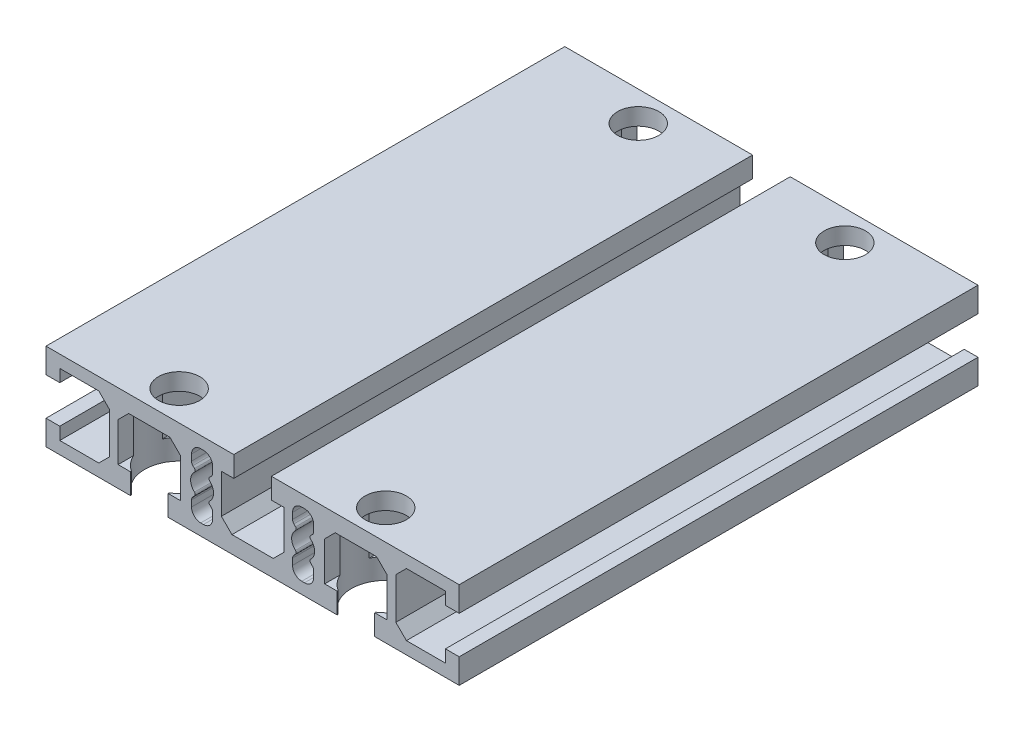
ISO-10303-21;
HEADER;
FILE_DESCRIPTION(('STEP AP214'),'2;1');
FILE_NAME('part.step','',(''),(''),'','','');
FILE_SCHEMA(('AUTOMOTIVE_DESIGN { 1 0 10303 214 1 1 1 1 }'));
ENDSEC;
DATA;
#1=APPLICATION_CONTEXT('core data for automotive mechanical design processes');
#2=APPLICATION_PROTOCOL_DEFINITION('international standard','automotive_design',2000,#1);
#3=PRODUCT_CONTEXT('',#1,'mechanical');
#4=PRODUCT('Part','Part','',(#3));
#5=PRODUCT_RELATED_PRODUCT_CATEGORY('part','',(#4));
#6=PRODUCT_DEFINITION_FORMATION('','',#4);
#7=PRODUCT_DEFINITION_CONTEXT('part definition',#1,'design');
#8=PRODUCT_DEFINITION('design','',#6,#7);
#9=PRODUCT_DEFINITION_SHAPE('','',#8);
#10=(LENGTH_UNIT() NAMED_UNIT(*) SI_UNIT(.MILLI.,.METRE.));
#11=(NAMED_UNIT(*) PLANE_ANGLE_UNIT() SI_UNIT($,.RADIAN.));
#12=(NAMED_UNIT(*) SI_UNIT($,.STERADIAN.) SOLID_ANGLE_UNIT());
#13=UNCERTAINTY_MEASURE_WITH_UNIT(LENGTH_MEASURE(1.E-05),#10,'distance_accuracy_value','');
#14=(GEOMETRIC_REPRESENTATION_CONTEXT(3) GLOBAL_UNCERTAINTY_ASSIGNED_CONTEXT((#13)) GLOBAL_UNIT_ASSIGNED_CONTEXT((#10,
#11,#12)) REPRESENTATION_CONTEXT('',''));
#15=CARTESIAN_POINT('',(0.,0.,0.));
#16=DIRECTION('',(0.,0.,1.));
#17=DIRECTION('',(1.,0.,0.));
#18=AXIS2_PLACEMENT_3D('',#15,#16,#17);
#19=CARTESIAN_POINT('',(-15.6999999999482,-5.,-56.5));
#20=DIRECTION('',(0.,1.,0.));
#21=DIRECTION('',(0.,0.,1.));
#22=AXIS2_PLACEMENT_3D('',#19,#20,#21);
#23=PLANE('',#22);
#24=CARTESIAN_POINT('',(-22.5,-5.,50.));
#25=DIRECTION('',(0.,1.,0.));
#26=DIRECTION('',(0.,0.,1.));
#27=AXIS2_PLACEMENT_3D('',#24,#25,#26);
#28=CIRCLE('',#27,7.5);
#29=CARTESIAN_POINT('',(-18.3999999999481,-5.,56.2801273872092));
#30=VERTEX_POINT('',#29);
#31=CARTESIAN_POINT('',(-15.6999999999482,-5.,53.1638584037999));
#32=VERTEX_POINT('',#31);
#33=EDGE_CURVE('E3168',#30,#32,#28,.T.);
#34=ORIENTED_EDGE('',*,*,#33,.F.);
#35=DIRECTION('',(0.,0.,1.));
#36=VECTOR('',#35,1.);
#37=CARTESIAN_POINT('',(-18.3999999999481,-5.,-56.5));
#38=LINE('',#37,#36);
#39=CARTESIAN_POINT('',(-18.3999999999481,-5.,56.5));
#40=VERTEX_POINT('',#39);
#41=EDGE_CURVE('E2050',#30,#40,#38,.T.);
#42=ORIENTED_EDGE('',*,*,#41,.T.);
#43=DIRECTION('',(-1.,0.,0.));
#44=VECTOR('',#43,1.);
#45=CARTESIAN_POINT('',(-15.6999999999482,-5.,56.5));
#46=LINE('',#45,#44);
#47=CARTESIAN_POINT('',(-15.6999999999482,-5.,56.5));
#48=VERTEX_POINT('',#47);
#49=EDGE_CURVE('E2085',#48,#40,#46,.T.);
#50=ORIENTED_EDGE('',*,*,#49,.F.);
#51=DIRECTION('',(0.,0.,1.));
#52=VECTOR('',#51,1.);
#53=CARTESIAN_POINT('',(-15.6999999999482,-5.,-56.5));
#54=LINE('',#53,#52);
#55=EDGE_CURVE('E2054',#32,#48,#54,.T.);
#56=ORIENTED_EDGE('',*,*,#55,.F.);
#57=EDGE_LOOP('',(#34,#42,#50,#56));
#58=FACE_BOUND('',#57,.T.);
#59=ADVANCED_FACE('F971',(#58),#23,.T.);
#60=CARTESIAN_POINT('',(-17.9999999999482,5.8,-56.5));
#61=DIRECTION('',(-0.707106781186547,-0.707106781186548,0.));
#62=DIRECTION('',(0.707106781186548,-0.707106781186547,0.));
#63=AXIS2_PLACEMENT_3D('',#60,#61,#62);
#64=PLANE('',#63);
#65=CARTESIAN_POINT('',(-22.5,10.3000000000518,50.));
#66=DIRECTION('',(-0.707106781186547,-0.707106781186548,0.));
#67=DIRECTION('',(0.707106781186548,-0.707106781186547,0.));
#68=AXIS2_PLACEMENT_3D('',#65,#66,#67);
#69=ELLIPSE('',#68,10.6066017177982,7.5);
#70=CARTESIAN_POINT('',(-15.6999999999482,3.5,53.1638584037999));
#71=VERTEX_POINT('',#70);
#72=CARTESIAN_POINT('',(-17.9999999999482,5.79999999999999,55.9999999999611));
#73=VERTEX_POINT('',#72);
#74=EDGE_CURVE('E1847',#71,#73,#69,.T.);
#75=ORIENTED_EDGE('',*,*,#74,.F.);
#76=DIRECTION('',(0.,0.,1.));
#77=VECTOR('',#76,1.);
#78=CARTESIAN_POINT('',(-15.6999999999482,3.5,-56.5));
#79=LINE('',#78,#77);
#80=CARTESIAN_POINT('',(-15.6999999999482,3.5,56.5));
#81=VERTEX_POINT('',#80);
#82=EDGE_CURVE('E1874',#71,#81,#79,.T.);
#83=ORIENTED_EDGE('',*,*,#82,.T.);
#84=DIRECTION('',(0.707106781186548,-0.707106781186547,0.));
#85=VECTOR('',#84,1.);
#86=CARTESIAN_POINT('',(-17.9999999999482,5.8,56.5));
#87=LINE('',#86,#85);
#88=CARTESIAN_POINT('',(-17.9999999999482,5.8,56.5));
#89=VERTEX_POINT('',#88);
#90=EDGE_CURVE('E2073',#89,#81,#87,.T.);
#91=ORIENTED_EDGE('',*,*,#90,.F.);
#92=DIRECTION('',(0.,0.,1.));
#93=VECTOR('',#92,1.);
#94=CARTESIAN_POINT('',(-17.9999999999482,5.8,-56.5));
#95=LINE('',#94,#93);
#96=EDGE_CURVE('E1872',#73,#89,#95,.T.);
#97=ORIENTED_EDGE('',*,*,#96,.F.);
#98=EDGE_LOOP('',(#75,#83,#91,#97));
#99=FACE_BOUND('',#98,.T.);
#100=ADVANCED_FACE('F2072',(#99),#64,.T.);
#101=CARTESIAN_POINT('',(-29.2999999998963,-5.00000000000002,-56.5));
#102=DIRECTION('',(1.,0.,0.));
#103=DIRECTION('',(0.,0.,-1.));
#104=AXIS2_PLACEMENT_3D('',#101,#102,#103);
#105=PLANE('',#104);
#106=DIRECTION('',(0.,-1.,0.));
#107=VECTOR('',#106,1.);
#108=CARTESIAN_POINT('',(-29.2999999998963,-9.50000000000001,53.163858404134));
#109=LINE('',#108,#107);
#110=CARTESIAN_POINT('',(-29.2999999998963,3.50000000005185,53.163858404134));
#111=VERTEX_POINT('',#110);
#112=CARTESIAN_POINT('',(-29.2999999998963,-5.00000000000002,53.163858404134));
#113=VERTEX_POINT('',#112);
#114=EDGE_CURVE('E3150',#111,#113,#109,.T.);
#115=ORIENTED_EDGE('',*,*,#114,.F.);
#116=DIRECTION('',(0.,0.,1.));
#117=VECTOR('',#116,1.);
#118=CARTESIAN_POINT('',(-29.2999999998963,3.50000000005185,-56.5));
#119=LINE('',#118,#117);
#120=CARTESIAN_POINT('',(-29.2999999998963,3.50000000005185,56.5));
#121=VERTEX_POINT('',#120);
#122=EDGE_CURVE('E1888',#111,#121,#119,.T.);
#123=ORIENTED_EDGE('',*,*,#122,.T.);
#124=DIRECTION('',(0.,1.,0.));
#125=VECTOR('',#124,1.);
#126=CARTESIAN_POINT('',(-29.2999999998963,-5.00000000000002,56.5));
#127=LINE('',#126,#125);
#128=CARTESIAN_POINT('',(-29.2999999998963,-5.00000000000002,56.5));
#129=VERTEX_POINT('',#128);
#130=EDGE_CURVE('E2981',#129,#121,#127,.T.);
#131=ORIENTED_EDGE('',*,*,#130,.F.);
#132=DIRECTION('',(0.,0.,1.));
#133=VECTOR('',#132,1.);
#134=CARTESIAN_POINT('',(-29.2999999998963,-5.00000000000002,-56.5));
#135=LINE('',#134,#133);
#136=EDGE_CURVE('E1893',#113,#129,#135,.T.);
#137=ORIENTED_EDGE('',*,*,#136,.F.);
#138=EDGE_LOOP('',(#115,#123,#131,#137));
#139=FACE_BOUND('',#138,.T.);
#140=ADVANCED_FACE('F3101',(#139),#105,.T.);
#141=CARTESIAN_POINT('',(-26.6,-5.00000000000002,-56.5));
#142=DIRECTION('',(0.,1.,0.));
#143=DIRECTION('',(-1.,0.,0.));
#144=AXIS2_PLACEMENT_3D('',#141,#142,#143);
#145=PLANE('',#144);
#146=CARTESIAN_POINT('',(-22.5,-5.00000000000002,50.));
#147=DIRECTION('',(0.,1.,0.));
#148=DIRECTION('',(-1.,0.,0.));
#149=AXIS2_PLACEMENT_3D('',#146,#147,#148);
#150=CIRCLE('',#149,7.5);
#151=CARTESIAN_POINT('',(-26.6,-5.00000000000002,56.280127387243));
#152=VERTEX_POINT('',#151);
#153=EDGE_CURVE('E3152',#113,#152,#150,.T.);
#154=ORIENTED_EDGE('',*,*,#153,.F.);
#155=ORIENTED_EDGE('',*,*,#136,.T.);
#156=DIRECTION('',(-1.,0.,0.));
#157=VECTOR('',#156,1.);
#158=CARTESIAN_POINT('',(-26.6,-5.00000000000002,56.5));
#159=LINE('',#158,#157);
#160=CARTESIAN_POINT('',(-26.6,-5.00000000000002,56.5));
#161=VERTEX_POINT('',#160);
#162=EDGE_CURVE('E2978',#161,#129,#159,.T.);
#163=ORIENTED_EDGE('',*,*,#162,.F.);
#164=DIRECTION('',(0.,0.,1.));
#165=VECTOR('',#164,1.);
#166=CARTESIAN_POINT('',(-26.6,-5.00000000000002,-56.5));
#167=LINE('',#166,#165);
#168=EDGE_CURVE('E1898',#152,#161,#167,.T.);
#169=ORIENTED_EDGE('',*,*,#168,.F.);
#170=EDGE_LOOP('',(#154,#155,#163,#169));
#171=FACE_BOUND('',#170,.T.);
#172=ADVANCED_FACE('F3202',(#171),#145,.T.);
#173=CARTESIAN_POINT('',(-26.6,-9.50000000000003,-56.5));
#174=DIRECTION('',(1.,0.,0.));
#175=DIRECTION('',(0.,0.,-1.));
#176=AXIS2_PLACEMENT_3D('',#173,#174,#175);
#177=PLANE('',#176);
#178=DIRECTION('',(0.,-1.,0.));
#179=VECTOR('',#178,1.);
#180=CARTESIAN_POINT('',(-26.6,-9.50000000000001,56.280127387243));
#181=LINE('',#180,#179);
#182=CARTESIAN_POINT('',(-26.6,-9.50000000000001,56.280127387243));
#183=VERTEX_POINT('',#182);
#184=EDGE_CURVE('E3157',#152,#183,#181,.T.);
#185=ORIENTED_EDGE('',*,*,#184,.F.);
#186=ORIENTED_EDGE('',*,*,#168,.T.);
#187=DIRECTION('',(0.,1.,0.));
#188=VECTOR('',#187,1.);
#189=CARTESIAN_POINT('',(-26.6,-9.50000000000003,56.5));
#190=LINE('',#189,#188);
#191=CARTESIAN_POINT('',(-26.6,-9.50000000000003,56.5));
#192=VERTEX_POINT('',#191);
#193=EDGE_CURVE('E2975',#192,#161,#190,.T.);
#194=ORIENTED_EDGE('',*,*,#193,.F.);
#195=DIRECTION('',(0.,0.,1.));
#196=VECTOR('',#195,1.);
#197=CARTESIAN_POINT('',(-26.6,-9.50000000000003,-56.5));
#198=LINE('',#197,#196);
#199=EDGE_CURVE('E1903',#183,#192,#198,.T.);
#200=ORIENTED_EDGE('',*,*,#199,.F.);
#201=EDGE_LOOP('',(#185,#186,#194,#200));
#202=FACE_BOUND('',#201,.T.);
#203=ADVANCED_FACE('F3125',(#202),#177,.T.);
#204=CARTESIAN_POINT('',(-18.3999999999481,-5.,-56.5));
#205=DIRECTION('',(-1.,0.,0.));
#206=DIRECTION('',(0.,0.,1.));
#207=AXIS2_PLACEMENT_3D('',#204,#205,#206);
#208=PLANE('',#207);
#209=DIRECTION('',(0.,-1.,0.));
#210=VECTOR('',#209,1.);
#211=CARTESIAN_POINT('',(-18.3999999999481,-9.50000000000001,43.7198726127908));
#212=LINE('',#211,#210);
#213=CARTESIAN_POINT('',(-18.3999999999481,-5.,43.7198726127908));
#214=VERTEX_POINT('',#213);
#215=CARTESIAN_POINT('',(-18.3999999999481,-9.50000000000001,43.7198726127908));
#216=VERTEX_POINT('',#215);
#217=EDGE_CURVE('E3173',#214,#216,#212,.T.);
#218=ORIENTED_EDGE('',*,*,#217,.F.);
#219=CARTESIAN_POINT('',(-18.3999999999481,-5.,-43.7198726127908));
#220=VERTEX_POINT('',#219);
#221=EDGE_CURVE('E2049',#220,#214,#38,.T.);
#222=ORIENTED_EDGE('',*,*,#221,.F.);
#223=DIRECTION('',(0.,-1.,0.));
#224=VECTOR('',#223,1.);
#225=CARTESIAN_POINT('',(-18.3999999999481,-9.50000000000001,-43.7198726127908));
#226=LINE('',#225,#224);
#227=CARTESIAN_POINT('',(-18.3999999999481,-9.50000000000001,-43.7198726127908));
#228=VERTEX_POINT('',#227);
#229=EDGE_CURVE('E2702',#228,#220,#226,.F.);
#230=ORIENTED_EDGE('',*,*,#229,.F.);
#231=DIRECTION('',(0.,0.,1.));
#232=VECTOR('',#231,1.);
#233=CARTESIAN_POINT('',(-18.3999999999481,-9.50000000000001,-56.5));
#234=LINE('',#233,#232);
#235=EDGE_CURVE('E2045',#228,#216,#234,.T.);
#236=ORIENTED_EDGE('',*,*,#235,.T.);
#237=EDGE_LOOP('',(#218,#222,#230,#236));
#238=FACE_BOUND('',#237,.T.);
#239=ADVANCED_FACE('F3118',(#238),#208,.T.);
#240=CARTESIAN_POINT('',(-15.6999999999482,3.5,-56.5));
#241=DIRECTION('',(-1.,0.,0.));
#242=DIRECTION('',(0.,0.,1.));
#243=AXIS2_PLACEMENT_3D('',#240,#241,#242);
#244=PLANE('',#243);
#245=DIRECTION('',(0.,-1.,0.));
#246=VECTOR('',#245,1.);
#247=CARTESIAN_POINT('',(-15.6999999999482,-9.50000000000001,46.8361415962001));
#248=LINE('',#247,#246);
#249=CARTESIAN_POINT('',(-15.6999999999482,3.5,46.8361415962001));
#250=VERTEX_POINT('',#249);
#251=CARTESIAN_POINT('',(-15.6999999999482,-5.,46.8361415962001));
#252=VERTEX_POINT('',#251);
#253=EDGE_CURVE('E1864',#250,#252,#248,.T.);
#254=ORIENTED_EDGE('',*,*,#253,.F.);
#255=CARTESIAN_POINT('',(-15.6999999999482,3.5,-46.8361415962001));
#256=VERTEX_POINT('',#255);
#257=EDGE_CURVE('E1862',#256,#250,#79,.T.);
#258=ORIENTED_EDGE('',*,*,#257,.F.);
#259=DIRECTION('',(0.,-1.,0.));
#260=VECTOR('',#259,1.);
#261=CARTESIAN_POINT('',(-15.6999999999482,-9.50000000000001,-46.8361415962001));
#262=LINE('',#261,#260);
#263=CARTESIAN_POINT('',(-15.6999999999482,-5.,-46.8361415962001));
#264=VERTEX_POINT('',#263);
#265=EDGE_CURVE('E2703',#264,#256,#262,.F.);
#266=ORIENTED_EDGE('',*,*,#265,.F.);
#267=EDGE_CURVE('E2053',#264,#252,#54,.T.);
#268=ORIENTED_EDGE('',*,*,#267,.T.);
#269=EDGE_LOOP('',(#254,#258,#266,#268));
#270=FACE_BOUND('',#269,.T.);
#271=ADVANCED_FACE('F3116',(#270),#244,.T.);
#272=CARTESIAN_POINT('',(-29.2999999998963,3.50000000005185,-56.5));
#273=DIRECTION('',(0.707106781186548,-0.707106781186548,0.));
#274=DIRECTION('',(0.707106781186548,0.707106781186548,0.));
#275=AXIS2_PLACEMENT_3D('',#272,#273,#274);
#276=PLANE('',#275);
#277=CARTESIAN_POINT('',(-22.5,10.2999999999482,50.));
#278=DIRECTION('',(0.707106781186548,-0.707106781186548,0.));
#279=DIRECTION('',(-0.707106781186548,-0.707106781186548,0.));
#280=AXIS2_PLACEMENT_3D('',#277,#278,#279);
#281=ELLIPSE('',#280,10.6066017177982,7.5);
#282=CARTESIAN_POINT('',(-29.2999999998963,3.50000000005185,46.8361415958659));
#283=VERTEX_POINT('',#282);
#284=CARTESIAN_POINT('',(-26.9999999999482,5.79999999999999,43.9999999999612));
#285=VERTEX_POINT('',#284);
#286=EDGE_CURVE('E2999',#283,#285,#281,.T.);
#287=ORIENTED_EDGE('',*,*,#286,.F.);
#288=CARTESIAN_POINT('',(-29.2999999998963,3.50000000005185,-46.836141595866));
#289=VERTEX_POINT('',#288);
#290=EDGE_CURVE('E1887',#289,#283,#119,.T.);
#291=ORIENTED_EDGE('',*,*,#290,.F.);
#292=CARTESIAN_POINT('',(-22.5,10.2999999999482,-50.));
#293=DIRECTION('',(0.707106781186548,-0.707106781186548,0.));
#294=DIRECTION('',(-0.707106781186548,-0.707106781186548,0.));
#295=AXIS2_PLACEMENT_3D('',#292,#293,#294);
#296=ELLIPSE('',#295,10.6066017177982,7.5);
#297=CARTESIAN_POINT('',(-26.9999999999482,5.79999999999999,-43.9999999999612));
#298=VERTEX_POINT('',#297);
#299=EDGE_CURVE('E3001',#298,#289,#296,.T.);
#300=ORIENTED_EDGE('',*,*,#299,.F.);
#301=DIRECTION('',(0.,0.,1.));
#302=VECTOR('',#301,1.);
#303=CARTESIAN_POINT('',(-26.9999999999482,5.8,-56.5));
#304=LINE('',#303,#302);
#305=EDGE_CURVE('E1882',#298,#285,#304,.T.);
#306=ORIENTED_EDGE('',*,*,#305,.T.);
#307=EDGE_LOOP('',(#287,#291,#300,#306));
#308=FACE_BOUND('',#307,.T.);
#309=ADVANCED_FACE('F2997',(#308),#276,.T.);
#310=DIRECTION('',(0.,-1.,0.));
#311=VECTOR('',#310,1.);
#312=CARTESIAN_POINT('',(-18.3999999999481,-9.50000000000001,-56.2801273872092));
#313=LINE('',#312,#311);
#314=CARTESIAN_POINT('',(-18.3999999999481,-5.,-56.2801273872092));
#315=VERTEX_POINT('',#314);
#316=CARTESIAN_POINT('',(-18.3999999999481,-9.50000000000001,-56.2801273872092));
#317=VERTEX_POINT('',#316);
#318=EDGE_CURVE('E2687',#315,#317,#313,.T.);
#319=ORIENTED_EDGE('',*,*,#318,.F.);
#320=CARTESIAN_POINT('',(-18.3999999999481,-5.,-56.5));
#321=VERTEX_POINT('',#320);
#322=EDGE_CURVE('E2047',#321,#315,#38,.T.);
#323=ORIENTED_EDGE('',*,*,#322,.F.);
#324=DIRECTION('',(0.,-1.,0.));
#325=VECTOR('',#324,1.);
#326=CARTESIAN_POINT('',(-18.3999999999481,-5.,-56.5));
#327=LINE('',#326,#325);
#328=CARTESIAN_POINT('',(-18.3999999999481,-9.50000000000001,-56.5));
#329=VERTEX_POINT('',#328);
#330=EDGE_CURVE('E2461',#321,#329,#327,.T.);
#331=ORIENTED_EDGE('',*,*,#330,.T.);
#332=EDGE_CURVE('E2042',#329,#317,#234,.T.);
#333=ORIENTED_EDGE('',*,*,#332,.T.);
#334=EDGE_LOOP('',(#319,#323,#331,#333));
#335=FACE_BOUND('',#334,.T.);
#336=ADVANCED_FACE('F2686',(#335),#208,.T.);
#337=EDGE_CURVE('E1863',#252,#214,#28,.T.);
#338=ORIENTED_EDGE('',*,*,#337,.F.);
#339=ORIENTED_EDGE('',*,*,#267,.F.);
#340=CARTESIAN_POINT('',(-22.5,-5.,-50.));
#341=DIRECTION('',(0.,1.,0.));
#342=DIRECTION('',(0.,0.,1.));
#343=AXIS2_PLACEMENT_3D('',#340,#341,#342);
#344=CIRCLE('',#343,7.5);
#345=EDGE_CURVE('E2697',#220,#264,#344,.T.);
#346=ORIENTED_EDGE('',*,*,#345,.F.);
#347=ORIENTED_EDGE('',*,*,#221,.T.);
#348=EDGE_LOOP('',(#338,#339,#346,#347));
#349=FACE_BOUND('',#348,.T.);
#350=ADVANCED_FACE('F3097',(#349),#23,.T.);
#351=DIRECTION('',(0.,-1.,0.));
#352=VECTOR('',#351,1.);
#353=CARTESIAN_POINT('',(-15.6999999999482,-9.50000000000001,-53.1638584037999));
#354=LINE('',#353,#352);
#355=CARTESIAN_POINT('',(-15.6999999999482,3.5,-53.1638584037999));
#356=VERTEX_POINT('',#355);
#357=CARTESIAN_POINT('',(-15.6999999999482,-5.,-53.1638584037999));
#358=VERTEX_POINT('',#357);
#359=EDGE_CURVE('E2695',#356,#358,#354,.T.);
#360=ORIENTED_EDGE('',*,*,#359,.F.);
#361=CARTESIAN_POINT('',(-15.6999999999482,3.5,-56.5));
#362=VERTEX_POINT('',#361);
#363=EDGE_CURVE('E1878',#362,#356,#79,.T.);
#364=ORIENTED_EDGE('',*,*,#363,.F.);
#365=DIRECTION('',(0.,-1.,0.));
#366=VECTOR('',#365,1.);
#367=CARTESIAN_POINT('',(-15.6999999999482,3.5,-56.5));
#368=LINE('',#367,#366);
#369=CARTESIAN_POINT('',(-15.6999999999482,-5.,-56.5));
#370=VERTEX_POINT('',#369);
#371=EDGE_CURVE('E2456',#362,#370,#368,.T.);
#372=ORIENTED_EDGE('',*,*,#371,.T.);
#373=EDGE_CURVE('E2051',#370,#358,#54,.T.);
#374=ORIENTED_EDGE('',*,*,#373,.T.);
#375=EDGE_LOOP('',(#360,#364,#372,#374));
#376=FACE_BOUND('',#375,.T.);
#377=ADVANCED_FACE('F3108',(#376),#244,.T.);
#378=CARTESIAN_POINT('',(-17.9999999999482,5.79999999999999,44.0000000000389));
#379=VERTEX_POINT('',#378);
#380=EDGE_CURVE('E1844',#379,#250,#69,.T.);
#381=ORIENTED_EDGE('',*,*,#380,.F.);
#382=CARTESIAN_POINT('',(-17.9999999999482,5.79999999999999,-44.0000000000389));
#383=VERTEX_POINT('',#382);
#384=EDGE_CURVE('E1860',#383,#379,#95,.T.);
#385=ORIENTED_EDGE('',*,*,#384,.F.);
#386=CARTESIAN_POINT('',(-22.5,10.3000000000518,-50.));
#387=DIRECTION('',(-0.707106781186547,-0.707106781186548,0.));
#388=DIRECTION('',(0.707106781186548,-0.707106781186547,0.));
#389=AXIS2_PLACEMENT_3D('',#386,#387,#388);
#390=ELLIPSE('',#389,10.6066017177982,7.5);
#391=EDGE_CURVE('E2698',#256,#383,#390,.T.);
#392=ORIENTED_EDGE('',*,*,#391,.F.);
#393=ORIENTED_EDGE('',*,*,#257,.T.);
#394=EDGE_LOOP('',(#381,#385,#392,#393));
#395=FACE_BOUND('',#394,.T.);
#396=ADVANCED_FACE('F1858',(#395),#64,.T.);
#397=CARTESIAN_POINT('',(-29.2999999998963,3.50000000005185,-53.163858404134));
#398=VERTEX_POINT('',#397);
#399=CARTESIAN_POINT('',(-26.9999999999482,5.79999999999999,-56.0000000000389));
#400=VERTEX_POINT('',#399);
#401=EDGE_CURVE('E3009',#398,#400,#296,.T.);
#402=ORIENTED_EDGE('',*,*,#401,.F.);
#403=CARTESIAN_POINT('',(-29.2999999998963,3.50000000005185,-56.5));
#404=VERTEX_POINT('',#403);
#405=EDGE_CURVE('E1884',#404,#398,#119,.T.);
#406=ORIENTED_EDGE('',*,*,#405,.F.);
#407=DIRECTION('',(0.707106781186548,0.707106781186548,0.));
#408=VECTOR('',#407,1.);
#409=CARTESIAN_POINT('',(-29.2999999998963,3.50000000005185,-56.5));
#410=LINE('',#409,#408);
#411=CARTESIAN_POINT('',(-26.9999999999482,5.8,-56.5));
#412=VERTEX_POINT('',#411);
#413=EDGE_CURVE('E2449',#404,#412,#410,.T.);
#414=ORIENTED_EDGE('',*,*,#413,.T.);
#415=EDGE_CURVE('E1875',#412,#400,#304,.T.);
#416=ORIENTED_EDGE('',*,*,#415,.T.);
#417=EDGE_LOOP('',(#402,#406,#414,#416));
#418=FACE_BOUND('',#417,.T.);
#419=ADVANCED_FACE('F3008',(#418),#276,.T.);
#420=DIRECTION('',(0.,-1.,0.));
#421=VECTOR('',#420,1.);
#422=CARTESIAN_POINT('',(-29.2999999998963,-9.50000000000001,46.836141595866));
#423=LINE('',#422,#421);
#424=CARTESIAN_POINT('',(-29.2999999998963,-5.00000000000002,46.836141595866));
#425=VERTEX_POINT('',#424);
#426=EDGE_CURVE('E3156',#425,#283,#423,.F.);
#427=ORIENTED_EDGE('',*,*,#426,.F.);
#428=CARTESIAN_POINT('',(-29.2999999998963,-5.00000000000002,-46.836141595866));
#429=VERTEX_POINT('',#428);
#430=EDGE_CURVE('E1892',#429,#425,#135,.T.);
#431=ORIENTED_EDGE('',*,*,#430,.F.);
#432=DIRECTION('',(0.,-1.,0.));
#433=VECTOR('',#432,1.);
#434=CARTESIAN_POINT('',(-29.2999999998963,-9.50000000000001,-46.836141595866));
#435=LINE('',#434,#433);
#436=EDGE_CURVE('E3188',#289,#429,#435,.T.);
#437=ORIENTED_EDGE('',*,*,#436,.F.);
#438=ORIENTED_EDGE('',*,*,#290,.T.);
#439=EDGE_LOOP('',(#427,#431,#437,#438));
#440=FACE_BOUND('',#439,.T.);
#441=ADVANCED_FACE('F3140',(#440),#105,.T.);
#442=CARTESIAN_POINT('',(-26.6,-5.00000000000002,43.719872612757));
#443=VERTEX_POINT('',#442);
#444=EDGE_CURVE('E3158',#443,#425,#150,.T.);
#445=ORIENTED_EDGE('',*,*,#444,.F.);
#446=CARTESIAN_POINT('',(-26.6,-5.00000000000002,-43.719872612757));
#447=VERTEX_POINT('',#446);
#448=EDGE_CURVE('E1897',#447,#443,#167,.T.);
#449=ORIENTED_EDGE('',*,*,#448,.F.);
#450=CARTESIAN_POINT('',(-22.5,-5.00000000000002,-50.));
#451=DIRECTION('',(0.,1.,0.));
#452=DIRECTION('',(-1.,0.,0.));
#453=AXIS2_PLACEMENT_3D('',#450,#451,#452);
#454=CIRCLE('',#453,7.5);
#455=EDGE_CURVE('E3184',#429,#447,#454,.T.);
#456=ORIENTED_EDGE('',*,*,#455,.F.);
#457=ORIENTED_EDGE('',*,*,#430,.T.);
#458=EDGE_LOOP('',(#445,#449,#456,#457));
#459=FACE_BOUND('',#458,.T.);
#460=ADVANCED_FACE('F3213',(#459),#145,.T.);
#461=DIRECTION('',(0.,-1.,0.));
#462=VECTOR('',#461,1.);
#463=CARTESIAN_POINT('',(-26.6,-9.50000000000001,43.719872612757));
#464=LINE('',#463,#462);
#465=CARTESIAN_POINT('',(-26.6,-9.50000000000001,43.719872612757));
#466=VERTEX_POINT('',#465);
#467=EDGE_CURVE('E3164',#466,#443,#464,.F.);
#468=ORIENTED_EDGE('',*,*,#467,.F.);
#469=CARTESIAN_POINT('',(-26.6,-9.50000000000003,-43.719872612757));
#470=VERTEX_POINT('',#469);
#471=EDGE_CURVE('E1902',#470,#466,#198,.T.);
#472=ORIENTED_EDGE('',*,*,#471,.F.);
#473=DIRECTION('',(0.,-1.,0.));
#474=VECTOR('',#473,1.);
#475=CARTESIAN_POINT('',(-26.6,-9.50000000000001,-43.719872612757));
#476=LINE('',#475,#474);
#477=EDGE_CURVE('E987',#447,#470,#476,.T.);
#478=ORIENTED_EDGE('',*,*,#477,.F.);
#479=ORIENTED_EDGE('',*,*,#448,.T.);
#480=EDGE_LOOP('',(#468,#472,#478,#479));
#481=FACE_BOUND('',#480,.T.);
#482=ADVANCED_FACE('F3210',(#481),#177,.T.);
#483=CARTESIAN_POINT('',(26.6000000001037,-4.99999999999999,-56.5));
#484=DIRECTION('',(-1.,0.,0.));
#485=DIRECTION('',(0.,0.,1.));
#486=AXIS2_PLACEMENT_3D('',#483,#484,#485);
#487=PLANE('',#486);
#488=DIRECTION('',(0.,-1.,0.));
#489=VECTOR('',#488,1.);
#490=CARTESIAN_POINT('',(26.6000000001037,-9.50000000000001,-56.280127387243));
#491=LINE('',#490,#489);
#492=CARTESIAN_POINT('',(26.6000000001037,-4.99999999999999,-56.280127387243));
#493=VERTEX_POINT('',#492);
#494=CARTESIAN_POINT('',(26.6000000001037,-9.50000000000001,-56.280127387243));
#495=VERTEX_POINT('',#494);
#496=EDGE_CURVE('E2637',#493,#495,#491,.T.);
#497=ORIENTED_EDGE('',*,*,#496,.F.);
#498=DIRECTION('',(0.,0.,1.));
#499=VECTOR('',#498,1.);
#500=CARTESIAN_POINT('',(26.6000000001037,-4.99999999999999,-56.5));
#501=LINE('',#500,#499);
#502=CARTESIAN_POINT('',(26.6000000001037,-4.99999999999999,-56.5));
#503=VERTEX_POINT('',#502);
#504=EDGE_CURVE('E1997',#503,#493,#501,.T.);
#505=ORIENTED_EDGE('',*,*,#504,.F.);
#506=DIRECTION('',(0.,-1.,0.));
#507=VECTOR('',#506,1.);
#508=CARTESIAN_POINT('',(26.6000000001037,-4.99999999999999,-56.5));
#509=LINE('',#508,#507);
#510=CARTESIAN_POINT('',(26.6000000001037,-9.49999999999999,-56.5));
#511=VERTEX_POINT('',#510);
#512=EDGE_CURVE('E2490',#503,#511,#509,.T.);
#513=ORIENTED_EDGE('',*,*,#512,.T.);
#514=DIRECTION('',(0.,0.,1.));
#515=VECTOR('',#514,1.);
#516=CARTESIAN_POINT('',(26.6000000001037,-9.49999999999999,-56.5));
#517=LINE('',#516,#515);
#518=EDGE_CURVE('E1992',#511,#495,#517,.T.);
#519=ORIENTED_EDGE('',*,*,#518,.T.);
#520=EDGE_LOOP('',(#497,#505,#513,#519));
#521=FACE_BOUND('',#520,.T.);
#522=ADVANCED_FACE('F2636',(#521),#487,.T.);
#523=CARTESIAN_POINT('',(29.3000000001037,3.50000000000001,-56.5));
#524=DIRECTION('',(-1.,0.,0.));
#525=DIRECTION('',(0.,0.,1.));
#526=AXIS2_PLACEMENT_3D('',#523,#524,#525);
#527=PLANE('',#526);
#528=DIRECTION('',(0.,-1.,0.));
#529=VECTOR('',#528,1.);
#530=CARTESIAN_POINT('',(29.3000000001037,-9.50000000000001,-53.1638584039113));
#531=LINE('',#530,#529);
#532=CARTESIAN_POINT('',(29.3000000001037,3.50000000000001,-53.1638584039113));
#533=VERTEX_POINT('',#532);
#534=CARTESIAN_POINT('',(29.3000000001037,-4.99999999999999,-53.1638584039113));
#535=VERTEX_POINT('',#534);
#536=EDGE_CURVE('E2647',#533,#535,#531,.T.);
#537=ORIENTED_EDGE('',*,*,#536,.F.);
#538=DIRECTION('',(0.,0.,1.));
#539=VECTOR('',#538,1.);
#540=CARTESIAN_POINT('',(29.3000000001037,3.50000000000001,-56.5));
#541=LINE('',#540,#539);
#542=CARTESIAN_POINT('',(29.3000000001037,3.50000000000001,-56.5));
#543=VERTEX_POINT('',#542);
#544=EDGE_CURVE('E2007',#543,#533,#541,.T.);
#545=ORIENTED_EDGE('',*,*,#544,.F.);
#546=DIRECTION('',(0.,-1.,0.));
#547=VECTOR('',#546,1.);
#548=CARTESIAN_POINT('',(29.3000000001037,3.50000000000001,-56.5));
#549=LINE('',#548,#547);
#550=CARTESIAN_POINT('',(29.3000000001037,-4.99999999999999,-56.5));
#551=VERTEX_POINT('',#550);
#552=EDGE_CURVE('E2484',#543,#551,#549,.T.);
#553=ORIENTED_EDGE('',*,*,#552,.T.);
#554=DIRECTION('',(0.,0.,1.));
#555=VECTOR('',#554,1.);
#556=CARTESIAN_POINT('',(29.3000000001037,-4.99999999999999,-56.5));
#557=LINE('',#556,#555);
#558=EDGE_CURVE('E2002',#551,#535,#557,.T.);
#559=ORIENTED_EDGE('',*,*,#558,.T.);
#560=EDGE_LOOP('',(#537,#545,#553,#559));
#561=FACE_BOUND('',#560,.T.);
#562=ADVANCED_FACE('F2646',(#561),#527,.T.);
#563=CARTESIAN_POINT('',(15.7000000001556,3.50000000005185,-56.5));
#564=DIRECTION('',(0.707106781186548,-0.707106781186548,0.));
#565=DIRECTION('',(0.707106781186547,0.707106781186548,0.));
#566=AXIS2_PLACEMENT_3D('',#563,#564,#565);
#567=PLANE('',#566);
#568=CARTESIAN_POINT('',(22.5000000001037,10.3,-50.));
#569=DIRECTION('',(0.707106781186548,-0.707106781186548,0.));
#570=DIRECTION('',(-0.707106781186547,-0.707106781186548,0.));
#571=AXIS2_PLACEMENT_3D('',#568,#569,#570);
#572=ELLIPSE('',#571,10.6066017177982,7.49999999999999);
#573=CARTESIAN_POINT('',(15.7000000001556,3.50000000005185,-53.1638584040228));
#574=VERTEX_POINT('',#573);
#575=CARTESIAN_POINT('',(18.0000000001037,5.79999999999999,-56.));
#576=VERTEX_POINT('',#575);
#577=EDGE_CURVE('E2660',#574,#576,#572,.T.);
#578=ORIENTED_EDGE('',*,*,#577,.F.);
#579=DIRECTION('',(0.,0.,1.));
#580=VECTOR('',#579,1.);
#581=CARTESIAN_POINT('',(15.7000000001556,3.50000000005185,-56.5));
#582=LINE('',#581,#580);
#583=CARTESIAN_POINT('',(15.7000000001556,3.50000000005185,-56.5));
#584=VERTEX_POINT('',#583);
#585=EDGE_CURVE('E2022',#584,#574,#582,.T.);
#586=ORIENTED_EDGE('',*,*,#585,.F.);
#587=DIRECTION('',(0.707106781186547,0.707106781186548,0.));
#588=VECTOR('',#587,1.);
#589=CARTESIAN_POINT('',(15.7000000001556,3.50000000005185,-56.5));
#590=LINE('',#589,#588);
#591=CARTESIAN_POINT('',(18.0000000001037,5.79999999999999,-56.5));
#592=VERTEX_POINT('',#591);
#593=EDGE_CURVE('E2476',#584,#592,#590,.T.);
#594=ORIENTED_EDGE('',*,*,#593,.T.);
#595=DIRECTION('',(0.,0.,1.));
#596=VECTOR('',#595,1.);
#597=CARTESIAN_POINT('',(18.0000000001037,5.79999999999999,-56.5));
#598=LINE('',#597,#596);
#599=EDGE_CURVE('E2017',#592,#576,#598,.T.);
#600=ORIENTED_EDGE('',*,*,#599,.T.);
#601=EDGE_LOOP('',(#578,#586,#594,#600));
#602=FACE_BOUND('',#601,.T.);
#603=ADVANCED_FACE('F2659',(#602),#567,.T.);
#604=CARTESIAN_POINT('',(18.4000000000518,-5.,-56.5));
#605=DIRECTION('',(0.,1.,0.));
#606=DIRECTION('',(0.,0.,1.));
#607=AXIS2_PLACEMENT_3D('',#604,#605,#606);
#608=PLANE('',#607);
#609=CARTESIAN_POINT('',(22.5000000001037,-5.,-50.));
#610=DIRECTION('',(0.,1.,0.));
#611=DIRECTION('',(0.,0.,1.));
#612=AXIS2_PLACEMENT_3D('',#609,#610,#611);
#613=CIRCLE('',#612,7.49999999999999);
#614=CARTESIAN_POINT('',(18.4000000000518,-5.,-56.2801273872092));
#615=VERTEX_POINT('',#614);
#616=CARTESIAN_POINT('',(15.7000000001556,-5.,-53.1638584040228));
#617=VERTEX_POINT('',#616);
#618=EDGE_CURVE('E2670',#615,#617,#613,.T.);
#619=ORIENTED_EDGE('',*,*,#618,.F.);
#620=DIRECTION('',(0.,0.,1.));
#621=VECTOR('',#620,1.);
#622=CARTESIAN_POINT('',(18.4000000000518,-5.,-56.5));
#623=LINE('',#622,#621);
#624=CARTESIAN_POINT('',(18.4000000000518,-5.,-56.5));
#625=VERTEX_POINT('',#624);
#626=EDGE_CURVE('E2032',#625,#615,#623,.T.);
#627=ORIENTED_EDGE('',*,*,#626,.F.);
#628=DIRECTION('',(-1.,0.,0.));
#629=VECTOR('',#628,1.);
#630=CARTESIAN_POINT('',(18.4000000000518,-5.,-56.5));
#631=LINE('',#630,#629);
#632=CARTESIAN_POINT('',(15.7000000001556,-5.,-56.5));
#633=VERTEX_POINT('',#632);
#634=EDGE_CURVE('E2470',#625,#633,#631,.T.);
#635=ORIENTED_EDGE('',*,*,#634,.T.);
#636=DIRECTION('',(0.,0.,1.));
#637=VECTOR('',#636,1.);
#638=CARTESIAN_POINT('',(15.7000000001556,-5.,-56.5));
#639=LINE('',#638,#637);
#640=EDGE_CURVE('E2027',#633,#617,#639,.T.);
#641=ORIENTED_EDGE('',*,*,#640,.T.);
#642=EDGE_LOOP('',(#619,#627,#635,#641));
#643=FACE_BOUND('',#642,.T.);
#644=ADVANCED_FACE('F2669',(#643),#608,.T.);
#645=CARTESIAN_POINT('',(29.3000000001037,-4.99999999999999,-56.5));
#646=DIRECTION('',(0.,1.,0.));
#647=DIRECTION('',(0.,0.,1.));
#648=AXIS2_PLACEMENT_3D('',#645,#646,#647);
#649=PLANE('',#648);
#650=CARTESIAN_POINT('',(22.5000000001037,-4.99999999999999,-50.));
#651=DIRECTION('',(0.,1.,0.));
#652=DIRECTION('',(0.,0.,1.));
#653=AXIS2_PLACEMENT_3D('',#650,#651,#652);
#654=CIRCLE('',#653,7.49999999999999);
#655=CARTESIAN_POINT('',(26.6000000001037,-4.99999999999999,-43.719872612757));
#656=VERTEX_POINT('',#655);
#657=CARTESIAN_POINT('',(29.3000000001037,-4.99999999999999,-46.8361415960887));
#658=VERTEX_POINT('',#657);
#659=EDGE_CURVE('E2736',#656,#658,#654,.T.);
#660=ORIENTED_EDGE('',*,*,#659,.F.);
#661=CARTESIAN_POINT('',(26.6000000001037,-4.99999999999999,43.719872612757));
#662=VERTEX_POINT('',#661);
#663=EDGE_CURVE('E2000',#656,#662,#501,.T.);
#664=ORIENTED_EDGE('',*,*,#663,.T.);
#665=CARTESIAN_POINT('',(22.5000000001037,-4.99999999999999,50.));
#666=DIRECTION('',(0.,1.,0.));
#667=DIRECTION('',(0.,0.,1.));
#668=AXIS2_PLACEMENT_3D('',#665,#666,#667);
#669=CIRCLE('',#668,7.49999999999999);
#670=CARTESIAN_POINT('',(29.3000000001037,-4.99999999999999,46.8361415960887));
#671=VERTEX_POINT('',#670);
#672=EDGE_CURVE('E2779',#671,#662,#669,.T.);
#673=ORIENTED_EDGE('',*,*,#672,.F.);
#674=EDGE_CURVE('E2005',#658,#671,#557,.T.);
#675=ORIENTED_EDGE('',*,*,#674,.F.);
#676=EDGE_LOOP('',(#660,#664,#673,#675));
#677=FACE_BOUND('',#676,.T.);
#678=ADVANCED_FACE('F3614',(#677),#649,.T.);
#679=CARTESIAN_POINT('',(27.0000000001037,5.79999999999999,-56.5));
#680=DIRECTION('',(-0.707106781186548,-0.707106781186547,0.));
#681=DIRECTION('',(0.707106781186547,-0.707106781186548,0.));
#682=AXIS2_PLACEMENT_3D('',#679,#680,#681);
#683=PLANE('',#682);
#684=CARTESIAN_POINT('',(22.5000000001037,10.3,-50.));
#685=DIRECTION('',(-0.707106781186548,-0.707106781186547,0.));
#686=DIRECTION('',(0.707106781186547,-0.707106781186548,0.));
#687=AXIS2_PLACEMENT_3D('',#684,#685,#686);
#688=ELLIPSE('',#687,10.6066017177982,7.49999999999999);
#689=CARTESIAN_POINT('',(29.3000000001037,3.50000000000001,-46.8361415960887));
#690=VERTEX_POINT('',#689);
#691=CARTESIAN_POINT('',(27.0000000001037,5.79999999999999,-44.));
#692=VERTEX_POINT('',#691);
#693=EDGE_CURVE('E2733',#690,#692,#688,.T.);
#694=ORIENTED_EDGE('',*,*,#693,.F.);
#695=CARTESIAN_POINT('',(29.3000000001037,3.50000000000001,46.8361415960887));
#696=VERTEX_POINT('',#695);
#697=EDGE_CURVE('E2010',#690,#696,#541,.T.);
#698=ORIENTED_EDGE('',*,*,#697,.T.);
#699=CARTESIAN_POINT('',(22.5000000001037,10.3,50.));
#700=DIRECTION('',(-0.707106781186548,-0.707106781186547,0.));
#701=DIRECTION('',(0.707106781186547,-0.707106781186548,0.));
#702=AXIS2_PLACEMENT_3D('',#699,#700,#701);
#703=ELLIPSE('',#702,10.6066017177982,7.49999999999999);
#704=CARTESIAN_POINT('',(27.0000000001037,5.79999999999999,44.));
#705=VERTEX_POINT('',#704);
#706=EDGE_CURVE('E2772',#705,#696,#703,.T.);
#707=ORIENTED_EDGE('',*,*,#706,.F.);
#708=DIRECTION('',(0.,0.,1.));
#709=VECTOR('',#708,1.);
#710=CARTESIAN_POINT('',(27.0000000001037,5.79999999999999,-56.5));
#711=LINE('',#710,#709);
#712=EDGE_CURVE('E2015',#692,#705,#711,.T.);
#713=ORIENTED_EDGE('',*,*,#712,.F.);
#714=EDGE_LOOP('',(#694,#698,#707,#713));
#715=FACE_BOUND('',#714,.T.);
#716=ADVANCED_FACE('F3550',(#715),#683,.T.);
#717=CARTESIAN_POINT('',(15.7000000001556,-5.,-56.5));
#718=DIRECTION('',(1.,0.,0.));
#719=DIRECTION('',(0.,0.,-1.));
#720=AXIS2_PLACEMENT_3D('',#717,#718,#719);
#721=PLANE('',#720);
#722=DIRECTION('',(0.,-1.,0.));
#723=VECTOR('',#722,1.);
#724=CARTESIAN_POINT('',(15.7000000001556,-9.50000000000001,-46.8361415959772));
#725=LINE('',#724,#723);
#726=CARTESIAN_POINT('',(15.7000000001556,3.50000000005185,-46.8361415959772));
#727=VERTEX_POINT('',#726);
#728=CARTESIAN_POINT('',(15.7000000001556,-5.,-46.8361415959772));
#729=VERTEX_POINT('',#728);
#730=EDGE_CURVE('E2730',#727,#729,#725,.T.);
#731=ORIENTED_EDGE('',*,*,#730,.F.);
#732=CARTESIAN_POINT('',(15.7000000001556,3.50000000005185,46.8361415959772));
#733=VERTEX_POINT('',#732);
#734=EDGE_CURVE('E2025',#727,#733,#582,.T.);
#735=ORIENTED_EDGE('',*,*,#734,.T.);
#736=DIRECTION('',(0.,-1.,0.));
#737=VECTOR('',#736,1.);
#738=CARTESIAN_POINT('',(15.7000000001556,-9.50000000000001,46.8361415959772));
#739=LINE('',#738,#737);
#740=CARTESIAN_POINT('',(15.7000000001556,-5.,46.8361415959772));
#741=VERTEX_POINT('',#740);
#742=EDGE_CURVE('E2761',#741,#733,#739,.F.);
#743=ORIENTED_EDGE('',*,*,#742,.F.);
#744=EDGE_CURVE('E2030',#729,#741,#639,.T.);
#745=ORIENTED_EDGE('',*,*,#744,.F.);
#746=EDGE_LOOP('',(#731,#735,#743,#745));
#747=FACE_BOUND('',#746,.T.);
#748=ADVANCED_FACE('F3540',(#747),#721,.T.);
#749=CARTESIAN_POINT('',(18.4000000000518,-9.50000000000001,-56.5));
#750=DIRECTION('',(1.,0.,0.));
#751=DIRECTION('',(0.,0.,-1.));
#752=AXIS2_PLACEMENT_3D('',#749,#750,#751);
#753=PLANE('',#752);
#754=DIRECTION('',(0.,-1.,0.));
#755=VECTOR('',#754,1.);
#756=CARTESIAN_POINT('',(18.4000000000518,-9.50000000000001,-43.7198726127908));
#757=LINE('',#756,#755);
#758=CARTESIAN_POINT('',(18.4000000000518,-5.,-43.7198726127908));
#759=VERTEX_POINT('',#758);
#760=CARTESIAN_POINT('',(18.4000000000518,-9.50000000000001,-43.7198726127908));
#761=VERTEX_POINT('',#760);
#762=EDGE_CURVE('E2727',#759,#761,#757,.T.);
#763=ORIENTED_EDGE('',*,*,#762,.F.);
#764=CARTESIAN_POINT('',(18.4000000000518,-5.,43.7198726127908));
#765=VERTEX_POINT('',#764);
#766=EDGE_CURVE('E2035',#759,#765,#623,.T.);
#767=ORIENTED_EDGE('',*,*,#766,.T.);
#768=DIRECTION('',(0.,-1.,0.));
#769=VECTOR('',#768,1.);
#770=CARTESIAN_POINT('',(18.4000000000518,-9.50000000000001,43.7198726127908));
#771=LINE('',#770,#769);
#772=CARTESIAN_POINT('',(18.4000000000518,-9.50000000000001,43.7198726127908));
#773=VERTEX_POINT('',#772);
#774=EDGE_CURVE('E2755',#773,#765,#771,.F.);
#775=ORIENTED_EDGE('',*,*,#774,.F.);
#776=DIRECTION('',(0.,0.,1.));
#777=VECTOR('',#776,1.);
#778=CARTESIAN_POINT('',(18.4000000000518,-9.50000000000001,-56.5));
#779=LINE('',#778,#777);
#780=EDGE_CURVE('E2040',#761,#773,#779,.T.);
#781=ORIENTED_EDGE('',*,*,#780,.F.);
#782=EDGE_LOOP('',(#763,#767,#775,#781));
#783=FACE_BOUND('',#782,.T.);
#784=ADVANCED_FACE('F3467',(#783),#753,.T.);
#785=DIRECTION('',(0.,-1.,0.));
#786=VECTOR('',#785,1.);
#787=CARTESIAN_POINT('',(26.6000000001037,-9.50000000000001,-43.719872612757));
#788=LINE('',#787,#786);
#789=CARTESIAN_POINT('',(26.6000000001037,-9.50000000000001,-43.719872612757));
#790=VERTEX_POINT('',#789);
#791=EDGE_CURVE('E2740',#790,#656,#788,.F.);
#792=ORIENTED_EDGE('',*,*,#791,.F.);
#793=CARTESIAN_POINT('',(26.6000000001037,-9.50000000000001,43.719872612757));
#794=VERTEX_POINT('',#793);
#795=EDGE_CURVE('E1995',#790,#794,#517,.T.);
#796=ORIENTED_EDGE('',*,*,#795,.T.);
#797=DIRECTION('',(0.,-1.,0.));
#798=VECTOR('',#797,1.);
#799=CARTESIAN_POINT('',(26.6000000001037,-9.50000000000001,43.719872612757));
#800=LINE('',#799,#798);
#801=EDGE_CURVE('E2782',#662,#794,#800,.T.);
#802=ORIENTED_EDGE('',*,*,#801,.F.);
#803=ORIENTED_EDGE('',*,*,#663,.F.);
#804=EDGE_LOOP('',(#792,#796,#802,#803));
#805=FACE_BOUND('',#804,.T.);
#806=ADVANCED_FACE('F3539',(#805),#487,.T.);
#807=CARTESIAN_POINT('',(26.6000000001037,-4.99999999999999,56.280127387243));
#808=VERTEX_POINT('',#807);
#809=CARTESIAN_POINT('',(29.3000000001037,-4.99999999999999,53.1638584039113));
#810=VERTEX_POINT('',#809);
#811=EDGE_CURVE('E2783',#808,#810,#669,.T.);
#812=ORIENTED_EDGE('',*,*,#811,.F.);
#813=CARTESIAN_POINT('',(26.6000000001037,-4.99999999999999,56.5));
#814=VERTEX_POINT('',#813);
#815=EDGE_CURVE('E2001',#808,#814,#501,.T.);
#816=ORIENTED_EDGE('',*,*,#815,.T.);
#817=DIRECTION('',(-1.,0.,0.));
#818=VECTOR('',#817,1.);
#819=CARTESIAN_POINT('',(29.3000000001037,-4.99999999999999,56.5));
#820=LINE('',#819,#818);
#821=CARTESIAN_POINT('',(29.3000000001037,-4.99999999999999,56.5));
#822=VERTEX_POINT('',#821);
#823=EDGE_CURVE('E2116',#822,#814,#820,.T.);
#824=ORIENTED_EDGE('',*,*,#823,.F.);
#825=EDGE_CURVE('E2006',#810,#822,#557,.T.);
#826=ORIENTED_EDGE('',*,*,#825,.F.);
#827=EDGE_LOOP('',(#812,#816,#824,#826));
#828=FACE_BOUND('',#827,.T.);
#829=ADVANCED_FACE('F3546',(#828),#649,.T.);
#830=DIRECTION('',(0.,-1.,0.));
#831=VECTOR('',#830,1.);
#832=CARTESIAN_POINT('',(29.3000000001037,-9.50000000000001,-46.8361415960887));
#833=LINE('',#832,#831);
#834=EDGE_CURVE('E2738',#658,#690,#833,.F.);
#835=ORIENTED_EDGE('',*,*,#834,.F.);
#836=ORIENTED_EDGE('',*,*,#674,.T.);
#837=DIRECTION('',(0.,-1.,0.));
#838=VECTOR('',#837,1.);
#839=CARTESIAN_POINT('',(29.3000000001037,-9.50000000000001,46.8361415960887));
#840=LINE('',#839,#838);
#841=EDGE_CURVE('E2775',#696,#671,#840,.T.);
#842=ORIENTED_EDGE('',*,*,#841,.F.);
#843=ORIENTED_EDGE('',*,*,#697,.F.);
#844=EDGE_LOOP('',(#835,#836,#842,#843));
#845=FACE_BOUND('',#844,.T.);
#846=ADVANCED_FACE('F3606',(#845),#527,.T.);
#847=CARTESIAN_POINT('',(29.3000000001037,3.50000000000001,53.1638584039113));
#848=VERTEX_POINT('',#847);
#849=CARTESIAN_POINT('',(27.0000000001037,5.79999999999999,56.));
#850=VERTEX_POINT('',#849);
#851=EDGE_CURVE('E2776',#848,#850,#703,.T.);
#852=ORIENTED_EDGE('',*,*,#851,.F.);
#853=CARTESIAN_POINT('',(29.3000000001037,3.50000000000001,56.5));
#854=VERTEX_POINT('',#853);
#855=EDGE_CURVE('E2011',#848,#854,#541,.T.);
#856=ORIENTED_EDGE('',*,*,#855,.T.);
#857=DIRECTION('',(0.707106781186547,-0.707106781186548,0.));
#858=VECTOR('',#857,1.);
#859=CARTESIAN_POINT('',(27.0000000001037,5.79999999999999,56.5));
#860=LINE('',#859,#858);
#861=CARTESIAN_POINT('',(27.0000000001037,5.79999999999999,56.5));
#862=VERTEX_POINT('',#861);
#863=EDGE_CURVE('E2110',#862,#854,#860,.T.);
#864=ORIENTED_EDGE('',*,*,#863,.F.);
#865=EDGE_CURVE('E2016',#850,#862,#711,.T.);
#866=ORIENTED_EDGE('',*,*,#865,.F.);
#867=EDGE_LOOP('',(#852,#856,#864,#866));
#868=FACE_BOUND('',#867,.T.);
#869=ADVANCED_FACE('F3592',(#868),#683,.T.);
#870=CARTESIAN_POINT('',(18.0000000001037,5.79999999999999,-44.));
#871=VERTEX_POINT('',#870);
#872=EDGE_CURVE('E2728',#871,#727,#572,.T.);
#873=ORIENTED_EDGE('',*,*,#872,.F.);
#874=CARTESIAN_POINT('',(18.0000000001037,5.79999999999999,44.));
#875=VERTEX_POINT('',#874);
#876=EDGE_CURVE('E2020',#871,#875,#598,.T.);
#877=ORIENTED_EDGE('',*,*,#876,.T.);
#878=CARTESIAN_POINT('',(22.5000000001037,10.3,50.));
#879=DIRECTION('',(0.707106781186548,-0.707106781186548,0.));
#880=DIRECTION('',(-0.707106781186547,-0.707106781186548,0.));
#881=AXIS2_PLACEMENT_3D('',#878,#879,#880);
#882=ELLIPSE('',#881,10.6066017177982,7.49999999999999);
#883=EDGE_CURVE('E2765',#733,#875,#882,.T.);
#884=ORIENTED_EDGE('',*,*,#883,.F.);
#885=ORIENTED_EDGE('',*,*,#734,.F.);
#886=EDGE_LOOP('',(#873,#877,#884,#885));
#887=FACE_BOUND('',#886,.T.);
#888=ADVANCED_FACE('F4267',(#887),#567,.T.);
#889=DIRECTION('',(0.,-1.,0.));
#890=VECTOR('',#889,1.);
#891=CARTESIAN_POINT('',(15.7000000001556,-9.50000000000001,53.1638584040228));
#892=LINE('',#891,#890);
#893=CARTESIAN_POINT('',(15.7000000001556,3.50000000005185,53.1638584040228));
#894=VERTEX_POINT('',#893);
#895=CARTESIAN_POINT('',(15.7000000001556,-5.,53.1638584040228));
#896=VERTEX_POINT('',#895);
#897=EDGE_CURVE('E2770',#894,#896,#892,.T.);
#898=ORIENTED_EDGE('',*,*,#897,.F.);
#899=CARTESIAN_POINT('',(15.7000000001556,3.50000000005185,56.5));
#900=VERTEX_POINT('',#899);
#901=EDGE_CURVE('E2026',#894,#900,#582,.T.);
#902=ORIENTED_EDGE('',*,*,#901,.T.);
#903=DIRECTION('',(0.,1.,0.));
#904=VECTOR('',#903,1.);
#905=CARTESIAN_POINT('',(15.7000000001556,-5.,56.5));
#906=LINE('',#905,#904);
#907=CARTESIAN_POINT('',(15.7000000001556,-5.,56.5));
#908=VERTEX_POINT('',#907);
#909=EDGE_CURVE('E2102',#908,#900,#906,.T.);
#910=ORIENTED_EDGE('',*,*,#909,.F.);
#911=EDGE_CURVE('E2031',#896,#908,#639,.T.);
#912=ORIENTED_EDGE('',*,*,#911,.F.);
#913=EDGE_LOOP('',(#898,#902,#910,#912));
#914=FACE_BOUND('',#913,.T.);
#915=ADVANCED_FACE('F3533',(#914),#721,.T.);
#916=EDGE_CURVE('E2724',#729,#759,#613,.T.);
#917=ORIENTED_EDGE('',*,*,#916,.F.);
#918=ORIENTED_EDGE('',*,*,#744,.T.);
#919=CARTESIAN_POINT('',(22.5000000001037,-5.,50.));
#920=DIRECTION('',(0.,1.,0.));
#921=DIRECTION('',(0.,0.,1.));
#922=AXIS2_PLACEMENT_3D('',#919,#920,#921);
#923=CIRCLE('',#922,7.49999999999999);
#924=EDGE_CURVE('E2758',#765,#741,#923,.T.);
#925=ORIENTED_EDGE('',*,*,#924,.F.);
#926=ORIENTED_EDGE('',*,*,#766,.F.);
#927=EDGE_LOOP('',(#917,#918,#925,#926));
#928=FACE_BOUND('',#927,.T.);
#929=ADVANCED_FACE('F3464',(#928),#608,.T.);
#930=DIRECTION('',(0.,-1.,0.));
#931=VECTOR('',#930,1.);
#932=CARTESIAN_POINT('',(18.4000000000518,-9.50000000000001,56.2801273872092));
#933=LINE('',#932,#931);
#934=CARTESIAN_POINT('',(18.4000000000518,-5.,56.2801273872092));
#935=VERTEX_POINT('',#934);
#936=CARTESIAN_POINT('',(18.4000000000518,-9.50000000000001,56.2801273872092));
#937=VERTEX_POINT('',#936);
#938=EDGE_CURVE('E995',#935,#937,#933,.T.);
#939=ORIENTED_EDGE('',*,*,#938,.F.);
#940=CARTESIAN_POINT('',(18.4000000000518,-5.,56.5));
#941=VERTEX_POINT('',#940);
#942=EDGE_CURVE('E2036',#935,#941,#623,.T.);
#943=ORIENTED_EDGE('',*,*,#942,.T.);
#944=DIRECTION('',(0.,1.,0.));
#945=VECTOR('',#944,1.);
#946=CARTESIAN_POINT('',(18.4000000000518,-9.50000000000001,56.5));
#947=LINE('',#946,#945);
#948=CARTESIAN_POINT('',(18.4000000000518,-9.50000000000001,56.5));
#949=VERTEX_POINT('',#948);
#950=EDGE_CURVE('E2096',#949,#941,#947,.T.);
#951=ORIENTED_EDGE('',*,*,#950,.F.);
#952=EDGE_CURVE('E2041',#937,#949,#779,.T.);
#953=ORIENTED_EDGE('',*,*,#952,.F.);
#954=EDGE_LOOP('',(#939,#943,#951,#953));
#955=FACE_BOUND('',#954,.T.);
#956=ADVANCED_FACE('F3458',(#955),#753,.T.);
#957=CARTESIAN_POINT('',(0.,0.,-56.5));
#958=DIRECTION('',(0.,0.,1.));
#959=DIRECTION('',(1.,0.,0.));
#960=AXIS2_PLACEMENT_3D('',#957,#958,#959);
#961=PLANE('',#960);
#962=DIRECTION('',(0.,1.,0.));
#963=VECTOR('',#962,1.);
#964=CARTESIAN_POINT('',(-13.2999707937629,-4.99997510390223,-56.5));
#965=LINE('',#964,#963);
#966=CARTESIAN_POINT('',(-13.2999707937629,-4.99997510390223,-56.5));
#967=VERTEX_POINT('',#966);
#968=CARTESIAN_POINT('',(-13.2999707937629,-3.65737373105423,-56.5));
#969=VERTEX_POINT('',#968);
#970=EDGE_CURVE('E2292',#967,#969,#965,.T.);
#971=ORIENTED_EDGE('',*,*,#970,.F.);
#972=CARTESIAN_POINT('',(-11.2999707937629,-4.99997510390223,-56.5));
#973=DIRECTION('',(0.,0.,1.));
#974=DIRECTION('',(1.,0.,0.));
#975=AXIS2_PLACEMENT_3D('',#972,#973,#974);
#976=CIRCLE('',#975,2.);
#977=CARTESIAN_POINT('',(-11.2999707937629,-6.99997510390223,-56.5));
#978=VERTEX_POINT('',#977);
#979=EDGE_CURVE('E2348',#967,#978,#976,.T.);
#980=ORIENTED_EDGE('',*,*,#979,.T.);
#981=DIRECTION('',(-1.,0.,0.));
#982=VECTOR('',#981,1.);
#983=CARTESIAN_POINT('',(-10.6999707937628,-6.99997510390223,-56.5));
#984=LINE('',#983,#982);
#985=CARTESIAN_POINT('',(-10.6999707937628,-6.99997510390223,-56.5));
#986=VERTEX_POINT('',#985);
#987=EDGE_CURVE('E2345',#986,#978,#984,.T.);
#988=ORIENTED_EDGE('',*,*,#987,.F.);
#989=CARTESIAN_POINT('',(-10.6999707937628,-4.99997510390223,-56.5));
#990=DIRECTION('',(0.,0.,1.));
#991=DIRECTION('',(1.,0.,0.));
#992=AXIS2_PLACEMENT_3D('',#989,#990,#991);
#993=CIRCLE('',#992,2.);
#994=CARTESIAN_POINT('',(-8.69997079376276,-4.99997510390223,-56.5));
#995=VERTEX_POINT('',#994);
#996=EDGE_CURVE('E2342',#986,#995,#993,.T.);
#997=ORIENTED_EDGE('',*,*,#996,.T.);
#998=DIRECTION('',(0.,-1.,0.));
#999=VECTOR('',#998,1.);
#1000=CARTESIAN_POINT('',(-8.69997079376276,-3.65737373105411,-56.5));
#1001=LINE('',#1000,#999);
#1002=CARTESIAN_POINT('',(-8.69997079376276,-3.65737373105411,-56.5));
#1003=VERTEX_POINT('',#1002);
#1004=EDGE_CURVE('E2340',#1003,#995,#1001,.T.);
#1005=ORIENTED_EDGE('',*,*,#1004,.F.);
#1006=CARTESIAN_POINT('',(-9.69997079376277,-3.65737373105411,-56.5));
#1007=DIRECTION('',(0.,0.,1.));
#1008=DIRECTION('',(1.,0.,0.));
#1009=AXIS2_PLACEMENT_3D('',#1006,#1007,#1008);
#1010=CIRCLE('',#1009,1.00000000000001);
#1011=CARTESIAN_POINT('',(-8.99286401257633,-2.95026694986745,-56.5));
#1012=VERTEX_POINT('',#1011);
#1013=EDGE_CURVE('E2337',#1003,#1012,#1010,.T.);
#1014=ORIENTED_EDGE('',*,*,#1013,.T.);
#1015=DIRECTION('',(0.707106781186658,-0.707106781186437,0.));
#1016=VECTOR('',#1015,1.);
#1017=CARTESIAN_POINT('',(-9.35352418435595,-2.58960677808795,-56.5));
#1018=LINE('',#1017,#1016);
#1019=CARTESIAN_POINT('',(-9.35352418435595,-2.58960677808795,-56.5));
#1020=VERTEX_POINT('',#1019);
#1021=EDGE_CURVE('E2335',#1020,#1012,#1018,.T.);
#1022=ORIENTED_EDGE('',*,*,#1021,.F.);
#1023=CARTESIAN_POINT('',(-8.99997079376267,-2.23605338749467,-56.5));
#1024=DIRECTION('',(0.,0.,1.));
#1025=DIRECTION('',(1.,0.,0.));
#1026=AXIS2_PLACEMENT_3D('',#1023,#1024,#1025);
#1027=CIRCLE('',#1026,0.500000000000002);
#1028=CARTESIAN_POINT('',(-9.33330412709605,-1.86337539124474,-56.5));
#1029=VERTEX_POINT('',#1028);
#1030=EDGE_CURVE('E2333',#1029,#1020,#1027,.T.);
#1031=ORIENTED_EDGE('',*,*,#1030,.F.);
#1032=CARTESIAN_POINT('',(-10.9999707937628,1.45900051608E-05,-56.5));
#1033=DIRECTION('',(0.,0.,1.));
#1034=DIRECTION('',(1.,0.,0.));
#1035=AXIS2_PLACEMENT_3D('',#1032,#1033,#1034);
#1036=CIRCLE('',#1035,2.50000000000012);
#1037=CARTESIAN_POINT('',(-9.33330412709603,1.86340457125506,-56.5));
#1038=VERTEX_POINT('',#1037);
#1039=EDGE_CURVE('E2330',#1029,#1038,#1036,.T.);
#1040=ORIENTED_EDGE('',*,*,#1039,.T.);
#1041=CARTESIAN_POINT('',(-8.99997079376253,2.23608256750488,-56.5));
#1042=DIRECTION('',(0.,0.,1.));
#1043=DIRECTION('',(1.,0.,0.));
#1044=AXIS2_PLACEMENT_3D('',#1041,#1042,#1043);
#1045=CIRCLE('',#1044,0.500000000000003);
#1046=CARTESIAN_POINT('',(-9.35352418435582,2.58963595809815,-56.5));
#1047=VERTEX_POINT('',#1046);
#1048=EDGE_CURVE('E2328',#1047,#1038,#1045,.T.);
#1049=ORIENTED_EDGE('',*,*,#1048,.F.);
#1050=DIRECTION('',(-0.707106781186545,-0.70710678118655,0.));
#1051=VECTOR('',#1050,1.);
#1052=CARTESIAN_POINT('',(-8.99286401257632,2.95029612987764,-56.5));
#1053=LINE('',#1052,#1051);
#1054=CARTESIAN_POINT('',(-8.99286401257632,2.95029612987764,-56.5));
#1055=VERTEX_POINT('',#1054);
#1056=EDGE_CURVE('E2326',#1055,#1047,#1053,.T.);
#1057=ORIENTED_EDGE('',*,*,#1056,.F.);
#1058=CARTESIAN_POINT('',(-9.69997079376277,3.65740291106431,-56.5));
#1059=DIRECTION('',(0.,0.,1.));
#1060=DIRECTION('',(1.,0.,0.));
#1061=AXIS2_PLACEMENT_3D('',#1058,#1059,#1060);
#1062=CIRCLE('',#1061,1.00000000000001);
#1063=CARTESIAN_POINT('',(-8.69997079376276,3.65740291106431,-56.5));
#1064=VERTEX_POINT('',#1063);
#1065=EDGE_CURVE('E2323',#1055,#1064,#1062,.T.);
#1066=ORIENTED_EDGE('',*,*,#1065,.T.);
#1067=DIRECTION('',(0.,-1.,0.));
#1068=VECTOR('',#1067,1.);
#1069=CARTESIAN_POINT('',(-8.69997079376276,5.0000042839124,-56.5));
#1070=LINE('',#1069,#1068);
#1071=CARTESIAN_POINT('',(-8.69997079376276,5.0000042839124,-56.5));
#1072=VERTEX_POINT('',#1071);
#1073=EDGE_CURVE('E2321',#1072,#1064,#1070,.T.);
#1074=ORIENTED_EDGE('',*,*,#1073,.F.);
#1075=CARTESIAN_POINT('',(-10.6999707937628,5.0000042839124,-56.5));
#1076=DIRECTION('',(0.,0.,1.));
#1077=DIRECTION('',(1.,0.,0.));
#1078=AXIS2_PLACEMENT_3D('',#1075,#1076,#1077);
#1079=CIRCLE('',#1078,2.);
#1080=CARTESIAN_POINT('',(-10.6999707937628,7.0000042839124,-56.5));
#1081=VERTEX_POINT('',#1080);
#1082=EDGE_CURVE('E2318',#1072,#1081,#1079,.T.);
#1083=ORIENTED_EDGE('',*,*,#1082,.T.);
#1084=DIRECTION('',(1.,0.,0.));
#1085=VECTOR('',#1084,1.);
#1086=CARTESIAN_POINT('',(-11.2999707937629,7.0000042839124,-56.5));
#1087=LINE('',#1086,#1085);
#1088=CARTESIAN_POINT('',(-11.2999707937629,7.0000042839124,-56.5));
#1089=VERTEX_POINT('',#1088);
#1090=EDGE_CURVE('E2316',#1089,#1081,#1087,.T.);
#1091=ORIENTED_EDGE('',*,*,#1090,.F.);
#1092=CARTESIAN_POINT('',(-11.2999707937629,5.0000042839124,-56.5));
#1093=DIRECTION('',(0.,0.,1.));
#1094=DIRECTION('',(1.,0.,0.));
#1095=AXIS2_PLACEMENT_3D('',#1092,#1093,#1094);
#1096=CIRCLE('',#1095,2.);
#1097=CARTESIAN_POINT('',(-13.2999707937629,5.0000042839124,-56.5));
#1098=VERTEX_POINT('',#1097);
#1099=EDGE_CURVE('E2313',#1089,#1098,#1096,.T.);
#1100=ORIENTED_EDGE('',*,*,#1099,.T.);
#1101=DIRECTION('',(0.,1.,0.));
#1102=VECTOR('',#1101,1.);
#1103=CARTESIAN_POINT('',(-13.2999707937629,3.65740291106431,-56.5));
#1104=LINE('',#1103,#1102);
#1105=CARTESIAN_POINT('',(-13.2999707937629,3.65740291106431,-56.5));
#1106=VERTEX_POINT('',#1105);
#1107=EDGE_CURVE('E2311',#1106,#1098,#1104,.T.);
#1108=ORIENTED_EDGE('',*,*,#1107,.F.);
#1109=CARTESIAN_POINT('',(-12.2999707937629,3.65740291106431,-56.5));
#1110=DIRECTION('',(0.,0.,1.));
#1111=DIRECTION('',(1.,0.,0.));
#1112=AXIS2_PLACEMENT_3D('',#1109,#1110,#1111);
#1113=CIRCLE('',#1112,0.999999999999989);
#1114=CARTESIAN_POINT('',(-13.0070775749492,2.95029612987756,-56.5));
#1115=VERTEX_POINT('',#1114);
#1116=EDGE_CURVE('E2308',#1106,#1115,#1113,.T.);
#1117=ORIENTED_EDGE('',*,*,#1116,.T.);
#1118=DIRECTION('',(-0.707106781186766,0.707106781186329,0.));
#1119=VECTOR('',#1118,1.);
#1120=CARTESIAN_POINT('',(-12.6464174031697,2.5896359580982,-56.5));
#1121=LINE('',#1120,#1119);
#1122=CARTESIAN_POINT('',(-12.6464174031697,2.5896359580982,-56.5));
#1123=VERTEX_POINT('',#1122);
#1124=EDGE_CURVE('E2306',#1123,#1115,#1121,.T.);
#1125=ORIENTED_EDGE('',*,*,#1124,.F.);
#1126=CARTESIAN_POINT('',(-12.9999707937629,2.23608256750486,-56.5));
#1127=DIRECTION('',(0.,0.,1.));
#1128=DIRECTION('',(1.,0.,0.));
#1129=AXIS2_PLACEMENT_3D('',#1126,#1127,#1128);
#1130=CIRCLE('',#1129,0.5);
#1131=CARTESIAN_POINT('',(-12.6666374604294,1.86340457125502,-56.5));
#1132=VERTEX_POINT('',#1131);
#1133=EDGE_CURVE('E2304',#1132,#1123,#1130,.T.);
#1134=ORIENTED_EDGE('',*,*,#1133,.F.);
#1135=CARTESIAN_POINT('',(-10.9999707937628,1.45900051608E-05,-56.5));
#1136=DIRECTION('',(0.,0.,1.));
#1137=DIRECTION('',(1.,0.,0.));
#1138=AXIS2_PLACEMENT_3D('',#1135,#1136,#1137);
#1139=CIRCLE('',#1138,2.5);
#1140=CARTESIAN_POINT('',(-12.6666374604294,-1.86337539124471,-56.5));
#1141=VERTEX_POINT('',#1140);
#1142=EDGE_CURVE('E2301',#1132,#1141,#1139,.T.);
#1143=ORIENTED_EDGE('',*,*,#1142,.T.);
#1144=CARTESIAN_POINT('',(-12.9999707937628,-2.23605338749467,-56.5));
#1145=DIRECTION('',(0.,0.,1.));
#1146=DIRECTION('',(1.,0.,0.));
#1147=AXIS2_PLACEMENT_3D('',#1144,#1145,#1146);
#1148=CIRCLE('',#1147,0.499999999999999);
#1149=CARTESIAN_POINT('',(-12.6464174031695,-2.58960677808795,-56.5));
#1150=VERTEX_POINT('',#1149);
#1151=EDGE_CURVE('E2299',#1150,#1141,#1148,.T.);
#1152=ORIENTED_EDGE('',*,*,#1151,.F.);
#1153=DIRECTION('',(0.707106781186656,0.707106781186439,0.));
#1154=VECTOR('',#1153,1.);
#1155=CARTESIAN_POINT('',(-13.0070775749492,-2.95026694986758,-56.5));
#1156=LINE('',#1155,#1154);
#1157=CARTESIAN_POINT('',(-13.0070775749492,-2.95026694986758,-56.5));
#1158=VERTEX_POINT('',#1157);
#1159=EDGE_CURVE('E2297',#1158,#1150,#1156,.T.);
#1160=ORIENTED_EDGE('',*,*,#1159,.F.);
#1161=CARTESIAN_POINT('',(-12.2999707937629,-3.65737373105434,-56.5));
#1162=DIRECTION('',(0.,0.,1.));
#1163=DIRECTION('',(1.,0.,0.));
#1164=AXIS2_PLACEMENT_3D('',#1161,#1162,#1163);
#1165=CIRCLE('',#1164,0.99999999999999);
#1166=EDGE_CURVE('E2294',#1158,#969,#1165,.T.);
#1167=ORIENTED_EDGE('',*,*,#1166,.T.);
#1168=EDGE_LOOP('',(#971,#980,#988,#997,#1005,#1014,#1022,#1031,#1040,#1049,#1057,#1066,#1074,
#1083,#1091,#1100,#1108,#1117,#1125,#1134,#1143,#1152,#1160,#1167));
#1169=FACE_BOUND('',#1168,.T.);
#1170=DIRECTION('',(0.,1.,0.));
#1171=VECTOR('',#1170,1.);
#1172=CARTESIAN_POINT('',(-4.09999999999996,5.00000000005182,-56.5));
#1173=LINE('',#1172,#1171);
#1174=CARTESIAN_POINT('',(-4.09999999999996,5.00000000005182,-56.5));
#1175=VERTEX_POINT('',#1174);
#1176=CARTESIAN_POINT('',(-4.09999999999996,9.50000000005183,-56.5));
#1177=VERTEX_POINT('',#1176);
#1178=EDGE_CURVE('E2399',#1175,#1177,#1173,.T.);
#1179=ORIENTED_EDGE('',*,*,#1178,.F.);
#1180=DIRECTION('',(1.,0.,0.));
#1181=VECTOR('',#1180,1.);
#1182=CARTESIAN_POINT('',(-6.80000000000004,5.00000000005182,-56.5));
#1183=LINE('',#1182,#1181);
#1184=CARTESIAN_POINT('',(-6.80000000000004,5.00000000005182,-56.5));
#1185=VERTEX_POINT('',#1184);
#1186=EDGE_CURVE('E1928',#1185,#1175,#1183,.T.);
#1187=ORIENTED_EDGE('',*,*,#1186,.F.);
#1188=DIRECTION('',(0.,1.,0.));
#1189=VECTOR('',#1188,1.);
#1190=CARTESIAN_POINT('',(-6.80000000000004,-3.49999999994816,-56.5));
#1191=LINE('',#1190,#1189);
#1192=CARTESIAN_POINT('',(-6.80000000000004,-3.49999999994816,-56.5));
#1193=VERTEX_POINT('',#1192);
#1194=EDGE_CURVE('E1934',#1193,#1185,#1191,.T.);
#1195=ORIENTED_EDGE('',*,*,#1194,.F.);
#1196=DIRECTION('',(-0.707106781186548,0.707106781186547,0.));
#1197=VECTOR('',#1196,1.);
#1198=CARTESIAN_POINT('',(-4.50000000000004,-5.79999999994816,-56.5));
#1199=LINE('',#1198,#1197);
#1200=CARTESIAN_POINT('',(-4.50000000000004,-5.79999999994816,-56.5));
#1201=VERTEX_POINT('',#1200);
#1202=EDGE_CURVE('E1939',#1201,#1193,#1199,.T.);
#1203=ORIENTED_EDGE('',*,*,#1202,.F.);
#1204=DIRECTION('',(-1.,0.,0.));
#1205=VECTOR('',#1204,1.);
#1206=CARTESIAN_POINT('',(4.49999999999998,-5.79999999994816,-56.5));
#1207=LINE('',#1206,#1205);
#1208=CARTESIAN_POINT('',(4.49999999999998,-5.79999999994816,-56.5));
#1209=VERTEX_POINT('',#1208);
#1210=EDGE_CURVE('E2544',#1209,#1201,#1207,.T.);
#1211=ORIENTED_EDGE('',*,*,#1210,.F.);
#1212=DIRECTION('',(-0.707106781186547,-0.707106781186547,0.));
#1213=VECTOR('',#1212,1.);
#1214=CARTESIAN_POINT('',(6.79999999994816,-3.49999999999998,-56.5));
#1215=LINE('',#1214,#1213);
#1216=CARTESIAN_POINT('',(6.79999999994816,-3.49999999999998,-56.5));
#1217=VERTEX_POINT('',#1216);
#1218=EDGE_CURVE('E2541',#1217,#1209,#1215,.T.);
#1219=ORIENTED_EDGE('',*,*,#1218,.F.);
#1220=DIRECTION('',(0.,-1.,0.));
#1221=VECTOR('',#1220,1.);
#1222=CARTESIAN_POINT('',(6.79999999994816,5.00000000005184,-56.5));
#1223=LINE('',#1222,#1221);
#1224=CARTESIAN_POINT('',(6.79999999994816,5.00000000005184,-56.5));
#1225=VERTEX_POINT('',#1224);
#1226=EDGE_CURVE('E2538',#1225,#1217,#1223,.T.);
#1227=ORIENTED_EDGE('',*,*,#1226,.F.);
#1228=DIRECTION('',(1.,0.,0.));
#1229=VECTOR('',#1228,1.);
#1230=CARTESIAN_POINT('',(4.10000000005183,5.00000000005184,-56.5));
#1231=LINE('',#1230,#1229);
#1232=CARTESIAN_POINT('',(4.10000000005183,5.00000000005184,-56.5));
#1233=VERTEX_POINT('',#1232);
#1234=EDGE_CURVE('E2535',#1233,#1225,#1231,.T.);
#1235=ORIENTED_EDGE('',*,*,#1234,.F.);
#1236=DIRECTION('',(0.,-1.,0.));
#1237=VECTOR('',#1236,1.);
#1238=CARTESIAN_POINT('',(4.10000000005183,9.50000000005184,-56.5));
#1239=LINE('',#1238,#1237);
#1240=CARTESIAN_POINT('',(4.10000000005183,9.50000000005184,-56.5));
#1241=VERTEX_POINT('',#1240);
#1242=EDGE_CURVE('E2532',#1241,#1233,#1239,.T.);
#1243=ORIENTED_EDGE('',*,*,#1242,.F.);
#1244=DIRECTION('',(-1.,0.,0.));
#1245=VECTOR('',#1244,1.);
#1246=CARTESIAN_POINT('',(45.0000000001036,9.50000000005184,-56.5));
#1247=LINE('',#1246,#1245);
#1248=CARTESIAN_POINT('',(45.0000000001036,9.50000000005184,-56.5));
#1249=VERTEX_POINT('',#1248);
#1250=EDGE_CURVE('E2529',#1249,#1241,#1247,.T.);
#1251=ORIENTED_EDGE('',*,*,#1250,.F.);
#1252=DIRECTION('',(0.,1.,0.));
#1253=VECTOR('',#1252,1.);
#1254=CARTESIAN_POINT('',(45.0000000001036,4.10000000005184,-56.5));
#1255=LINE('',#1254,#1253);
#1256=CARTESIAN_POINT('',(45.0000000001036,4.10000000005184,-56.5));
#1257=VERTEX_POINT('',#1256);
#1258=EDGE_CURVE('E2526',#1257,#1249,#1255,.T.);
#1259=ORIENTED_EDGE('',*,*,#1258,.F.);
#1260=DIRECTION('',(1.,0.,0.));
#1261=VECTOR('',#1260,1.);
#1262=CARTESIAN_POINT('',(42.0000000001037,4.10000000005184,-56.5));
#1263=LINE('',#1262,#1261);
#1264=CARTESIAN_POINT('',(42.0000000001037,4.10000000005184,-56.5));
#1265=VERTEX_POINT('',#1264);
#1266=EDGE_CURVE('E2523',#1265,#1257,#1263,.T.);
#1267=ORIENTED_EDGE('',*,*,#1266,.F.);
#1268=DIRECTION('',(0.,-1.,0.));
#1269=VECTOR('',#1268,1.);
#1270=CARTESIAN_POINT('',(42.0000000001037,6.80000000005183,-56.5));
#1271=LINE('',#1270,#1269);
#1272=CARTESIAN_POINT('',(42.0000000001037,6.80000000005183,-56.5));
#1273=VERTEX_POINT('',#1272);
#1274=EDGE_CURVE('E2520',#1273,#1265,#1271,.T.);
#1275=ORIENTED_EDGE('',*,*,#1274,.F.);
#1276=DIRECTION('',(1.,0.,0.));
#1277=VECTOR('',#1276,1.);
#1278=CARTESIAN_POINT('',(33.5000000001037,6.80000000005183,-56.5));
#1279=LINE('',#1278,#1277);
#1280=CARTESIAN_POINT('',(33.5000000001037,6.80000000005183,-56.5));
#1281=VERTEX_POINT('',#1280);
#1282=EDGE_CURVE('E2517',#1281,#1273,#1279,.T.);
#1283=ORIENTED_EDGE('',*,*,#1282,.F.);
#1284=DIRECTION('',(0.707106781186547,0.707106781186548,0.));
#1285=VECTOR('',#1284,1.);
#1286=CARTESIAN_POINT('',(31.2000000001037,4.50000000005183,-56.5));
#1287=LINE('',#1286,#1285);
#1288=CARTESIAN_POINT('',(31.2000000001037,4.50000000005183,-56.5));
#1289=VERTEX_POINT('',#1288);
#1290=EDGE_CURVE('E2514',#1289,#1281,#1287,.T.);
#1291=ORIENTED_EDGE('',*,*,#1290,.F.);
#1292=DIRECTION('',(0.,1.,0.));
#1293=VECTOR('',#1292,1.);
#1294=CARTESIAN_POINT('',(31.2000000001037,-4.49999999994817,-56.5));
#1295=LINE('',#1294,#1293);
#1296=CARTESIAN_POINT('',(31.2000000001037,-4.49999999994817,-56.5));
#1297=VERTEX_POINT('',#1296);
#1298=EDGE_CURVE('E2511',#1297,#1289,#1295,.T.);
#1299=ORIENTED_EDGE('',*,*,#1298,.F.);
#1300=DIRECTION('',(-0.707106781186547,0.707106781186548,0.));
#1301=VECTOR('',#1300,1.);
#1302=CARTESIAN_POINT('',(33.5000000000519,-6.79999999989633,-56.5));
#1303=LINE('',#1302,#1301);
#1304=CARTESIAN_POINT('',(33.5000000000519,-6.79999999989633,-56.5));
#1305=VERTEX_POINT('',#1304);
#1306=EDGE_CURVE('E2508',#1305,#1297,#1303,.T.);
#1307=ORIENTED_EDGE('',*,*,#1306,.F.);
#1308=DIRECTION('',(-1.,0.,0.));
#1309=VECTOR('',#1308,1.);
#1310=CARTESIAN_POINT('',(42.0000000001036,-6.79999999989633,-56.5));
#1311=LINE('',#1310,#1309);
#1312=CARTESIAN_POINT('',(42.0000000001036,-6.79999999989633,-56.5));
#1313=VERTEX_POINT('',#1312);
#1314=EDGE_CURVE('E2505',#1313,#1305,#1311,.T.);
#1315=ORIENTED_EDGE('',*,*,#1314,.F.);
#1316=DIRECTION('',(0.,-1.,0.));
#1317=VECTOR('',#1316,1.);
#1318=CARTESIAN_POINT('',(42.0000000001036,-4.1,-56.5));
#1319=LINE('',#1318,#1317);
#1320=CARTESIAN_POINT('',(42.0000000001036,-4.1,-56.5));
#1321=VERTEX_POINT('',#1320);
#1322=EDGE_CURVE('E2502',#1321,#1313,#1319,.T.);
#1323=ORIENTED_EDGE('',*,*,#1322,.F.);
#1324=DIRECTION('',(-1.,0.,0.));
#1325=VECTOR('',#1324,1.);
#1326=CARTESIAN_POINT('',(45.0000000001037,-4.1,-56.5));
#1327=LINE('',#1326,#1325);
#1328=CARTESIAN_POINT('',(45.0000000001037,-4.1,-56.5));
#1329=VERTEX_POINT('',#1328);
#1330=EDGE_CURVE('E2499',#1329,#1321,#1327,.T.);
#1331=ORIENTED_EDGE('',*,*,#1330,.F.);
#1332=DIRECTION('',(0.,1.,0.));
#1333=VECTOR('',#1332,1.);
#1334=CARTESIAN_POINT('',(45.0000000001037,-9.49999999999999,-56.5));
#1335=LINE('',#1334,#1333);
#1336=CARTESIAN_POINT('',(45.0000000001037,-9.49999999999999,-56.5));
#1337=VERTEX_POINT('',#1336);
#1338=EDGE_CURVE('E2496',#1337,#1329,#1335,.T.);
#1339=ORIENTED_EDGE('',*,*,#1338,.F.);
#1340=DIRECTION('',(1.,0.,0.));
#1341=VECTOR('',#1340,1.);
#1342=CARTESIAN_POINT('',(26.6000000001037,-9.49999999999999,-56.5));
#1343=LINE('',#1342,#1341);
#1344=EDGE_CURVE('E2493',#511,#1337,#1343,.T.);
#1345=ORIENTED_EDGE('',*,*,#1344,.F.);
#1346=ORIENTED_EDGE('',*,*,#512,.F.);
#1347=DIRECTION('',(-1.,0.,0.));
#1348=VECTOR('',#1347,1.);
#1349=CARTESIAN_POINT('',(29.3000000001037,-4.99999999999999,-56.5));
#1350=LINE('',#1349,#1348);
#1351=EDGE_CURVE('E2487',#551,#503,#1350,.T.);
#1352=ORIENTED_EDGE('',*,*,#1351,.F.);
#1353=ORIENTED_EDGE('',*,*,#552,.F.);
#1354=DIRECTION('',(0.707106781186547,-0.707106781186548,0.));
#1355=VECTOR('',#1354,1.);
#1356=CARTESIAN_POINT('',(27.0000000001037,5.79999999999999,-56.5));
#1357=LINE('',#1356,#1355);
#1358=CARTESIAN_POINT('',(27.0000000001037,5.79999999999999,-56.5));
#1359=VERTEX_POINT('',#1358);
#1360=EDGE_CURVE('E2481',#1359,#543,#1357,.T.);
#1361=ORIENTED_EDGE('',*,*,#1360,.F.);
#1362=DIRECTION('',(1.,0.,0.));
#1363=VECTOR('',#1362,1.);
#1364=CARTESIAN_POINT('',(18.0000000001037,5.79999999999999,-56.5));
#1365=LINE('',#1364,#1363);
#1366=EDGE_CURVE('E2479',#592,#1359,#1365,.T.);
#1367=ORIENTED_EDGE('',*,*,#1366,.F.);
#1368=ORIENTED_EDGE('',*,*,#593,.F.);
#1369=DIRECTION('',(0.,1.,0.));
#1370=VECTOR('',#1369,1.);
#1371=CARTESIAN_POINT('',(15.7000000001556,-5.,-56.5));
#1372=LINE('',#1371,#1370);
#1373=EDGE_CURVE('E2473',#633,#584,#1372,.T.);
#1374=ORIENTED_EDGE('',*,*,#1373,.F.);
#1375=ORIENTED_EDGE('',*,*,#634,.F.);
#1376=DIRECTION('',(0.,1.,0.));
#1377=VECTOR('',#1376,1.);
#1378=CARTESIAN_POINT('',(18.4000000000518,-9.50000000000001,-56.5));
#1379=LINE('',#1378,#1377);
#1380=CARTESIAN_POINT('',(18.4000000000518,-9.50000000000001,-56.5));
#1381=VERTEX_POINT('',#1380);
#1382=EDGE_CURVE('E2467',#1381,#625,#1379,.T.);
#1383=ORIENTED_EDGE('',*,*,#1382,.F.);
#1384=DIRECTION('',(1.,0.,0.));
#1385=VECTOR('',#1384,1.);
#1386=CARTESIAN_POINT('',(-18.3999999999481,-9.50000000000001,-56.5));
#1387=LINE('',#1386,#1385);
#1388=EDGE_CURVE('E2464',#329,#1381,#1387,.T.);
#1389=ORIENTED_EDGE('',*,*,#1388,.F.);
#1390=ORIENTED_EDGE('',*,*,#330,.F.);
#1391=DIRECTION('',(-1.,0.,0.));
#1392=VECTOR('',#1391,1.);
#1393=CARTESIAN_POINT('',(-15.6999999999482,-5.,-56.5));
#1394=LINE('',#1393,#1392);
#1395=EDGE_CURVE('E2458',#370,#321,#1394,.T.);
#1396=ORIENTED_EDGE('',*,*,#1395,.F.);
#1397=ORIENTED_EDGE('',*,*,#371,.F.);
#1398=DIRECTION('',(0.707106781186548,-0.707106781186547,0.));
#1399=VECTOR('',#1398,1.);
#1400=CARTESIAN_POINT('',(-17.9999999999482,5.8,-56.5));
#1401=LINE('',#1400,#1399);
#1402=CARTESIAN_POINT('',(-17.9999999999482,5.8,-56.5));
#1403=VERTEX_POINT('',#1402);
#1404=EDGE_CURVE('E2454',#1403,#362,#1401,.T.);
#1405=ORIENTED_EDGE('',*,*,#1404,.F.);
#1406=DIRECTION('',(1.,0.,0.));
#1407=VECTOR('',#1406,1.);
#1408=CARTESIAN_POINT('',(-26.9999999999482,5.8,-56.5));
#1409=LINE('',#1408,#1407);
#1410=EDGE_CURVE('E2452',#412,#1403,#1409,.T.);
#1411=ORIENTED_EDGE('',*,*,#1410,.F.);
#1412=ORIENTED_EDGE('',*,*,#413,.F.);
#1413=DIRECTION('',(0.,1.,0.));
#1414=VECTOR('',#1413,1.);
#1415=CARTESIAN_POINT('',(-29.2999999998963,-5.00000000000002,-56.5));
#1416=LINE('',#1415,#1414);
#1417=CARTESIAN_POINT('',(-29.2999999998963,-5.00000000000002,-56.5));
#1418=VERTEX_POINT('',#1417);
#1419=EDGE_CURVE('E2446',#1418,#404,#1416,.T.);
#1420=ORIENTED_EDGE('',*,*,#1419,.F.);
#1421=DIRECTION('',(-1.,0.,0.));
#1422=VECTOR('',#1421,1.);
#1423=CARTESIAN_POINT('',(-26.6,-5.00000000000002,-56.5));
#1424=LINE('',#1423,#1422);
#1425=CARTESIAN_POINT('',(-26.6,-5.00000000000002,-56.5));
#1426=VERTEX_POINT('',#1425);
#1427=EDGE_CURVE('E2443',#1426,#1418,#1424,.T.);
#1428=ORIENTED_EDGE('',*,*,#1427,.F.);
#1429=DIRECTION('',(0.,1.,0.));
#1430=VECTOR('',#1429,1.);
#1431=CARTESIAN_POINT('',(-26.6,-9.50000000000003,-56.5));
#1432=LINE('',#1431,#1430);
#1433=CARTESIAN_POINT('',(-26.6,-9.50000000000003,-56.5));
#1434=VERTEX_POINT('',#1433);
#1435=EDGE_CURVE('E2440',#1434,#1426,#1432,.T.);
#1436=ORIENTED_EDGE('',*,*,#1435,.F.);
#1437=DIRECTION('',(1.,0.,0.));
#1438=VECTOR('',#1437,1.);
#1439=CARTESIAN_POINT('',(-45.,-9.50000000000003,-56.5));
#1440=LINE('',#1439,#1438);
#1441=CARTESIAN_POINT('',(-45.,-9.50000000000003,-56.5));
#1442=VERTEX_POINT('',#1441);
#1443=EDGE_CURVE('E2437',#1442,#1434,#1440,.T.);
#1444=ORIENTED_EDGE('',*,*,#1443,.F.);
#1445=DIRECTION('',(0.,-1.,0.));
#1446=VECTOR('',#1445,1.);
#1447=CARTESIAN_POINT('',(-45.,-4.10000000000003,-56.5));
#1448=LINE('',#1447,#1446);
#1449=CARTESIAN_POINT('',(-45.,-4.10000000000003,-56.5));
#1450=VERTEX_POINT('',#1449);
#1451=EDGE_CURVE('E2434',#1450,#1442,#1448,.T.);
#1452=ORIENTED_EDGE('',*,*,#1451,.F.);
#1453=DIRECTION('',(-1.,0.,0.));
#1454=VECTOR('',#1453,1.);
#1455=CARTESIAN_POINT('',(-42.,-4.10000000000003,-56.5));
#1456=LINE('',#1455,#1454);
#1457=CARTESIAN_POINT('',(-42.,-4.10000000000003,-56.5));
#1458=VERTEX_POINT('',#1457);
#1459=EDGE_CURVE('E2431',#1458,#1450,#1456,.T.);
#1460=ORIENTED_EDGE('',*,*,#1459,.F.);
#1461=DIRECTION('',(0.,1.,0.));
#1462=VECTOR('',#1461,1.);
#1463=CARTESIAN_POINT('',(-42.,-6.8,-56.5));
#1464=LINE('',#1463,#1462);
#1465=CARTESIAN_POINT('',(-42.,-6.8,-56.5));
#1466=VERTEX_POINT('',#1465);
#1467=EDGE_CURVE('E2428',#1466,#1458,#1464,.T.);
#1468=ORIENTED_EDGE('',*,*,#1467,.F.);
#1469=DIRECTION('',(-1.,0.,0.));
#1470=VECTOR('',#1469,1.);
#1471=CARTESIAN_POINT('',(-33.5,-6.8,-56.5));
#1472=LINE('',#1471,#1470);
#1473=CARTESIAN_POINT('',(-33.5,-6.8,-56.5));
#1474=VERTEX_POINT('',#1473);
#1475=EDGE_CURVE('E2425',#1474,#1466,#1472,.T.);
#1476=ORIENTED_EDGE('',*,*,#1475,.F.);
#1477=DIRECTION('',(-0.707106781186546,-0.707106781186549,0.));
#1478=VECTOR('',#1477,1.);
#1479=CARTESIAN_POINT('',(-31.2,-4.50000000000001,-56.5));
#1480=LINE('',#1479,#1478);
#1481=CARTESIAN_POINT('',(-31.2,-4.50000000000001,-56.5));
#1482=VERTEX_POINT('',#1481);
#1483=EDGE_CURVE('E2422',#1482,#1474,#1480,.T.);
#1484=ORIENTED_EDGE('',*,*,#1483,.F.);
#1485=DIRECTION('',(0.,-1.,0.));
#1486=VECTOR('',#1485,1.);
#1487=CARTESIAN_POINT('',(-31.2,4.50000000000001,-56.5));
#1488=LINE('',#1487,#1486);
#1489=CARTESIAN_POINT('',(-31.2,4.50000000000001,-56.5));
#1490=VERTEX_POINT('',#1489);
#1491=EDGE_CURVE('E2419',#1490,#1482,#1488,.T.);
#1492=ORIENTED_EDGE('',*,*,#1491,.F.);
#1493=DIRECTION('',(0.707106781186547,-0.707106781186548,0.));
#1494=VECTOR('',#1493,1.);
#1495=CARTESIAN_POINT('',(-33.4999999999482,6.79999999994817,-56.5));
#1496=LINE('',#1495,#1494);
#1497=CARTESIAN_POINT('',(-33.4999999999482,6.79999999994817,-56.5));
#1498=VERTEX_POINT('',#1497);
#1499=EDGE_CURVE('E2416',#1498,#1490,#1496,.T.);
#1500=ORIENTED_EDGE('',*,*,#1499,.F.);
#1501=DIRECTION('',(1.,0.,0.));
#1502=VECTOR('',#1501,1.);
#1503=CARTESIAN_POINT('',(-42.,6.79999999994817,-56.5));
#1504=LINE('',#1503,#1502);
#1505=CARTESIAN_POINT('',(-42.,6.79999999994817,-56.5));
#1506=VERTEX_POINT('',#1505);
#1507=EDGE_CURVE('E2413',#1506,#1498,#1504,.T.);
#1508=ORIENTED_EDGE('',*,*,#1507,.F.);
#1509=DIRECTION('',(0.,1.,0.));
#1510=VECTOR('',#1509,1.);
#1511=CARTESIAN_POINT('',(-42.,4.10000000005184,-56.5));
#1512=LINE('',#1511,#1510);
#1513=CARTESIAN_POINT('',(-42.,4.10000000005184,-56.5));
#1514=VERTEX_POINT('',#1513);
#1515=EDGE_CURVE('E2410',#1514,#1506,#1512,.T.);
#1516=ORIENTED_EDGE('',*,*,#1515,.F.);
#1517=DIRECTION('',(1.,0.,0.));
#1518=VECTOR('',#1517,1.);
#1519=CARTESIAN_POINT('',(-45.,4.10000000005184,-56.5));
#1520=LINE('',#1519,#1518);
#1521=CARTESIAN_POINT('',(-45.,4.10000000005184,-56.5));
#1522=VERTEX_POINT('',#1521);
#1523=EDGE_CURVE('E2407',#1522,#1514,#1520,.T.);
#1524=ORIENTED_EDGE('',*,*,#1523,.F.);
#1525=DIRECTION('',(0.,-1.,0.));
#1526=VECTOR('',#1525,1.);
#1527=CARTESIAN_POINT('',(-45.,9.50000000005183,-56.5));
#1528=LINE('',#1527,#1526);
#1529=CARTESIAN_POINT('',(-45.,9.50000000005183,-56.5));
#1530=VERTEX_POINT('',#1529);
#1531=EDGE_CURVE('E2404',#1530,#1522,#1528,.T.);
#1532=ORIENTED_EDGE('',*,*,#1531,.F.);
#1533=DIRECTION('',(-1.,0.,0.));
#1534=VECTOR('',#1533,1.);
#1535=CARTESIAN_POINT('',(-4.09999999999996,9.50000000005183,-56.5));
#1536=LINE('',#1535,#1534);
#1537=EDGE_CURVE('E2401',#1177,#1530,#1536,.T.);
#1538=ORIENTED_EDGE('',*,*,#1537,.F.);
#1539=EDGE_LOOP('',(#1179,#1187,#1195,#1203,#1211,#1219,#1227,#1235,#1243,#1251,#1259,#1267,
#1275,#1283,#1291,#1299,#1307,#1315,#1323,#1331,#1339,#1345,#1346,#1352,#1353,#1361,#1367,#1368,
#1374,#1375,#1383,#1389,#1390,#1396,#1397,#1405,#1411,#1412,#1420,#1428,#1436,#1444,#1452,#1460,
#1468,#1476,#1484,#1492,#1500,#1508,#1516,#1524,#1532,#1538));
#1540=FACE_BOUND('',#1539,.T.);
#1541=DIRECTION('',(0.,1.,0.));
#1542=VECTOR('',#1541,1.);
#1543=CARTESIAN_POINT('',(8.69997079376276,-4.99997510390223,-56.5));
#1544=LINE('',#1543,#1542);
#1545=CARTESIAN_POINT('',(8.69997079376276,-4.99997510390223,-56.5));
#1546=VERTEX_POINT('',#1545);
#1547=CARTESIAN_POINT('',(8.69997079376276,-3.65737373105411,-56.5));
#1548=VERTEX_POINT('',#1547);
#1549=EDGE_CURVE('E2185',#1546,#1548,#1544,.T.);
#1550=ORIENTED_EDGE('',*,*,#1549,.F.);
#1551=CARTESIAN_POINT('',(10.6999707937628,-4.99997510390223,-56.5));
#1552=DIRECTION('',(0.,0.,1.));
#1553=DIRECTION('',(1.,0.,0.));
#1554=AXIS2_PLACEMENT_3D('',#1551,#1552,#1553);
#1555=CIRCLE('',#1554,2.);
#1556=CARTESIAN_POINT('',(10.6999707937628,-6.99997510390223,-56.5));
#1557=VERTEX_POINT('',#1556);
#1558=EDGE_CURVE('E2241',#1546,#1557,#1555,.T.);
#1559=ORIENTED_EDGE('',*,*,#1558,.T.);
#1560=DIRECTION('',(-1.,0.,0.));
#1561=VECTOR('',#1560,1.);
#1562=CARTESIAN_POINT('',(11.2999707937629,-6.99997510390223,-56.5));
#1563=LINE('',#1562,#1561);
#1564=CARTESIAN_POINT('',(11.2999707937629,-6.99997510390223,-56.5));
#1565=VERTEX_POINT('',#1564);
#1566=EDGE_CURVE('E2238',#1565,#1557,#1563,.T.);
#1567=ORIENTED_EDGE('',*,*,#1566,.F.);
#1568=CARTESIAN_POINT('',(11.2999707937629,-4.99997510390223,-56.5));
#1569=DIRECTION('',(0.,0.,1.));
#1570=DIRECTION('',(1.,0.,0.));
#1571=AXIS2_PLACEMENT_3D('',#1568,#1569,#1570);
#1572=CIRCLE('',#1571,2.);
#1573=CARTESIAN_POINT('',(13.2999707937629,-4.99997510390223,-56.5));
#1574=VERTEX_POINT('',#1573);
#1575=EDGE_CURVE('E2235',#1565,#1574,#1572,.T.);
#1576=ORIENTED_EDGE('',*,*,#1575,.T.);
#1577=DIRECTION('',(0.,-1.,0.));
#1578=VECTOR('',#1577,1.);
#1579=CARTESIAN_POINT('',(13.2999707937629,-3.65737373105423,-56.5));
#1580=LINE('',#1579,#1578);
#1581=CARTESIAN_POINT('',(13.2999707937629,-3.65737373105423,-56.5));
#1582=VERTEX_POINT('',#1581);
#1583=EDGE_CURVE('E2233',#1582,#1574,#1580,.T.);
#1584=ORIENTED_EDGE('',*,*,#1583,.F.);
#1585=CARTESIAN_POINT('',(12.2999707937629,-3.65737373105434,-56.5));
#1586=DIRECTION('',(0.,0.,1.));
#1587=DIRECTION('',(1.,0.,0.));
#1588=AXIS2_PLACEMENT_3D('',#1585,#1586,#1587);
#1589=CIRCLE('',#1588,0.999999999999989);
#1590=CARTESIAN_POINT('',(13.0070775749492,-2.95026694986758,-56.5));
#1591=VERTEX_POINT('',#1590);
#1592=EDGE_CURVE('E2230',#1582,#1591,#1589,.T.);
#1593=ORIENTED_EDGE('',*,*,#1592,.T.);
#1594=DIRECTION('',(0.707106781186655,-0.70710678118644,0.));
#1595=VECTOR('',#1594,1.);
#1596=CARTESIAN_POINT('',(12.6464174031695,-2.58960677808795,-56.5));
#1597=LINE('',#1596,#1595);
#1598=CARTESIAN_POINT('',(12.6464174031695,-2.58960677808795,-56.5));
#1599=VERTEX_POINT('',#1598);
#1600=EDGE_CURVE('E2228',#1599,#1591,#1597,.T.);
#1601=ORIENTED_EDGE('',*,*,#1600,.F.);
#1602=CARTESIAN_POINT('',(12.9999707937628,-2.23605338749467,-56.5));
#1603=DIRECTION('',(0.,0.,1.));
#1604=DIRECTION('',(1.,0.,0.));
#1605=AXIS2_PLACEMENT_3D('',#1602,#1603,#1604);
#1606=CIRCLE('',#1605,0.499999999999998);
#1607=CARTESIAN_POINT('',(12.6666374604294,-1.86337539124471,-56.5));
#1608=VERTEX_POINT('',#1607);
#1609=EDGE_CURVE('E2226',#1608,#1599,#1606,.T.);
#1610=ORIENTED_EDGE('',*,*,#1609,.F.);
#1611=CARTESIAN_POINT('',(10.9999707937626,1.45900051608E-05,-56.5));
#1612=DIRECTION('',(0.,0.,1.));
#1613=DIRECTION('',(1.,0.,0.));
#1614=AXIS2_PLACEMENT_3D('',#1611,#1612,#1613);
#1615=CIRCLE('',#1614,2.50000000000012);
#1616=CARTESIAN_POINT('',(12.6666374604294,1.86340457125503,-56.5));
#1617=VERTEX_POINT('',#1616);
#1618=EDGE_CURVE('E2223',#1608,#1617,#1615,.T.);
#1619=ORIENTED_EDGE('',*,*,#1618,.T.);
#1620=CARTESIAN_POINT('',(12.9999707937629,2.23608256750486,-56.5));
#1621=DIRECTION('',(0.,0.,1.));
#1622=DIRECTION('',(1.,0.,0.));
#1623=AXIS2_PLACEMENT_3D('',#1620,#1621,#1622);
#1624=CIRCLE('',#1623,0.499999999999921);
#1625=CARTESIAN_POINT('',(12.6464174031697,2.58963595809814,-56.5));
#1626=VERTEX_POINT('',#1625);
#1627=EDGE_CURVE('E2221',#1626,#1617,#1624,.T.);
#1628=ORIENTED_EDGE('',*,*,#1627,.F.);
#1629=DIRECTION('',(-0.707106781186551,-0.707106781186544,0.));
#1630=VECTOR('',#1629,1.);
#1631=CARTESIAN_POINT('',(13.0070775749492,2.95029612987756,-56.5));
#1632=LINE('',#1631,#1630);
#1633=CARTESIAN_POINT('',(13.0070775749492,2.95029612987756,-56.5));
#1634=VERTEX_POINT('',#1633);
#1635=EDGE_CURVE('E2219',#1634,#1626,#1632,.T.);
#1636=ORIENTED_EDGE('',*,*,#1635,.F.);
#1637=CARTESIAN_POINT('',(12.2999707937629,3.65740291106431,-56.5));
#1638=DIRECTION('',(0.,0.,1.));
#1639=DIRECTION('',(1.,0.,0.));
#1640=AXIS2_PLACEMENT_3D('',#1637,#1638,#1639);
#1641=CIRCLE('',#1640,0.99999999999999);
#1642=CARTESIAN_POINT('',(13.2999707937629,3.65740291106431,-56.5));
#1643=VERTEX_POINT('',#1642);
#1644=EDGE_CURVE('E2216',#1634,#1643,#1641,.T.);
#1645=ORIENTED_EDGE('',*,*,#1644,.T.);
#1646=DIRECTION('',(0.,-1.,0.));
#1647=VECTOR('',#1646,1.);
#1648=CARTESIAN_POINT('',(13.2999707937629,5.0000042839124,-56.5));
#1649=LINE('',#1648,#1647);
#1650=CARTESIAN_POINT('',(13.2999707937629,5.0000042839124,-56.5));
#1651=VERTEX_POINT('',#1650);
#1652=EDGE_CURVE('E2214',#1651,#1643,#1649,.T.);
#1653=ORIENTED_EDGE('',*,*,#1652,.F.);
#1654=CARTESIAN_POINT('',(11.2999707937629,5.0000042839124,-56.5));
#1655=DIRECTION('',(0.,0.,1.));
#1656=DIRECTION('',(1.,0.,0.));
#1657=AXIS2_PLACEMENT_3D('',#1654,#1655,#1656);
#1658=CIRCLE('',#1657,2.);
#1659=CARTESIAN_POINT('',(11.2999707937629,7.0000042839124,-56.5));
#1660=VERTEX_POINT('',#1659);
#1661=EDGE_CURVE('E2211',#1651,#1660,#1658,.T.);
#1662=ORIENTED_EDGE('',*,*,#1661,.T.);
#1663=DIRECTION('',(1.,0.,0.));
#1664=VECTOR('',#1663,1.);
#1665=CARTESIAN_POINT('',(10.6999707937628,7.0000042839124,-56.5));
#1666=LINE('',#1665,#1664);
#1667=CARTESIAN_POINT('',(10.6999707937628,7.0000042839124,-56.5));
#1668=VERTEX_POINT('',#1667);
#1669=EDGE_CURVE('E2209',#1668,#1660,#1666,.T.);
#1670=ORIENTED_EDGE('',*,*,#1669,.F.);
#1671=CARTESIAN_POINT('',(10.6999707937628,5.0000042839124,-56.5));
#1672=DIRECTION('',(0.,0.,1.));
#1673=DIRECTION('',(1.,0.,0.));
#1674=AXIS2_PLACEMENT_3D('',#1671,#1672,#1673);
#1675=CIRCLE('',#1674,2.);
#1676=CARTESIAN_POINT('',(8.69997079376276,5.0000042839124,-56.5));
#1677=VERTEX_POINT('',#1676);
#1678=EDGE_CURVE('E2206',#1668,#1677,#1675,.T.);
#1679=ORIENTED_EDGE('',*,*,#1678,.T.);
#1680=DIRECTION('',(0.,1.,0.));
#1681=VECTOR('',#1680,1.);
#1682=CARTESIAN_POINT('',(8.69997079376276,3.65740291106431,-56.5));
#1683=LINE('',#1682,#1681);
#1684=CARTESIAN_POINT('',(8.69997079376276,3.65740291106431,-56.5));
#1685=VERTEX_POINT('',#1684);
#1686=EDGE_CURVE('E2204',#1685,#1677,#1683,.T.);
#1687=ORIENTED_EDGE('',*,*,#1686,.F.);
#1688=CARTESIAN_POINT('',(9.69997079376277,3.65740291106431,-56.5));
#1689=DIRECTION('',(0.,0.,1.));
#1690=DIRECTION('',(1.,0.,0.));
#1691=AXIS2_PLACEMENT_3D('',#1688,#1689,#1690);
#1692=CIRCLE('',#1691,1.00000000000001);
#1693=CARTESIAN_POINT('',(8.99286401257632,2.95029612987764,-56.5));
#1694=VERTEX_POINT('',#1693);
#1695=EDGE_CURVE('E2201',#1685,#1694,#1692,.T.);
#1696=ORIENTED_EDGE('',*,*,#1695,.T.);
#1697=DIRECTION('',(-0.707106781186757,0.707106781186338,0.));
#1698=VECTOR('',#1697,1.);
#1699=CARTESIAN_POINT('',(9.35352418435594,2.58963595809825,-56.5));
#1700=LINE('',#1699,#1698);
#1701=CARTESIAN_POINT('',(9.35352418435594,2.58963595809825,-56.5));
#1702=VERTEX_POINT('',#1701);
#1703=EDGE_CURVE('E2199',#1702,#1694,#1700,.T.);
#1704=ORIENTED_EDGE('',*,*,#1703,.F.);
#1705=CARTESIAN_POINT('',(8.99997079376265,2.23608256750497,-56.5));
#1706=DIRECTION('',(0.,0.,1.));
#1707=DIRECTION('',(1.,0.,0.));
#1708=AXIS2_PLACEMENT_3D('',#1705,#1706,#1707);
#1709=CIRCLE('',#1708,0.500000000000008);
#1710=CARTESIAN_POINT('',(9.33330412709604,1.86340457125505,-56.5));
#1711=VERTEX_POINT('',#1710);
#1712=EDGE_CURVE('E2197',#1711,#1702,#1709,.T.);
#1713=ORIENTED_EDGE('',*,*,#1712,.F.);
#1714=CARTESIAN_POINT('',(10.9999707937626,1.45900051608E-05,-56.5));
#1715=DIRECTION('',(0.,0.,1.));
#1716=DIRECTION('',(1.,0.,0.));
#1717=AXIS2_PLACEMENT_3D('',#1714,#1715,#1716);
#1718=CIRCLE('',#1717,2.5);
#1719=CARTESIAN_POINT('',(9.33330412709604,-1.86337539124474,-56.5));
#1720=VERTEX_POINT('',#1719);
#1721=EDGE_CURVE('E2194',#1711,#1720,#1718,.T.);
#1722=ORIENTED_EDGE('',*,*,#1721,.T.);
#1723=CARTESIAN_POINT('',(8.99997079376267,-2.23605338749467,-56.5));
#1724=DIRECTION('',(0.,0.,1.));
#1725=DIRECTION('',(1.,0.,0.));
#1726=AXIS2_PLACEMENT_3D('',#1723,#1724,#1725);
#1727=CIRCLE('',#1726,0.500000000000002);
#1728=CARTESIAN_POINT('',(9.35352418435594,-2.58960677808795,-56.5));
#1729=VERTEX_POINT('',#1728);
#1730=EDGE_CURVE('E2192',#1729,#1720,#1727,.T.);
#1731=ORIENTED_EDGE('',*,*,#1730,.F.);
#1732=DIRECTION('',(0.707106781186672,0.707106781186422,0.));
#1733=VECTOR('',#1732,1.);
#1734=CARTESIAN_POINT('',(8.99286401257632,-2.95026694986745,-56.5));
#1735=LINE('',#1734,#1733);
#1736=CARTESIAN_POINT('',(8.99286401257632,-2.95026694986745,-56.5));
#1737=VERTEX_POINT('',#1736);
#1738=EDGE_CURVE('E2190',#1737,#1729,#1735,.T.);
#1739=ORIENTED_EDGE('',*,*,#1738,.F.);
#1740=CARTESIAN_POINT('',(9.69997079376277,-3.65737373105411,-56.5));
#1741=DIRECTION('',(0.,0.,1.));
#1742=DIRECTION('',(1.,0.,0.));
#1743=AXIS2_PLACEMENT_3D('',#1740,#1741,#1742);
#1744=CIRCLE('',#1743,1.00000000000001);
#1745=EDGE_CURVE('E2187',#1737,#1548,#1744,.T.);
#1746=ORIENTED_EDGE('',*,*,#1745,.T.);
#1747=EDGE_LOOP('',(#1550,#1559,#1567,#1576,#1584,#1593,#1601,#1610,#1619,#1628,#1636,#1645,
#1653,#1662,#1670,#1679,#1687,#1696,#1704,#1713,#1722,#1731,#1739,#1746));
#1748=FACE_BOUND('',#1747,.T.);
#1749=ADVANCED_FACE('F2555',(#1169,#1540,#1748),#961,.F.);
#1750=CARTESIAN_POINT('',(-4.09999999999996,5.00000000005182,-56.5));
#1751=DIRECTION('',(1.,0.,0.));
#1752=DIRECTION('',(0.,0.,-1.));
#1753=AXIS2_PLACEMENT_3D('',#1750,#1751,#1752);
#1754=PLANE('',#1753);
#1755=DIRECTION('',(0.,0.,1.));
#1756=VECTOR('',#1755,1.);
#1757=CARTESIAN_POINT('',(-4.09999999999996,9.50000000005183,-56.5));
#1758=LINE('',#1757,#1756);
#1759=CARTESIAN_POINT('',(-4.09999999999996,9.50000000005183,56.5));
#1760=VERTEX_POINT('',#1759);
#1761=EDGE_CURVE('E1927',#1177,#1760,#1758,.T.);
#1762=ORIENTED_EDGE('',*,*,#1761,.T.);
#1763=DIRECTION('',(0.,1.,0.));
#1764=VECTOR('',#1763,1.);
#1765=CARTESIAN_POINT('',(-4.09999999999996,5.00000000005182,56.5));
#1766=LINE('',#1765,#1764);
#1767=CARTESIAN_POINT('',(-4.09999999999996,5.00000000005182,56.5));
#1768=VERTEX_POINT('',#1767);
#1769=EDGE_CURVE('E2934',#1768,#1760,#1766,.T.);
#1770=ORIENTED_EDGE('',*,*,#1769,.F.);
#1771=DIRECTION('',(0.,0.,1.));
#1772=VECTOR('',#1771,1.);
#1773=CARTESIAN_POINT('',(-4.09999999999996,5.00000000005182,-56.5));
#1774=LINE('',#1773,#1772);
#1775=EDGE_CURVE('E1943',#1175,#1768,#1774,.T.);
#1776=ORIENTED_EDGE('',*,*,#1775,.F.);
#1777=ORIENTED_EDGE('',*,*,#1178,.T.);
#1778=EDGE_LOOP('',(#1762,#1770,#1776,#1777));
#1779=FACE_BOUND('',#1778,.T.);
#1780=ADVANCED_FACE('F973',(#1779),#1754,.T.);
#1781=CARTESIAN_POINT('',(-6.80000000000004,5.00000000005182,-56.5));
#1782=DIRECTION('',(0.,-1.,0.));
#1783=DIRECTION('',(0.,0.,-1.));
#1784=AXIS2_PLACEMENT_3D('',#1781,#1782,#1783);
#1785=PLANE('',#1784);
#1786=ORIENTED_EDGE('',*,*,#1775,.T.);
#1787=DIRECTION('',(1.,0.,0.));
#1788=VECTOR('',#1787,1.);
#1789=CARTESIAN_POINT('',(-6.80000000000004,5.00000000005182,56.5));
#1790=LINE('',#1789,#1788);
#1791=CARTESIAN_POINT('',(-6.80000000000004,5.00000000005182,56.5));
#1792=VERTEX_POINT('',#1791);
#1793=EDGE_CURVE('E2182',#1792,#1768,#1790,.T.);
#1794=ORIENTED_EDGE('',*,*,#1793,.F.);
#1795=DIRECTION('',(0.,0.,1.));
#1796=VECTOR('',#1795,1.);
#1797=CARTESIAN_POINT('',(-6.80000000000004,5.00000000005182,-56.5));
#1798=LINE('',#1797,#1796);
#1799=EDGE_CURVE('E1946',#1185,#1792,#1798,.T.);
#1800=ORIENTED_EDGE('',*,*,#1799,.F.);
#1801=ORIENTED_EDGE('',*,*,#1186,.T.);
#1802=EDGE_LOOP('',(#1786,#1794,#1800,#1801));
#1803=FACE_BOUND('',#1802,.T.);
#1804=ADVANCED_FACE('F3082',(#1803),#1785,.T.);
#1805=CARTESIAN_POINT('',(-6.80000000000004,-3.49999999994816,-56.5));
#1806=DIRECTION('',(1.,0.,0.));
#1807=DIRECTION('',(0.,0.,-1.));
#1808=AXIS2_PLACEMENT_3D('',#1805,#1806,#1807);
#1809=PLANE('',#1808);
#1810=ORIENTED_EDGE('',*,*,#1799,.T.);
#1811=DIRECTION('',(0.,1.,0.));
#1812=VECTOR('',#1811,1.);
#1813=CARTESIAN_POINT('',(-6.80000000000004,-3.49999999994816,56.5));
#1814=LINE('',#1813,#1812);
#1815=CARTESIAN_POINT('',(-6.80000000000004,-3.49999999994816,56.5));
#1816=VERTEX_POINT('',#1815);
#1817=EDGE_CURVE('E2179',#1816,#1792,#1814,.T.);
#1818=ORIENTED_EDGE('',*,*,#1817,.F.);
#1819=DIRECTION('',(0.,0.,1.));
#1820=VECTOR('',#1819,1.);
#1821=CARTESIAN_POINT('',(-6.80000000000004,-3.49999999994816,-56.5));
#1822=LINE('',#1821,#1820);
#1823=EDGE_CURVE('E1948',#1193,#1816,#1822,.T.);
#1824=ORIENTED_EDGE('',*,*,#1823,.F.);
#1825=ORIENTED_EDGE('',*,*,#1194,.T.);
#1826=EDGE_LOOP('',(#1810,#1818,#1824,#1825));
#1827=FACE_BOUND('',#1826,.T.);
#1828=ADVANCED_FACE('F3085',(#1827),#1809,.T.);
#1829=CARTESIAN_POINT('',(-4.50000000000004,-5.79999999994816,-56.5));
#1830=DIRECTION('',(0.707106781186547,0.707106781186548,0.));
#1831=DIRECTION('',(-0.707106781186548,0.707106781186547,0.));
#1832=AXIS2_PLACEMENT_3D('',#1829,#1830,#1831);
#1833=PLANE('',#1832);
#1834=ORIENTED_EDGE('',*,*,#1823,.T.);
#1835=DIRECTION('',(-0.707106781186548,0.707106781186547,0.));
#1836=VECTOR('',#1835,1.);
#1837=CARTESIAN_POINT('',(-4.50000000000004,-5.79999999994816,56.5));
#1838=LINE('',#1837,#1836);
#1839=CARTESIAN_POINT('',(-4.50000000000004,-5.79999999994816,56.5));
#1840=VERTEX_POINT('',#1839);
#1841=EDGE_CURVE('E2176',#1840,#1816,#1838,.T.);
#1842=ORIENTED_EDGE('',*,*,#1841,.F.);
#1843=DIRECTION('',(0.,0.,1.));
#1844=VECTOR('',#1843,1.);
#1845=CARTESIAN_POINT('',(-4.50000000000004,-5.79999999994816,-56.5));
#1846=LINE('',#1845,#1844);
#1847=EDGE_CURVE('E1950',#1201,#1840,#1846,.T.);
#1848=ORIENTED_EDGE('',*,*,#1847,.F.);
#1849=ORIENTED_EDGE('',*,*,#1202,.T.);
#1850=EDGE_LOOP('',(#1834,#1842,#1848,#1849));
#1851=FACE_BOUND('',#1850,.T.);
#1852=ADVANCED_FACE('F2549',(#1851),#1833,.T.);
#1853=CARTESIAN_POINT('',(4.49999999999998,-5.79999999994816,-56.5));
#1854=DIRECTION('',(0.,1.,0.));
#1855=DIRECTION('',(0.,0.,1.));
#1856=AXIS2_PLACEMENT_3D('',#1853,#1854,#1855);
#1857=PLANE('',#1856);
#1858=ORIENTED_EDGE('',*,*,#1847,.T.);
#1859=DIRECTION('',(-1.,0.,0.));
#1860=VECTOR('',#1859,1.);
#1861=CARTESIAN_POINT('',(4.49999999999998,-5.79999999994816,56.5));
#1862=LINE('',#1861,#1860);
#1863=CARTESIAN_POINT('',(4.49999999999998,-5.79999999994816,56.5));
#1864=VERTEX_POINT('',#1863);
#1865=EDGE_CURVE('E2173',#1864,#1840,#1862,.T.);
#1866=ORIENTED_EDGE('',*,*,#1865,.F.);
#1867=DIRECTION('',(0.,0.,1.));
#1868=VECTOR('',#1867,1.);
#1869=CARTESIAN_POINT('',(4.49999999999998,-5.79999999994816,-56.5));
#1870=LINE('',#1869,#1868);
#1871=EDGE_CURVE('E1952',#1209,#1864,#1870,.T.);
#1872=ORIENTED_EDGE('',*,*,#1871,.F.);
#1873=ORIENTED_EDGE('',*,*,#1210,.T.);
#1874=EDGE_LOOP('',(#1858,#1866,#1872,#1873));
#1875=FACE_BOUND('',#1874,.T.);
#1876=ADVANCED_FACE('F2559',(#1875),#1857,.T.);
#1877=CARTESIAN_POINT('',(6.79999999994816,-3.49999999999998,-56.5));
#1878=DIRECTION('',(-0.707106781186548,0.707106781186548,0.));
#1879=DIRECTION('',(-0.707106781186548,-0.707106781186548,0.));
#1880=AXIS2_PLACEMENT_3D('',#1877,#1878,#1879);
#1881=PLANE('',#1880);
#1882=ORIENTED_EDGE('',*,*,#1871,.T.);
#1883=DIRECTION('',(-0.707106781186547,-0.707106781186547,0.));
#1884=VECTOR('',#1883,1.);
#1885=CARTESIAN_POINT('',(6.79999999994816,-3.49999999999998,56.5));
#1886=LINE('',#1885,#1884);
#1887=CARTESIAN_POINT('',(6.79999999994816,-3.49999999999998,56.5));
#1888=VERTEX_POINT('',#1887);
#1889=EDGE_CURVE('E2170',#1888,#1864,#1886,.T.);
#1890=ORIENTED_EDGE('',*,*,#1889,.F.);
#1891=DIRECTION('',(0.,0.,1.));
#1892=VECTOR('',#1891,1.);
#1893=CARTESIAN_POINT('',(6.79999999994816,-3.49999999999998,-56.5));
#1894=LINE('',#1893,#1892);
#1895=EDGE_CURVE('E1954',#1217,#1888,#1894,.T.);
#1896=ORIENTED_EDGE('',*,*,#1895,.F.);
#1897=ORIENTED_EDGE('',*,*,#1218,.T.);
#1898=EDGE_LOOP('',(#1882,#1890,#1896,#1897));
#1899=FACE_BOUND('',#1898,.T.);
#1900=ADVANCED_FACE('F2563',(#1899),#1881,.T.);
#1901=CARTESIAN_POINT('',(6.79999999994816,5.00000000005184,-56.5));
#1902=DIRECTION('',(-1.,0.,0.));
#1903=DIRECTION('',(0.,0.,1.));
#1904=AXIS2_PLACEMENT_3D('',#1901,#1902,#1903);
#1905=PLANE('',#1904);
#1906=ORIENTED_EDGE('',*,*,#1895,.T.);
#1907=DIRECTION('',(0.,-1.,0.));
#1908=VECTOR('',#1907,1.);
#1909=CARTESIAN_POINT('',(6.79999999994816,5.00000000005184,56.5));
#1910=LINE('',#1909,#1908);
#1911=CARTESIAN_POINT('',(6.79999999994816,5.00000000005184,56.5));
#1912=VERTEX_POINT('',#1911);
#1913=EDGE_CURVE('E2167',#1912,#1888,#1910,.T.);
#1914=ORIENTED_EDGE('',*,*,#1913,.F.);
#1915=DIRECTION('',(0.,0.,1.));
#1916=VECTOR('',#1915,1.);
#1917=CARTESIAN_POINT('',(6.79999999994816,5.00000000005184,-56.5));
#1918=LINE('',#1917,#1916);
#1919=EDGE_CURVE('E1956',#1225,#1912,#1918,.T.);
#1920=ORIENTED_EDGE('',*,*,#1919,.F.);
#1921=ORIENTED_EDGE('',*,*,#1226,.T.);
#1922=EDGE_LOOP('',(#1906,#1914,#1920,#1921));
#1923=FACE_BOUND('',#1922,.T.);
#1924=ADVANCED_FACE('F2567',(#1923),#1905,.T.);
#1925=CARTESIAN_POINT('',(4.10000000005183,5.00000000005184,-56.5));
#1926=DIRECTION('',(0.,-1.,0.));
#1927=DIRECTION('',(0.,0.,-1.));
#1928=AXIS2_PLACEMENT_3D('',#1925,#1926,#1927);
#1929=PLANE('',#1928);
#1930=ORIENTED_EDGE('',*,*,#1919,.T.);
#1931=DIRECTION('',(1.,0.,0.));
#1932=VECTOR('',#1931,1.);
#1933=CARTESIAN_POINT('',(4.10000000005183,5.00000000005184,56.5));
#1934=LINE('',#1933,#1932);
#1935=CARTESIAN_POINT('',(4.10000000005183,5.00000000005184,56.5));
#1936=VERTEX_POINT('',#1935);
#1937=EDGE_CURVE('E2164',#1936,#1912,#1934,.T.);
#1938=ORIENTED_EDGE('',*,*,#1937,.F.);
#1939=DIRECTION('',(0.,0.,1.));
#1940=VECTOR('',#1939,1.);
#1941=CARTESIAN_POINT('',(4.10000000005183,5.00000000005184,-56.5));
#1942=LINE('',#1941,#1940);
#1943=EDGE_CURVE('E1958',#1233,#1936,#1942,.T.);
#1944=ORIENTED_EDGE('',*,*,#1943,.F.);
#1945=ORIENTED_EDGE('',*,*,#1234,.T.);
#1946=EDGE_LOOP('',(#1930,#1938,#1944,#1945));
#1947=FACE_BOUND('',#1946,.T.);
#1948=ADVANCED_FACE('F2572',(#1947),#1929,.T.);
#1949=CARTESIAN_POINT('',(4.10000000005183,9.50000000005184,-56.5));
#1950=DIRECTION('',(-1.,0.,0.));
#1951=DIRECTION('',(0.,0.,1.));
#1952=AXIS2_PLACEMENT_3D('',#1949,#1950,#1951);
#1953=PLANE('',#1952);
#1954=ORIENTED_EDGE('',*,*,#1943,.T.);
#1955=DIRECTION('',(0.,-1.,0.));
#1956=VECTOR('',#1955,1.);
#1957=CARTESIAN_POINT('',(4.10000000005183,9.50000000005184,56.5));
#1958=LINE('',#1957,#1956);
#1959=CARTESIAN_POINT('',(4.10000000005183,9.50000000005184,56.5));
#1960=VERTEX_POINT('',#1959);
#1961=EDGE_CURVE('E2161',#1960,#1936,#1958,.T.);
#1962=ORIENTED_EDGE('',*,*,#1961,.F.);
#1963=DIRECTION('',(0.,0.,1.));
#1964=VECTOR('',#1963,1.);
#1965=CARTESIAN_POINT('',(4.10000000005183,9.50000000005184,-56.5));
#1966=LINE('',#1965,#1964);
#1967=EDGE_CURVE('E1960',#1241,#1960,#1966,.T.);
#1968=ORIENTED_EDGE('',*,*,#1967,.F.);
#1969=ORIENTED_EDGE('',*,*,#1242,.T.);
#1970=EDGE_LOOP('',(#1954,#1962,#1968,#1969));
#1971=FACE_BOUND('',#1970,.T.);
#1972=ADVANCED_FACE('F2575',(#1971),#1953,.T.);
#1973=CARTESIAN_POINT('',(45.0000000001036,9.50000000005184,-56.5));
#1974=DIRECTION('',(0.,1.,0.));
#1975=DIRECTION('',(0.,0.,1.));
#1976=AXIS2_PLACEMENT_3D('',#1973,#1974,#1975);
#1977=PLANE('',#1976);
#1978=CARTESIAN_POINT('',(22.5000000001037,9.50000000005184,-50.));
#1979=DIRECTION('',(0.,-1.,0.));
#1980=DIRECTION('',(0.,0.,-1.));
#1981=AXIS2_PLACEMENT_3D('',#1978,#1979,#1980);
#1982=CIRCLE('',#1981,4.5);
#1983=CARTESIAN_POINT('',(22.5000000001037,9.50000000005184,-54.5));
#1984=VERTEX_POINT('',#1983);
#1985=EDGE_CURVE('E2719',#1984,#1984,#1982,.T.);
#1986=ORIENTED_EDGE('',*,*,#1985,.T.);
#1987=EDGE_LOOP('',(#1986));
#1988=FACE_BOUND('',#1987,.T.);
#1989=CARTESIAN_POINT('',(22.5000000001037,9.50000000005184,50.));
#1990=DIRECTION('',(0.,-1.,0.));
#1991=DIRECTION('',(0.,0.,-1.));
#1992=AXIS2_PLACEMENT_3D('',#1989,#1990,#1991);
#1993=CIRCLE('',#1992,4.5);
#1994=CARTESIAN_POINT('',(22.5000000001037,9.50000000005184,45.5));
#1995=VERTEX_POINT('',#1994);
#1996=EDGE_CURVE('E2752',#1995,#1995,#1993,.T.);
#1997=ORIENTED_EDGE('',*,*,#1996,.T.);
#1998=EDGE_LOOP('',(#1997));
#1999=FACE_BOUND('',#1998,.T.);
#2000=ORIENTED_EDGE('',*,*,#1967,.T.);
#2001=DIRECTION('',(-1.,0.,0.));
#2002=VECTOR('',#2001,1.);
#2003=CARTESIAN_POINT('',(45.0000000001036,9.50000000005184,56.5));
#2004=LINE('',#2003,#2002);
#2005=CARTESIAN_POINT('',(45.0000000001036,9.50000000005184,56.5));
#2006=VERTEX_POINT('',#2005);
#2007=EDGE_CURVE('E2158',#2006,#1960,#2004,.T.);
#2008=ORIENTED_EDGE('',*,*,#2007,.F.);
#2009=DIRECTION('',(0.,0.,1.));
#2010=VECTOR('',#2009,1.);
#2011=CARTESIAN_POINT('',(45.0000000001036,9.50000000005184,-56.5));
#2012=LINE('',#2011,#2010);
#2013=EDGE_CURVE('E1962',#1249,#2006,#2012,.T.);
#2014=ORIENTED_EDGE('',*,*,#2013,.F.);
#2015=ORIENTED_EDGE('',*,*,#1250,.T.);
#2016=EDGE_LOOP('',(#2000,#2008,#2014,#2015));
#2017=FACE_BOUND('',#2016,.T.);
#2018=ADVANCED_FACE('F2579',(#1988,#1999,#2017),#1977,.T.);
#2019=CARTESIAN_POINT('',(45.0000000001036,4.10000000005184,-56.5));
#2020=DIRECTION('',(1.,0.,0.));
#2021=DIRECTION('',(0.,0.,-1.));
#2022=AXIS2_PLACEMENT_3D('',#2019,#2020,#2021);
#2023=PLANE('',#2022);
#2024=ORIENTED_EDGE('',*,*,#2013,.T.);
#2025=DIRECTION('',(0.,1.,0.));
#2026=VECTOR('',#2025,1.);
#2027=CARTESIAN_POINT('',(45.0000000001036,4.10000000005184,56.5));
#2028=LINE('',#2027,#2026);
#2029=CARTESIAN_POINT('',(45.0000000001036,4.10000000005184,56.5));
#2030=VERTEX_POINT('',#2029);
#2031=EDGE_CURVE('E2155',#2030,#2006,#2028,.T.);
#2032=ORIENTED_EDGE('',*,*,#2031,.F.);
#2033=DIRECTION('',(0.,0.,1.));
#2034=VECTOR('',#2033,1.);
#2035=CARTESIAN_POINT('',(45.0000000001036,4.10000000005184,-56.5));
#2036=LINE('',#2035,#2034);
#2037=EDGE_CURVE('E1965',#1257,#2030,#2036,.T.);
#2038=ORIENTED_EDGE('',*,*,#2037,.F.);
#2039=ORIENTED_EDGE('',*,*,#1258,.T.);
#2040=EDGE_LOOP('',(#2024,#2032,#2038,#2039));
#2041=FACE_BOUND('',#2040,.T.);
#2042=ADVANCED_FACE('F2584',(#2041),#2023,.T.);
#2043=CARTESIAN_POINT('',(42.0000000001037,4.10000000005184,-56.5));
#2044=DIRECTION('',(0.,-1.,0.));
#2045=DIRECTION('',(0.,0.,-1.));
#2046=AXIS2_PLACEMENT_3D('',#2043,#2044,#2045);
#2047=PLANE('',#2046);
#2048=ORIENTED_EDGE('',*,*,#2037,.T.);
#2049=DIRECTION('',(1.,0.,0.));
#2050=VECTOR('',#2049,1.);
#2051=CARTESIAN_POINT('',(42.0000000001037,4.10000000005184,56.5));
#2052=LINE('',#2051,#2050);
#2053=CARTESIAN_POINT('',(42.0000000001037,4.10000000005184,56.5));
#2054=VERTEX_POINT('',#2053);
#2055=EDGE_CURVE('E2152',#2054,#2030,#2052,.T.);
#2056=ORIENTED_EDGE('',*,*,#2055,.F.);
#2057=DIRECTION('',(0.,0.,1.));
#2058=VECTOR('',#2057,1.);
#2059=CARTESIAN_POINT('',(42.0000000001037,4.10000000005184,-56.5));
#2060=LINE('',#2059,#2058);
#2061=EDGE_CURVE('E1968',#1265,#2054,#2060,.T.);
#2062=ORIENTED_EDGE('',*,*,#2061,.F.);
#2063=ORIENTED_EDGE('',*,*,#1266,.T.);
#2064=EDGE_LOOP('',(#2048,#2056,#2062,#2063));
#2065=FACE_BOUND('',#2064,.T.);
#2066=ADVANCED_FACE('F2587',(#2065),#2047,.T.);
#2067=CARTESIAN_POINT('',(42.0000000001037,6.80000000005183,-56.5));
#2068=DIRECTION('',(-1.,0.,0.));
#2069=DIRECTION('',(0.,0.,1.));
#2070=AXIS2_PLACEMENT_3D('',#2067,#2068,#2069);
#2071=PLANE('',#2070);
#2072=ORIENTED_EDGE('',*,*,#2061,.T.);
#2073=DIRECTION('',(0.,-1.,0.));
#2074=VECTOR('',#2073,1.);
#2075=CARTESIAN_POINT('',(42.0000000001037,6.80000000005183,56.5));
#2076=LINE('',#2075,#2074);
#2077=CARTESIAN_POINT('',(42.0000000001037,6.80000000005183,56.5));
#2078=VERTEX_POINT('',#2077);
#2079=EDGE_CURVE('E2149',#2078,#2054,#2076,.T.);
#2080=ORIENTED_EDGE('',*,*,#2079,.F.);
#2081=DIRECTION('',(0.,0.,1.));
#2082=VECTOR('',#2081,1.);
#2083=CARTESIAN_POINT('',(42.0000000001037,6.80000000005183,-56.5));
#2084=LINE('',#2083,#2082);
#2085=EDGE_CURVE('E1970',#1273,#2078,#2084,.T.);
#2086=ORIENTED_EDGE('',*,*,#2085,.F.);
#2087=ORIENTED_EDGE('',*,*,#1274,.T.);
#2088=EDGE_LOOP('',(#2072,#2080,#2086,#2087));
#2089=FACE_BOUND('',#2088,.T.);
#2090=ADVANCED_FACE('F2591',(#2089),#2071,.T.);
#2091=CARTESIAN_POINT('',(33.5000000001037,6.80000000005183,-56.5));
#2092=DIRECTION('',(0.,-1.,0.));
#2093=DIRECTION('',(0.,0.,-1.));
#2094=AXIS2_PLACEMENT_3D('',#2091,#2092,#2093);
#2095=PLANE('',#2094);
#2096=ORIENTED_EDGE('',*,*,#2085,.T.);
#2097=DIRECTION('',(1.,0.,0.));
#2098=VECTOR('',#2097,1.);
#2099=CARTESIAN_POINT('',(33.5000000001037,6.80000000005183,56.5));
#2100=LINE('',#2099,#2098);
#2101=CARTESIAN_POINT('',(33.5000000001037,6.80000000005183,56.5));
#2102=VERTEX_POINT('',#2101);
#2103=EDGE_CURVE('E2146',#2102,#2078,#2100,.T.);
#2104=ORIENTED_EDGE('',*,*,#2103,.F.);
#2105=DIRECTION('',(0.,0.,1.));
#2106=VECTOR('',#2105,1.);
#2107=CARTESIAN_POINT('',(33.5000000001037,6.80000000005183,-56.5));
#2108=LINE('',#2107,#2106);
#2109=EDGE_CURVE('E1972',#1281,#2102,#2108,.T.);
#2110=ORIENTED_EDGE('',*,*,#2109,.F.);
#2111=ORIENTED_EDGE('',*,*,#1282,.T.);
#2112=EDGE_LOOP('',(#2096,#2104,#2110,#2111));
#2113=FACE_BOUND('',#2112,.T.);
#2114=ADVANCED_FACE('F2596',(#2113),#2095,.T.);
#2115=CARTESIAN_POINT('',(31.2000000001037,4.50000000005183,-56.5));
#2116=DIRECTION('',(0.707106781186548,-0.707106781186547,0.));
#2117=DIRECTION('',(0.707106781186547,0.707106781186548,0.));
#2118=AXIS2_PLACEMENT_3D('',#2115,#2116,#2117);
#2119=PLANE('',#2118);
#2120=ORIENTED_EDGE('',*,*,#2109,.T.);
#2121=DIRECTION('',(0.707106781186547,0.707106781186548,0.));
#2122=VECTOR('',#2121,1.);
#2123=CARTESIAN_POINT('',(31.2000000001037,4.50000000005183,56.5));
#2124=LINE('',#2123,#2122);
#2125=CARTESIAN_POINT('',(31.2000000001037,4.50000000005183,56.5));
#2126=VERTEX_POINT('',#2125);
#2127=EDGE_CURVE('E2143',#2126,#2102,#2124,.T.);
#2128=ORIENTED_EDGE('',*,*,#2127,.F.);
#2129=DIRECTION('',(0.,0.,1.));
#2130=VECTOR('',#2129,1.);
#2131=CARTESIAN_POINT('',(31.2000000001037,4.50000000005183,-56.5));
#2132=LINE('',#2131,#2130);
#2133=EDGE_CURVE('E1974',#1289,#2126,#2132,.T.);
#2134=ORIENTED_EDGE('',*,*,#2133,.F.);
#2135=ORIENTED_EDGE('',*,*,#1290,.T.);
#2136=EDGE_LOOP('',(#2120,#2128,#2134,#2135));
#2137=FACE_BOUND('',#2136,.T.);
#2138=ADVANCED_FACE('F2599',(#2137),#2119,.T.);
#2139=CARTESIAN_POINT('',(31.2000000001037,-4.49999999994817,-56.5));
#2140=DIRECTION('',(1.,0.,0.));
#2141=DIRECTION('',(0.,0.,-1.));
#2142=AXIS2_PLACEMENT_3D('',#2139,#2140,#2141);
#2143=PLANE('',#2142);
#2144=ORIENTED_EDGE('',*,*,#2133,.T.);
#2145=DIRECTION('',(0.,1.,0.));
#2146=VECTOR('',#2145,1.);
#2147=CARTESIAN_POINT('',(31.2000000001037,-4.49999999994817,56.5));
#2148=LINE('',#2147,#2146);
#2149=CARTESIAN_POINT('',(31.2000000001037,-4.49999999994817,56.5));
#2150=VERTEX_POINT('',#2149);
#2151=EDGE_CURVE('E2140',#2150,#2126,#2148,.T.);
#2152=ORIENTED_EDGE('',*,*,#2151,.F.);
#2153=DIRECTION('',(0.,0.,1.));
#2154=VECTOR('',#2153,1.);
#2155=CARTESIAN_POINT('',(31.2000000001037,-4.49999999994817,-56.5));
#2156=LINE('',#2155,#2154);
#2157=EDGE_CURVE('E1976',#1297,#2150,#2156,.T.);
#2158=ORIENTED_EDGE('',*,*,#2157,.F.);
#2159=ORIENTED_EDGE('',*,*,#1298,.T.);
#2160=EDGE_LOOP('',(#2144,#2152,#2158,#2159));
#2161=FACE_BOUND('',#2160,.T.);
#2162=ADVANCED_FACE('F2603',(#2161),#2143,.T.);
#2163=CARTESIAN_POINT('',(33.5000000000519,-6.79999999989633,-56.5));
#2164=DIRECTION('',(0.707106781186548,0.707106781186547,0.));
#2165=DIRECTION('',(-0.707106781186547,0.707106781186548,0.));
#2166=AXIS2_PLACEMENT_3D('',#2163,#2164,#2165);
#2167=PLANE('',#2166);
#2168=ORIENTED_EDGE('',*,*,#2157,.T.);
#2169=DIRECTION('',(-0.707106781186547,0.707106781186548,0.));
#2170=VECTOR('',#2169,1.);
#2171=CARTESIAN_POINT('',(33.5000000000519,-6.79999999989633,56.5));
#2172=LINE('',#2171,#2170);
#2173=CARTESIAN_POINT('',(33.5000000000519,-6.79999999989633,56.5));
#2174=VERTEX_POINT('',#2173);
#2175=EDGE_CURVE('E2137',#2174,#2150,#2172,.T.);
#2176=ORIENTED_EDGE('',*,*,#2175,.F.);
#2177=DIRECTION('',(0.,0.,1.));
#2178=VECTOR('',#2177,1.);
#2179=CARTESIAN_POINT('',(33.5000000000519,-6.79999999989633,-56.5));
#2180=LINE('',#2179,#2178);
#2181=EDGE_CURVE('E1978',#1305,#2174,#2180,.T.);
#2182=ORIENTED_EDGE('',*,*,#2181,.F.);
#2183=ORIENTED_EDGE('',*,*,#1306,.T.);
#2184=EDGE_LOOP('',(#2168,#2176,#2182,#2183));
#2185=FACE_BOUND('',#2184,.T.);
#2186=ADVANCED_FACE('F2608',(#2185),#2167,.T.);
#2187=CARTESIAN_POINT('',(42.0000000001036,-6.79999999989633,-56.5));
#2188=DIRECTION('',(0.,1.,0.));
#2189=DIRECTION('',(0.,0.,1.));
#2190=AXIS2_PLACEMENT_3D('',#2187,#2188,#2189);
#2191=PLANE('',#2190);
#2192=ORIENTED_EDGE('',*,*,#2181,.T.);
#2193=DIRECTION('',(-1.,0.,0.));
#2194=VECTOR('',#2193,1.);
#2195=CARTESIAN_POINT('',(42.0000000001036,-6.79999999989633,56.5));
#2196=LINE('',#2195,#2194);
#2197=CARTESIAN_POINT('',(42.0000000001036,-6.79999999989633,56.5));
#2198=VERTEX_POINT('',#2197);
#2199=EDGE_CURVE('E2134',#2198,#2174,#2196,.T.);
#2200=ORIENTED_EDGE('',*,*,#2199,.F.);
#2201=DIRECTION('',(0.,0.,1.));
#2202=VECTOR('',#2201,1.);
#2203=CARTESIAN_POINT('',(42.0000000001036,-6.79999999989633,-56.5));
#2204=LINE('',#2203,#2202);
#2205=EDGE_CURVE('E1980',#1313,#2198,#2204,.T.);
#2206=ORIENTED_EDGE('',*,*,#2205,.F.);
#2207=ORIENTED_EDGE('',*,*,#1314,.T.);
#2208=EDGE_LOOP('',(#2192,#2200,#2206,#2207));
#2209=FACE_BOUND('',#2208,.T.);
#2210=ADVANCED_FACE('F2611',(#2209),#2191,.T.);
#2211=CARTESIAN_POINT('',(42.0000000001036,-4.1,-56.5));
#2212=DIRECTION('',(-1.,0.,0.));
#2213=DIRECTION('',(0.,0.,1.));
#2214=AXIS2_PLACEMENT_3D('',#2211,#2212,#2213);
#2215=PLANE('',#2214);
#2216=ORIENTED_EDGE('',*,*,#2205,.T.);
#2217=DIRECTION('',(0.,-1.,0.));
#2218=VECTOR('',#2217,1.);
#2219=CARTESIAN_POINT('',(42.0000000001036,-4.1,56.5));
#2220=LINE('',#2219,#2218);
#2221=CARTESIAN_POINT('',(42.0000000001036,-4.1,56.5));
#2222=VERTEX_POINT('',#2221);
#2223=EDGE_CURVE('E2131',#2222,#2198,#2220,.T.);
#2224=ORIENTED_EDGE('',*,*,#2223,.F.);
#2225=DIRECTION('',(0.,0.,1.));
#2226=VECTOR('',#2225,1.);
#2227=CARTESIAN_POINT('',(42.0000000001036,-4.1,-56.5));
#2228=LINE('',#2227,#2226);
#2229=EDGE_CURVE('E1983',#1321,#2222,#2228,.T.);
#2230=ORIENTED_EDGE('',*,*,#2229,.F.);
#2231=ORIENTED_EDGE('',*,*,#1322,.T.);
#2232=EDGE_LOOP('',(#2216,#2224,#2230,#2231));
#2233=FACE_BOUND('',#2232,.T.);
#2234=ADVANCED_FACE('F2615',(#2233),#2215,.T.);
#2235=CARTESIAN_POINT('',(45.0000000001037,-4.1,-56.5));
#2236=DIRECTION('',(0.,1.,0.));
#2237=DIRECTION('',(0.,0.,1.));
#2238=AXIS2_PLACEMENT_3D('',#2235,#2236,#2237);
#2239=PLANE('',#2238);
#2240=ORIENTED_EDGE('',*,*,#2229,.T.);
#2241=DIRECTION('',(-1.,0.,0.));
#2242=VECTOR('',#2241,1.);
#2243=CARTESIAN_POINT('',(45.0000000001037,-4.1,56.5));
#2244=LINE('',#2243,#2242);
#2245=CARTESIAN_POINT('',(45.0000000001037,-4.1,56.5));
#2246=VERTEX_POINT('',#2245);
#2247=EDGE_CURVE('E2128',#2246,#2222,#2244,.T.);
#2248=ORIENTED_EDGE('',*,*,#2247,.F.);
#2249=DIRECTION('',(0.,0.,1.));
#2250=VECTOR('',#2249,1.);
#2251=CARTESIAN_POINT('',(45.0000000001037,-4.1,-56.5));
#2252=LINE('',#2251,#2250);
#2253=EDGE_CURVE('E1986',#1329,#2246,#2252,.T.);
#2254=ORIENTED_EDGE('',*,*,#2253,.F.);
#2255=ORIENTED_EDGE('',*,*,#1330,.T.);
#2256=EDGE_LOOP('',(#2240,#2248,#2254,#2255));
#2257=FACE_BOUND('',#2256,.T.);
#2258=ADVANCED_FACE('F2620',(#2257),#2239,.T.);
#2259=CARTESIAN_POINT('',(45.0000000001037,-9.49999999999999,-56.5));
#2260=DIRECTION('',(1.,0.,0.));
#2261=DIRECTION('',(0.,0.,-1.));
#2262=AXIS2_PLACEMENT_3D('',#2259,#2260,#2261);
#2263=PLANE('',#2262);
#2264=ORIENTED_EDGE('',*,*,#2253,.T.);
#2265=DIRECTION('',(0.,1.,0.));
#2266=VECTOR('',#2265,1.);
#2267=CARTESIAN_POINT('',(45.0000000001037,-9.49999999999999,56.5));
#2268=LINE('',#2267,#2266);
#2269=CARTESIAN_POINT('',(45.0000000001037,-9.49999999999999,56.5));
#2270=VERTEX_POINT('',#2269);
#2271=EDGE_CURVE('E2125',#2270,#2246,#2268,.T.);
#2272=ORIENTED_EDGE('',*,*,#2271,.F.);
#2273=DIRECTION('',(0.,0.,1.));
#2274=VECTOR('',#2273,1.);
#2275=CARTESIAN_POINT('',(45.0000000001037,-9.49999999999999,-56.5));
#2276=LINE('',#2275,#2274);
#2277=EDGE_CURVE('E1989',#1337,#2270,#2276,.T.);
#2278=ORIENTED_EDGE('',*,*,#2277,.F.);
#2279=ORIENTED_EDGE('',*,*,#1338,.T.);
#2280=EDGE_LOOP('',(#2264,#2272,#2278,#2279));
#2281=FACE_BOUND('',#2280,.T.);
#2282=ADVANCED_FACE('F2623',(#2281),#2263,.T.);
#2283=CARTESIAN_POINT('',(26.6000000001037,-9.49999999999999,-56.5));
#2284=DIRECTION('',(0.,-1.,0.));
#2285=DIRECTION('',(0.,0.,-1.));
#2286=AXIS2_PLACEMENT_3D('',#2283,#2284,#2285);
#2287=PLANE('',#2286);
#2288=CARTESIAN_POINT('',(22.5000000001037,-9.50000000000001,-50.));
#2289=DIRECTION('',(0.,-1.,0.));
#2290=DIRECTION('',(0.,0.,-1.));
#2291=AXIS2_PLACEMENT_3D('',#2288,#2289,#2290);
#2292=CIRCLE('',#2291,7.5);
#2293=EDGE_CURVE('E2711',#495,#790,#2292,.T.);
#2294=ORIENTED_EDGE('',*,*,#2293,.F.);
#2295=ORIENTED_EDGE('',*,*,#518,.F.);
#2296=ORIENTED_EDGE('',*,*,#1344,.T.);
#2297=ORIENTED_EDGE('',*,*,#2277,.T.);
#2298=DIRECTION('',(1.,0.,0.));
#2299=VECTOR('',#2298,1.);
#2300=CARTESIAN_POINT('',(26.6000000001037,-9.49999999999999,56.5));
#2301=LINE('',#2300,#2299);
#2302=CARTESIAN_POINT('',(26.6000000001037,-9.49999999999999,56.5));
#2303=VERTEX_POINT('',#2302);
#2304=EDGE_CURVE('E2122',#2303,#2270,#2301,.T.);
#2305=ORIENTED_EDGE('',*,*,#2304,.F.);
#2306=CARTESIAN_POINT('',(26.6000000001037,-9.50000000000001,56.280127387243));
#2307=VERTEX_POINT('',#2306);
#2308=EDGE_CURVE('E1996',#2307,#2303,#517,.T.);
#2309=ORIENTED_EDGE('',*,*,#2308,.F.);
#2310=CARTESIAN_POINT('',(22.5000000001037,-9.50000000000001,50.));
#2311=DIRECTION('',(0.,-1.,0.));
#2312=DIRECTION('',(0.,0.,-1.));
#2313=AXIS2_PLACEMENT_3D('',#2310,#2311,#2312);
#2314=CIRCLE('',#2313,7.5);
#2315=EDGE_CURVE('E2743',#794,#2307,#2314,.T.);
#2316=ORIENTED_EDGE('',*,*,#2315,.F.);
#2317=ORIENTED_EDGE('',*,*,#795,.F.);
#2318=EDGE_LOOP('',(#2294,#2295,#2296,#2297,#2305,#2309,#2316,#2317));
#2319=FACE_BOUND('',#2318,.T.);
#2320=ADVANCED_FACE('F2629',(#2319),#2287,.T.);
#2321=DIRECTION('',(0.,-1.,0.));
#2322=VECTOR('',#2321,1.);
#2323=CARTESIAN_POINT('',(26.6000000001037,-9.50000000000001,56.280127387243));
#2324=LINE('',#2323,#2322);
#2325=EDGE_CURVE('E2788',#2307,#808,#2324,.F.);
#2326=ORIENTED_EDGE('',*,*,#2325,.F.);
#2327=ORIENTED_EDGE('',*,*,#2308,.T.);
#2328=DIRECTION('',(0.,-1.,0.));
#2329=VECTOR('',#2328,1.);
#2330=CARTESIAN_POINT('',(26.6000000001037,-4.99999999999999,56.5));
#2331=LINE('',#2330,#2329);
#2332=EDGE_CURVE('E2119',#814,#2303,#2331,.T.);
#2333=ORIENTED_EDGE('',*,*,#2332,.F.);
#2334=ORIENTED_EDGE('',*,*,#815,.F.);
#2335=EDGE_LOOP('',(#2326,#2327,#2333,#2334));
#2336=FACE_BOUND('',#2335,.T.);
#2337=ADVANCED_FACE('F3549',(#2336),#487,.T.);
#2338=EDGE_CURVE('E2641',#535,#493,#654,.T.);
#2339=ORIENTED_EDGE('',*,*,#2338,.F.);
#2340=ORIENTED_EDGE('',*,*,#558,.F.);
#2341=ORIENTED_EDGE('',*,*,#1351,.T.);
#2342=ORIENTED_EDGE('',*,*,#504,.T.);
#2343=EDGE_LOOP('',(#2339,#2340,#2341,#2342));
#2344=FACE_BOUND('',#2343,.T.);
#2345=ADVANCED_FACE('F2640',(#2344),#649,.T.);
#2346=DIRECTION('',(0.,-1.,0.));
#2347=VECTOR('',#2346,1.);
#2348=CARTESIAN_POINT('',(29.3000000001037,-9.50000000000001,53.1638584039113));
#2349=LINE('',#2348,#2347);
#2350=EDGE_CURVE('E2786',#810,#848,#2349,.F.);
#2351=ORIENTED_EDGE('',*,*,#2350,.F.);
#2352=ORIENTED_EDGE('',*,*,#825,.T.);
#2353=DIRECTION('',(0.,-1.,0.));
#2354=VECTOR('',#2353,1.);
#2355=CARTESIAN_POINT('',(29.3000000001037,3.50000000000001,56.5));
#2356=LINE('',#2355,#2354);
#2357=EDGE_CURVE('E2113',#854,#822,#2356,.T.);
#2358=ORIENTED_EDGE('',*,*,#2357,.F.);
#2359=ORIENTED_EDGE('',*,*,#855,.F.);
#2360=EDGE_LOOP('',(#2351,#2352,#2358,#2359));
#2361=FACE_BOUND('',#2360,.T.);
#2362=ADVANCED_FACE('F3598',(#2361),#527,.T.);
#2363=CARTESIAN_POINT('',(27.0000000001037,5.79999999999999,-56.));
#2364=VERTEX_POINT('',#2363);
#2365=EDGE_CURVE('E2652',#2364,#533,#688,.T.);
#2366=ORIENTED_EDGE('',*,*,#2365,.F.);
#2367=EDGE_CURVE('E2012',#1359,#2364,#711,.T.);
#2368=ORIENTED_EDGE('',*,*,#2367,.F.);
#2369=ORIENTED_EDGE('',*,*,#1360,.T.);
#2370=ORIENTED_EDGE('',*,*,#544,.T.);
#2371=EDGE_LOOP('',(#2366,#2368,#2369,#2370));
#2372=FACE_BOUND('',#2371,.T.);
#2373=ADVANCED_FACE('F2650',(#2372),#683,.T.);
#2374=CARTESIAN_POINT('',(18.0000000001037,5.79999999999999,-56.5));
#2375=DIRECTION('',(0.,-1.,0.));
#2376=DIRECTION('',(0.,0.,-1.));
#2377=AXIS2_PLACEMENT_3D('',#2374,#2375,#2376);
#2378=PLANE('',#2377);
#2379=CARTESIAN_POINT('',(22.5000000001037,5.79999999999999,-50.));
#2380=DIRECTION('',(0.,-1.,0.));
#2381=DIRECTION('',(0.,0.,-1.));
#2382=AXIS2_PLACEMENT_3D('',#2379,#2380,#2381);
#2383=CIRCLE('',#2382,4.5);
#2384=CARTESIAN_POINT('',(22.5000000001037,5.79999999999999,-54.5));
#2385=VERTEX_POINT('',#2384);
#2386=EDGE_CURVE('E1945',#2385,#2385,#2383,.T.);
#2387=ORIENTED_EDGE('',*,*,#2386,.F.);
#2388=EDGE_LOOP('',(#2387));
#2389=FACE_BOUND('',#2388,.T.);
#2390=ORIENTED_EDGE('',*,*,#1366,.T.);
#2391=ORIENTED_EDGE('',*,*,#2367,.T.);
#2392=CARTESIAN_POINT('',(22.5000000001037,5.79999999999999,-50.));
#2393=DIRECTION('',(0.,-1.,0.));
#2394=DIRECTION('',(0.,0.,-1.));
#2395=AXIS2_PLACEMENT_3D('',#2392,#2393,#2394);
#2396=CIRCLE('',#2395,7.49999999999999);
#2397=EDGE_CURVE('E2716',#2364,#692,#2396,.T.);
#2398=ORIENTED_EDGE('',*,*,#2397,.T.);
#2399=ORIENTED_EDGE('',*,*,#712,.T.);
#2400=CARTESIAN_POINT('',(22.5000000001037,5.79999999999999,50.));
#2401=DIRECTION('',(0.,-1.,0.));
#2402=DIRECTION('',(0.,0.,-1.));
#2403=AXIS2_PLACEMENT_3D('',#2400,#2401,#2402);
#2404=CIRCLE('',#2403,7.49999999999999);
#2405=EDGE_CURVE('E2746',#705,#850,#2404,.T.);
#2406=ORIENTED_EDGE('',*,*,#2405,.T.);
#2407=ORIENTED_EDGE('',*,*,#865,.T.);
#2408=DIRECTION('',(1.,0.,0.));
#2409=VECTOR('',#2408,1.);
#2410=CARTESIAN_POINT('',(18.0000000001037,5.79999999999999,56.5));
#2411=LINE('',#2410,#2409);
#2412=CARTESIAN_POINT('',(18.0000000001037,5.79999999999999,56.5));
#2413=VERTEX_POINT('',#2412);
#2414=EDGE_CURVE('E2108',#2413,#862,#2411,.T.);
#2415=ORIENTED_EDGE('',*,*,#2414,.F.);
#2416=CARTESIAN_POINT('',(18.0000000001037,5.79999999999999,56.));
#2417=VERTEX_POINT('',#2416);
#2418=EDGE_CURVE('E2021',#2417,#2413,#598,.T.);
#2419=ORIENTED_EDGE('',*,*,#2418,.F.);
#2420=EDGE_CURVE('E2745',#2417,#875,#2404,.T.);
#2421=ORIENTED_EDGE('',*,*,#2420,.T.);
#2422=ORIENTED_EDGE('',*,*,#876,.F.);
#2423=EDGE_CURVE('E2713',#871,#576,#2396,.T.);
#2424=ORIENTED_EDGE('',*,*,#2423,.T.);
#2425=ORIENTED_EDGE('',*,*,#599,.F.);
#2426=EDGE_LOOP('',(#2390,#2391,#2398,#2399,#2406,#2407,#2415,#2419,#2421,#2422,#2424,#2425));
#2427=FACE_BOUND('',#2426,.T.);
#2428=CARTESIAN_POINT('',(22.5000000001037,5.79999999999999,50.));
#2429=DIRECTION('',(0.,-1.,0.));
#2430=DIRECTION('',(0.,0.,-1.));
#2431=AXIS2_PLACEMENT_3D('',#2428,#2429,#2430);
#2432=CIRCLE('',#2431,4.5);
#2433=CARTESIAN_POINT('',(22.5000000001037,5.79999999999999,45.5));
#2434=VERTEX_POINT('',#2433);
#2435=EDGE_CURVE('E2749',#2434,#2434,#2432,.T.);
#2436=ORIENTED_EDGE('',*,*,#2435,.F.);
#2437=EDGE_LOOP('',(#2436));
#2438=FACE_BOUND('',#2437,.T.);
#2439=ADVANCED_FACE('F3584',(#2389,#2427,#2438),#2378,.T.);
#2440=EDGE_CURVE('E2768',#2417,#894,#882,.T.);
#2441=ORIENTED_EDGE('',*,*,#2440,.F.);
#2442=ORIENTED_EDGE('',*,*,#2418,.T.);
#2443=DIRECTION('',(0.707106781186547,0.707106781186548,0.));
#2444=VECTOR('',#2443,1.);
#2445=CARTESIAN_POINT('',(15.7000000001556,3.50000000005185,56.5));
#2446=LINE('',#2445,#2444);
#2447=EDGE_CURVE('E2105',#900,#2413,#2446,.T.);
#2448=ORIENTED_EDGE('',*,*,#2447,.F.);
#2449=ORIENTED_EDGE('',*,*,#901,.F.);
#2450=EDGE_LOOP('',(#2441,#2442,#2448,#2449));
#2451=FACE_BOUND('',#2450,.T.);
#2452=ADVANCED_FACE('F3580',(#2451),#567,.T.);
#2453=DIRECTION('',(0.,-1.,0.));
#2454=VECTOR('',#2453,1.);
#2455=CARTESIAN_POINT('',(15.7000000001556,-9.50000000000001,-53.1638584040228));
#2456=LINE('',#2455,#2454);
#2457=EDGE_CURVE('E2664',#617,#574,#2456,.F.);
#2458=ORIENTED_EDGE('',*,*,#2457,.F.);
#2459=ORIENTED_EDGE('',*,*,#640,.F.);
#2460=ORIENTED_EDGE('',*,*,#1373,.T.);
#2461=ORIENTED_EDGE('',*,*,#585,.T.);
#2462=EDGE_LOOP('',(#2458,#2459,#2460,#2461));
#2463=FACE_BOUND('',#2462,.T.);
#2464=ADVANCED_FACE('F2663',(#2463),#721,.T.);
#2465=EDGE_CURVE('E2762',#896,#935,#923,.T.);
#2466=ORIENTED_EDGE('',*,*,#2465,.F.);
#2467=ORIENTED_EDGE('',*,*,#911,.T.);
#2468=DIRECTION('',(-1.,0.,0.));
#2469=VECTOR('',#2468,1.);
#2470=CARTESIAN_POINT('',(18.4000000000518,-5.,56.5));
#2471=LINE('',#2470,#2469);
#2472=EDGE_CURVE('E2099',#941,#908,#2471,.T.);
#2473=ORIENTED_EDGE('',*,*,#2472,.F.);
#2474=ORIENTED_EDGE('',*,*,#942,.F.);
#2475=EDGE_LOOP('',(#2466,#2467,#2473,#2474));
#2476=FACE_BOUND('',#2475,.T.);
#2477=ADVANCED_FACE('F3536',(#2476),#608,.T.);
#2478=DIRECTION('',(0.,-1.,0.));
#2479=VECTOR('',#2478,1.);
#2480=CARTESIAN_POINT('',(18.4000000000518,-9.50000000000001,-56.2801273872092));
#2481=LINE('',#2480,#2479);
#2482=CARTESIAN_POINT('',(18.4000000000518,-9.50000000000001,-56.2801273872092));
#2483=VERTEX_POINT('',#2482);
#2484=EDGE_CURVE('E2674',#2483,#615,#2481,.F.);
#2485=ORIENTED_EDGE('',*,*,#2484,.F.);
#2486=EDGE_CURVE('E2037',#1381,#2483,#779,.T.);
#2487=ORIENTED_EDGE('',*,*,#2486,.F.);
#2488=ORIENTED_EDGE('',*,*,#1382,.T.);
#2489=ORIENTED_EDGE('',*,*,#626,.T.);
#2490=EDGE_LOOP('',(#2485,#2487,#2488,#2489));
#2491=FACE_BOUND('',#2490,.T.);
#2492=ADVANCED_FACE('F2673',(#2491),#753,.T.);
#2493=CARTESIAN_POINT('',(-18.3999999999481,-9.50000000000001,-56.5));
#2494=DIRECTION('',(0.,-1.,0.));
#2495=DIRECTION('',(0.,0.,-1.));
#2496=AXIS2_PLACEMENT_3D('',#2493,#2494,#2495);
#2497=PLANE('',#2496);
#2498=CARTESIAN_POINT('',(-22.5,-9.50000000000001,50.));
#2499=DIRECTION('',(0.,-1.,0.));
#2500=DIRECTION('',(0.,0.,-1.));
#2501=AXIS2_PLACEMENT_3D('',#2498,#2499,#2500);
#2502=CIRCLE('',#2501,7.5);
#2503=CARTESIAN_POINT('',(-18.3999999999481,-9.50000000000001,56.2801273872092));
#2504=VERTEX_POINT('',#2503);
#2505=EDGE_CURVE('E3216',#216,#2504,#2502,.T.);
#2506=ORIENTED_EDGE('',*,*,#2505,.F.);
#2507=ORIENTED_EDGE('',*,*,#235,.F.);
#2508=CARTESIAN_POINT('',(-22.5,-9.50000000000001,-50.));
#2509=DIRECTION('',(0.,-1.,0.));
#2510=DIRECTION('',(0.,0.,-1.));
#2511=AXIS2_PLACEMENT_3D('',#2508,#2509,#2510);
#2512=CIRCLE('',#2511,7.5);
#2513=EDGE_CURVE('E2683',#317,#228,#2512,.T.);
#2514=ORIENTED_EDGE('',*,*,#2513,.F.);
#2515=ORIENTED_EDGE('',*,*,#332,.F.);
#2516=ORIENTED_EDGE('',*,*,#1388,.T.);
#2517=ORIENTED_EDGE('',*,*,#2486,.T.);
#2518=EDGE_CURVE('E2706',#761,#2483,#2292,.T.);
#2519=ORIENTED_EDGE('',*,*,#2518,.F.);
#2520=ORIENTED_EDGE('',*,*,#780,.T.);
#2521=EDGE_CURVE('E2742',#937,#773,#2314,.T.);
#2522=ORIENTED_EDGE('',*,*,#2521,.F.);
#2523=ORIENTED_EDGE('',*,*,#952,.T.);
#2524=DIRECTION('',(1.,0.,0.));
#2525=VECTOR('',#2524,1.);
#2526=CARTESIAN_POINT('',(-18.3999999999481,-9.50000000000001,56.5));
#2527=LINE('',#2526,#2525);
#2528=CARTESIAN_POINT('',(-18.3999999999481,-9.50000000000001,56.5));
#2529=VERTEX_POINT('',#2528);
#2530=EDGE_CURVE('E2093',#2529,#949,#2527,.T.);
#2531=ORIENTED_EDGE('',*,*,#2530,.F.);
#2532=EDGE_CURVE('E2046',#2504,#2529,#234,.T.);
#2533=ORIENTED_EDGE('',*,*,#2532,.F.);
#2534=EDGE_LOOP('',(#2506,#2507,#2514,#2515,#2516,#2517,#2519,#2520,#2522,#2523,#2531,#2533));
#2535=FACE_BOUND('',#2534,.T.);
#2536=ADVANCED_FACE('F2679',(#2535),#2497,.T.);
#2537=DIRECTION('',(0.,-1.,0.));
#2538=VECTOR('',#2537,1.);
#2539=CARTESIAN_POINT('',(-18.3999999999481,-9.50000000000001,56.2801273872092));
#2540=LINE('',#2539,#2538);
#2541=EDGE_CURVE('E3170',#2504,#30,#2540,.F.);
#2542=ORIENTED_EDGE('',*,*,#2541,.F.);
#2543=ORIENTED_EDGE('',*,*,#2532,.T.);
#2544=DIRECTION('',(0.,-1.,0.));
#2545=VECTOR('',#2544,1.);
#2546=CARTESIAN_POINT('',(-18.3999999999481,-5.,56.5));
#2547=LINE('',#2546,#2545);
#2548=EDGE_CURVE('E2087',#40,#2529,#2547,.T.);
#2549=ORIENTED_EDGE('',*,*,#2548,.F.);
#2550=ORIENTED_EDGE('',*,*,#41,.F.);
#2551=EDGE_LOOP('',(#2542,#2543,#2549,#2550));
#2552=FACE_BOUND('',#2551,.T.);
#2553=ADVANCED_FACE('F3111',(#2552),#208,.T.);
#2554=EDGE_CURVE('E2693',#358,#315,#344,.T.);
#2555=ORIENTED_EDGE('',*,*,#2554,.F.);
#2556=ORIENTED_EDGE('',*,*,#373,.F.);
#2557=ORIENTED_EDGE('',*,*,#1395,.T.);
#2558=ORIENTED_EDGE('',*,*,#322,.T.);
#2559=EDGE_LOOP('',(#2555,#2556,#2557,#2558));
#2560=FACE_BOUND('',#2559,.T.);
#2561=ADVANCED_FACE('F2692',(#2560),#23,.T.);
#2562=DIRECTION('',(0.,-1.,0.));
#2563=VECTOR('',#2562,1.);
#2564=CARTESIAN_POINT('',(-15.6999999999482,-9.50000000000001,53.1638584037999));
#2565=LINE('',#2564,#2563);
#2566=EDGE_CURVE('E3166',#32,#71,#2565,.F.);
#2567=ORIENTED_EDGE('',*,*,#2566,.F.);
#2568=ORIENTED_EDGE('',*,*,#55,.T.);
#2569=DIRECTION('',(0.,-1.,0.));
#2570=VECTOR('',#2569,1.);
#2571=CARTESIAN_POINT('',(-15.6999999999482,3.5,56.5));
#2572=LINE('',#2571,#2570);
#2573=EDGE_CURVE('E2078',#81,#48,#2572,.T.);
#2574=ORIENTED_EDGE('',*,*,#2573,.F.);
#2575=ORIENTED_EDGE('',*,*,#82,.F.);
#2576=EDGE_LOOP('',(#2567,#2568,#2574,#2575));
#2577=FACE_BOUND('',#2576,.T.);
#2578=ADVANCED_FACE('F2084',(#2577),#244,.T.);
#2579=CARTESIAN_POINT('',(-17.9999999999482,5.79999999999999,-55.9999999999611));
#2580=VERTEX_POINT('',#2579);
#2581=EDGE_CURVE('E2700',#2580,#356,#390,.T.);
#2582=ORIENTED_EDGE('',*,*,#2581,.F.);
#2583=EDGE_CURVE('E1871',#1403,#2580,#95,.T.);
#2584=ORIENTED_EDGE('',*,*,#2583,.F.);
#2585=ORIENTED_EDGE('',*,*,#1404,.T.);
#2586=ORIENTED_EDGE('',*,*,#363,.T.);
#2587=EDGE_LOOP('',(#2582,#2584,#2585,#2586));
#2588=FACE_BOUND('',#2587,.T.);
#2589=ADVANCED_FACE('F3103',(#2588),#64,.T.);
#2590=CARTESIAN_POINT('',(-26.9999999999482,5.8,-56.5));
#2591=DIRECTION('',(0.,-1.,0.));
#2592=DIRECTION('',(0.,0.,-1.));
#2593=AXIS2_PLACEMENT_3D('',#2590,#2591,#2592);
#2594=PLANE('',#2593);
#2595=CARTESIAN_POINT('',(-22.5,5.79999999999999,50.));
#2596=DIRECTION('',(0.,-1.,0.));
#2597=DIRECTION('',(0.,0.,-1.));
#2598=AXIS2_PLACEMENT_3D('',#2595,#2596,#2597);
#2599=CIRCLE('',#2598,4.5);
#2600=CARTESIAN_POINT('',(-22.5,5.79999999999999,45.5));
#2601=VERTEX_POINT('',#2600);
#2602=EDGE_CURVE('E12',#2601,#2601,#2599,.T.);
#2603=ORIENTED_EDGE('',*,*,#2602,.F.);
#2604=EDGE_LOOP('',(#2603));
#2605=FACE_BOUND('',#2604,.T.);
#2606=ORIENTED_EDGE('',*,*,#384,.T.);
#2607=CARTESIAN_POINT('',(-22.5,5.79999999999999,50.));
#2608=DIRECTION('',(0.,-1.,0.));
#2609=DIRECTION('',(0.,0.,-1.));
#2610=AXIS2_PLACEMENT_3D('',#2607,#2608,#2609);
#2611=CIRCLE('',#2610,7.49999999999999);
#2612=EDGE_CURVE('E1841',#379,#73,#2611,.T.);
#2613=ORIENTED_EDGE('',*,*,#2612,.T.);
#2614=ORIENTED_EDGE('',*,*,#96,.T.);
#2615=DIRECTION('',(1.,0.,0.));
#2616=VECTOR('',#2615,1.);
#2617=CARTESIAN_POINT('',(-26.9999999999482,5.8,56.5));
#2618=LINE('',#2617,#2616);
#2619=CARTESIAN_POINT('',(-26.9999999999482,5.8,56.5));
#2620=VERTEX_POINT('',#2619);
#2621=EDGE_CURVE('E2082',#2620,#89,#2618,.T.);
#2622=ORIENTED_EDGE('',*,*,#2621,.F.);
#2623=CARTESIAN_POINT('',(-26.9999999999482,5.79999999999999,56.0000000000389));
#2624=VERTEX_POINT('',#2623);
#2625=EDGE_CURVE('E1883',#2624,#2620,#304,.T.);
#2626=ORIENTED_EDGE('',*,*,#2625,.F.);
#2627=EDGE_CURVE('E1853',#2624,#285,#2611,.T.);
#2628=ORIENTED_EDGE('',*,*,#2627,.T.);
#2629=ORIENTED_EDGE('',*,*,#305,.F.);
#2630=CARTESIAN_POINT('',(-22.5,5.79999999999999,-50.));
#2631=DIRECTION('',(0.,-1.,0.));
#2632=DIRECTION('',(0.,0.,-1.));
#2633=AXIS2_PLACEMENT_3D('',#2630,#2631,#2632);
#2634=CIRCLE('',#2633,7.49999999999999);
#2635=EDGE_CURVE('E3003',#298,#400,#2634,.T.);
#2636=ORIENTED_EDGE('',*,*,#2635,.T.);
#2637=ORIENTED_EDGE('',*,*,#415,.F.);
#2638=ORIENTED_EDGE('',*,*,#1410,.T.);
#2639=ORIENTED_EDGE('',*,*,#2583,.T.);
#2640=EDGE_CURVE('E1870',#2580,#383,#2634,.T.);
#2641=ORIENTED_EDGE('',*,*,#2640,.T.);
#2642=EDGE_LOOP('',(#2606,#2613,#2614,#2622,#2626,#2628,#2629,#2636,#2637,#2638,#2639,#2641));
#2643=FACE_BOUND('',#2642,.T.);
#2644=CARTESIAN_POINT('',(-22.5,5.79999999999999,-50.));
#2645=DIRECTION('',(0.,-1.,0.));
#2646=DIRECTION('',(0.,0.,-1.));
#2647=AXIS2_PLACEMENT_3D('',#2644,#2645,#2646);
#2648=CIRCLE('',#2647,4.5);
#2649=CARTESIAN_POINT('',(-22.5,5.79999999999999,-54.5));
#2650=VERTEX_POINT('',#2649);
#2651=EDGE_CURVE('E3176',#2650,#2650,#2648,.T.);
#2652=ORIENTED_EDGE('',*,*,#2651,.F.);
#2653=EDGE_LOOP('',(#2652));
#2654=FACE_BOUND('',#2653,.T.);
#2655=ADVANCED_FACE('F1867',(#2605,#2643,#2654),#2594,.T.);
#2656=EDGE_CURVE('E3147',#2624,#111,#281,.T.);
#2657=ORIENTED_EDGE('',*,*,#2656,.F.);
#2658=ORIENTED_EDGE('',*,*,#2625,.T.);
#2659=DIRECTION('',(0.707106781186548,0.707106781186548,0.));
#2660=VECTOR('',#2659,1.);
#2661=CARTESIAN_POINT('',(-29.2999999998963,3.50000000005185,56.5));
#2662=LINE('',#2661,#2660);
#2663=EDGE_CURVE('E2984',#121,#2620,#2662,.T.);
#2664=ORIENTED_EDGE('',*,*,#2663,.F.);
#2665=ORIENTED_EDGE('',*,*,#122,.F.);
#2666=EDGE_LOOP('',(#2657,#2658,#2664,#2665));
#2667=FACE_BOUND('',#2666,.T.);
#2668=ADVANCED_FACE('F3132',(#2667),#276,.T.);
#2669=DIRECTION('',(0.,-1.,0.));
#2670=VECTOR('',#2669,1.);
#2671=CARTESIAN_POINT('',(-29.2999999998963,-9.50000000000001,-53.163858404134));
#2672=LINE('',#2671,#2670);
#2673=CARTESIAN_POINT('',(-29.2999999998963,-5.00000000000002,-53.163858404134));
#2674=VERTEX_POINT('',#2673);
#2675=EDGE_CURVE('E3017',#2674,#398,#2672,.F.);
#2676=ORIENTED_EDGE('',*,*,#2675,.F.);
#2677=EDGE_CURVE('E1889',#1418,#2674,#135,.T.);
#2678=ORIENTED_EDGE('',*,*,#2677,.F.);
#2679=ORIENTED_EDGE('',*,*,#1419,.T.);
#2680=ORIENTED_EDGE('',*,*,#405,.T.);
#2681=EDGE_LOOP('',(#2676,#2678,#2679,#2680));
#2682=FACE_BOUND('',#2681,.T.);
#2683=ADVANCED_FACE('F3016',(#2682),#105,.T.);
#2684=CARTESIAN_POINT('',(-26.6,-5.00000000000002,-56.280127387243));
#2685=VERTEX_POINT('',#2684);
#2686=EDGE_CURVE('E3021',#2685,#2674,#454,.T.);
#2687=ORIENTED_EDGE('',*,*,#2686,.F.);
#2688=EDGE_CURVE('E1894',#1426,#2685,#167,.T.);
#2689=ORIENTED_EDGE('',*,*,#2688,.F.);
#2690=ORIENTED_EDGE('',*,*,#1427,.T.);
#2691=ORIENTED_EDGE('',*,*,#2677,.T.);
#2692=EDGE_LOOP('',(#2687,#2689,#2690,#2691));
#2693=FACE_BOUND('',#2692,.T.);
#2694=ADVANCED_FACE('F3020',(#2693),#145,.T.);
#2695=DIRECTION('',(0.,-1.,0.));
#2696=VECTOR('',#2695,1.);
#2697=CARTESIAN_POINT('',(-26.6,-9.50000000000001,-56.280127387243));
#2698=LINE('',#2697,#2696);
#2699=CARTESIAN_POINT('',(-26.6,-9.50000000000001,-56.280127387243));
#2700=VERTEX_POINT('',#2699);
#2701=EDGE_CURVE('E3027',#2700,#2685,#2698,.F.);
#2702=ORIENTED_EDGE('',*,*,#2701,.F.);
#2703=EDGE_CURVE('E1899',#1434,#2700,#198,.T.);
#2704=ORIENTED_EDGE('',*,*,#2703,.F.);
#2705=ORIENTED_EDGE('',*,*,#1435,.T.);
#2706=ORIENTED_EDGE('',*,*,#2688,.T.);
#2707=EDGE_LOOP('',(#2702,#2704,#2705,#2706));
#2708=FACE_BOUND('',#2707,.T.);
#2709=ADVANCED_FACE('F3026',(#2708),#177,.T.);
#2710=CARTESIAN_POINT('',(-45.,-9.50000000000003,-56.5));
#2711=DIRECTION('',(0.,-1.,0.));
#2712=DIRECTION('',(0.,0.,-1.));
#2713=AXIS2_PLACEMENT_3D('',#2710,#2711,#2712);
#2714=PLANE('',#2713);
#2715=EDGE_CURVE('E3214',#183,#466,#2502,.T.);
#2716=ORIENTED_EDGE('',*,*,#2715,.F.);
#2717=ORIENTED_EDGE('',*,*,#199,.T.);
#2718=DIRECTION('',(1.,0.,0.));
#2719=VECTOR('',#2718,1.);
#2720=CARTESIAN_POINT('',(-45.,-9.50000000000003,56.5));
#2721=LINE('',#2720,#2719);
#2722=CARTESIAN_POINT('',(-45.,-9.50000000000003,56.5));
#2723=VERTEX_POINT('',#2722);
#2724=EDGE_CURVE('E2972',#2723,#192,#2721,.T.);
#2725=ORIENTED_EDGE('',*,*,#2724,.F.);
#2726=DIRECTION('',(0.,0.,1.));
#2727=VECTOR('',#2726,1.);
#2728=CARTESIAN_POINT('',(-45.,-9.50000000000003,-56.5));
#2729=LINE('',#2728,#2727);
#2730=EDGE_CURVE('E1904',#1442,#2723,#2729,.T.);
#2731=ORIENTED_EDGE('',*,*,#2730,.F.);
#2732=ORIENTED_EDGE('',*,*,#1443,.T.);
#2733=ORIENTED_EDGE('',*,*,#2703,.T.);
#2734=CARTESIAN_POINT('',(-22.5,-9.50000000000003,-50.));
#2735=DIRECTION('',(0.,-1.,0.));
#2736=DIRECTION('',(0.,0.,-1.));
#2737=AXIS2_PLACEMENT_3D('',#2734,#2735,#2736);
#2738=CIRCLE('',#2737,7.5);
#2739=EDGE_CURVE('E975',#470,#2700,#2738,.T.);
#2740=ORIENTED_EDGE('',*,*,#2739,.F.);
#2741=ORIENTED_EDGE('',*,*,#471,.T.);
#2742=EDGE_LOOP('',(#2716,#2717,#2725,#2731,#2732,#2733,#2740,#2741));
#2743=FACE_BOUND('',#2742,.T.);
#2744=ADVANCED_FACE('F3030',(#2743),#2714,.T.);
#2745=CARTESIAN_POINT('',(-45.,-4.10000000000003,-56.5));
#2746=DIRECTION('',(-1.,0.,0.));
#2747=DIRECTION('',(0.,0.,1.));
#2748=AXIS2_PLACEMENT_3D('',#2745,#2746,#2747);
#2749=PLANE('',#2748);
#2750=ORIENTED_EDGE('',*,*,#2730,.T.);
#2751=DIRECTION('',(0.,-1.,0.));
#2752=VECTOR('',#2751,1.);
#2753=CARTESIAN_POINT('',(-45.,-4.10000000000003,56.5));
#2754=LINE('',#2753,#2752);
#2755=CARTESIAN_POINT('',(-45.,-4.10000000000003,56.5));
#2756=VERTEX_POINT('',#2755);
#2757=EDGE_CURVE('E2969',#2756,#2723,#2754,.T.);
#2758=ORIENTED_EDGE('',*,*,#2757,.F.);
#2759=DIRECTION('',(0.,0.,1.));
#2760=VECTOR('',#2759,1.);
#2761=CARTESIAN_POINT('',(-45.,-4.10000000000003,-56.5));
#2762=LINE('',#2761,#2760);
#2763=EDGE_CURVE('E1906',#1450,#2756,#2762,.T.);
#2764=ORIENTED_EDGE('',*,*,#2763,.F.);
#2765=ORIENTED_EDGE('',*,*,#1451,.T.);
#2766=EDGE_LOOP('',(#2750,#2758,#2764,#2765));
#2767=FACE_BOUND('',#2766,.T.);
#2768=ADVANCED_FACE('F3037',(#2767),#2749,.T.);
#2769=CARTESIAN_POINT('',(-42.,-4.10000000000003,-56.5));
#2770=DIRECTION('',(0.,1.,0.));
#2771=DIRECTION('',(0.,0.,1.));
#2772=AXIS2_PLACEMENT_3D('',#2769,#2770,#2771);
#2773=PLANE('',#2772);
#2774=ORIENTED_EDGE('',*,*,#2763,.T.);
#2775=DIRECTION('',(-1.,0.,0.));
#2776=VECTOR('',#2775,1.);
#2777=CARTESIAN_POINT('',(-42.,-4.10000000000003,56.5));
#2778=LINE('',#2777,#2776);
#2779=CARTESIAN_POINT('',(-42.,-4.10000000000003,56.5));
#2780=VERTEX_POINT('',#2779);
#2781=EDGE_CURVE('E2966',#2780,#2756,#2778,.T.);
#2782=ORIENTED_EDGE('',*,*,#2781,.F.);
#2783=DIRECTION('',(0.,0.,1.));
#2784=VECTOR('',#2783,1.);
#2785=CARTESIAN_POINT('',(-42.,-4.10000000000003,-56.5));
#2786=LINE('',#2785,#2784);
#2787=EDGE_CURVE('E1908',#1458,#2780,#2786,.T.);
#2788=ORIENTED_EDGE('',*,*,#2787,.F.);
#2789=ORIENTED_EDGE('',*,*,#1459,.T.);
#2790=EDGE_LOOP('',(#2774,#2782,#2788,#2789));
#2791=FACE_BOUND('',#2790,.T.);
#2792=ADVANCED_FACE('F3041',(#2791),#2773,.T.);
#2793=CARTESIAN_POINT('',(-42.,-6.8,-56.5));
#2794=DIRECTION('',(1.,0.,0.));
#2795=DIRECTION('',(0.,0.,-1.));
#2796=AXIS2_PLACEMENT_3D('',#2793,#2794,#2795);
#2797=PLANE('',#2796);
#2798=ORIENTED_EDGE('',*,*,#2787,.T.);
#2799=DIRECTION('',(0.,1.,0.));
#2800=VECTOR('',#2799,1.);
#2801=CARTESIAN_POINT('',(-42.,-6.8,56.5));
#2802=LINE('',#2801,#2800);
#2803=CARTESIAN_POINT('',(-42.,-6.8,56.5));
#2804=VERTEX_POINT('',#2803);
#2805=EDGE_CURVE('E2963',#2804,#2780,#2802,.T.);
#2806=ORIENTED_EDGE('',*,*,#2805,.F.);
#2807=DIRECTION('',(0.,0.,1.));
#2808=VECTOR('',#2807,1.);
#2809=CARTESIAN_POINT('',(-42.,-6.8,-56.5));
#2810=LINE('',#2809,#2808);
#2811=EDGE_CURVE('E1910',#1466,#2804,#2810,.T.);
#2812=ORIENTED_EDGE('',*,*,#2811,.F.);
#2813=ORIENTED_EDGE('',*,*,#1467,.T.);
#2814=EDGE_LOOP('',(#2798,#2806,#2812,#2813));
#2815=FACE_BOUND('',#2814,.T.);
#2816=ADVANCED_FACE('F3045',(#2815),#2797,.T.);
#2817=CARTESIAN_POINT('',(-33.5,-6.8,-56.5));
#2818=DIRECTION('',(0.,1.,0.));
#2819=DIRECTION('',(-1.,0.,0.));
#2820=AXIS2_PLACEMENT_3D('',#2817,#2818,#2819);
#2821=PLANE('',#2820);
#2822=ORIENTED_EDGE('',*,*,#2811,.T.);
#2823=DIRECTION('',(-1.,0.,0.));
#2824=VECTOR('',#2823,1.);
#2825=CARTESIAN_POINT('',(-33.5,-6.8,56.5));
#2826=LINE('',#2825,#2824);
#2827=CARTESIAN_POINT('',(-33.5,-6.8,56.5));
#2828=VERTEX_POINT('',#2827);
#2829=EDGE_CURVE('E2960',#2828,#2804,#2826,.T.);
#2830=ORIENTED_EDGE('',*,*,#2829,.F.);
#2831=DIRECTION('',(0.,0.,1.));
#2832=VECTOR('',#2831,1.);
#2833=CARTESIAN_POINT('',(-33.5,-6.8,-56.5));
#2834=LINE('',#2833,#2832);
#2835=EDGE_CURVE('E1912',#1474,#2828,#2834,.T.);
#2836=ORIENTED_EDGE('',*,*,#2835,.F.);
#2837=ORIENTED_EDGE('',*,*,#1475,.T.);
#2838=EDGE_LOOP('',(#2822,#2830,#2836,#2837));
#2839=FACE_BOUND('',#2838,.T.);
#2840=ADVANCED_FACE('F3050',(#2839),#2821,.T.);
#2841=CARTESIAN_POINT('',(-31.2,-4.50000000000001,-56.5));
#2842=DIRECTION('',(-0.707106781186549,0.707106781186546,0.));
#2843=DIRECTION('',(-0.707106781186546,-0.707106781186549,0.));
#2844=AXIS2_PLACEMENT_3D('',#2841,#2842,#2843);
#2845=PLANE('',#2844);
#2846=ORIENTED_EDGE('',*,*,#2835,.T.);
#2847=DIRECTION('',(-0.707106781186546,-0.707106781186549,0.));
#2848=VECTOR('',#2847,1.);
#2849=CARTESIAN_POINT('',(-31.2,-4.50000000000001,56.5));
#2850=LINE('',#2849,#2848);
#2851=CARTESIAN_POINT('',(-31.2,-4.50000000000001,56.5));
#2852=VERTEX_POINT('',#2851);
#2853=EDGE_CURVE('E2957',#2852,#2828,#2850,.T.);
#2854=ORIENTED_EDGE('',*,*,#2853,.F.);
#2855=DIRECTION('',(0.,0.,1.));
#2856=VECTOR('',#2855,1.);
#2857=CARTESIAN_POINT('',(-31.2,-4.50000000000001,-56.5));
#2858=LINE('',#2857,#2856);
#2859=EDGE_CURVE('E1914',#1482,#2852,#2858,.T.);
#2860=ORIENTED_EDGE('',*,*,#2859,.F.);
#2861=ORIENTED_EDGE('',*,*,#1483,.T.);
#2862=EDGE_LOOP('',(#2846,#2854,#2860,#2861));
#2863=FACE_BOUND('',#2862,.T.);
#2864=ADVANCED_FACE('F3053',(#2863),#2845,.T.);
#2865=CARTESIAN_POINT('',(-31.2,4.50000000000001,-56.5));
#2866=DIRECTION('',(-1.,0.,0.));
#2867=DIRECTION('',(0.,0.,1.));
#2868=AXIS2_PLACEMENT_3D('',#2865,#2866,#2867);
#2869=PLANE('',#2868);
#2870=ORIENTED_EDGE('',*,*,#2859,.T.);
#2871=DIRECTION('',(0.,-1.,0.));
#2872=VECTOR('',#2871,1.);
#2873=CARTESIAN_POINT('',(-31.2,4.50000000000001,56.5));
#2874=LINE('',#2873,#2872);
#2875=CARTESIAN_POINT('',(-31.2,4.50000000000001,56.5));
#2876=VERTEX_POINT('',#2875);
#2877=EDGE_CURVE('E2954',#2876,#2852,#2874,.T.);
#2878=ORIENTED_EDGE('',*,*,#2877,.F.);
#2879=DIRECTION('',(0.,0.,1.));
#2880=VECTOR('',#2879,1.);
#2881=CARTESIAN_POINT('',(-31.2,4.50000000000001,-56.5));
#2882=LINE('',#2881,#2880);
#2883=EDGE_CURVE('E1916',#1490,#2876,#2882,.T.);
#2884=ORIENTED_EDGE('',*,*,#2883,.F.);
#2885=ORIENTED_EDGE('',*,*,#1491,.T.);
#2886=EDGE_LOOP('',(#2870,#2878,#2884,#2885));
#2887=FACE_BOUND('',#2886,.T.);
#2888=ADVANCED_FACE('F3057',(#2887),#2869,.T.);
#2889=CARTESIAN_POINT('',(-33.4999999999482,6.79999999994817,-56.5));
#2890=DIRECTION('',(-0.707106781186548,-0.707106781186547,0.));
#2891=DIRECTION('',(0.707106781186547,-0.707106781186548,0.));
#2892=AXIS2_PLACEMENT_3D('',#2889,#2890,#2891);
#2893=PLANE('',#2892);
#2894=ORIENTED_EDGE('',*,*,#2883,.T.);
#2895=DIRECTION('',(0.707106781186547,-0.707106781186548,0.));
#2896=VECTOR('',#2895,1.);
#2897=CARTESIAN_POINT('',(-33.4999999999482,6.79999999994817,56.5));
#2898=LINE('',#2897,#2896);
#2899=CARTESIAN_POINT('',(-33.4999999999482,6.79999999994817,56.5));
#2900=VERTEX_POINT('',#2899);
#2901=EDGE_CURVE('E2951',#2900,#2876,#2898,.T.);
#2902=ORIENTED_EDGE('',*,*,#2901,.F.);
#2903=DIRECTION('',(0.,0.,1.));
#2904=VECTOR('',#2903,1.);
#2905=CARTESIAN_POINT('',(-33.4999999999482,6.79999999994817,-56.5));
#2906=LINE('',#2905,#2904);
#2907=EDGE_CURVE('E1918',#1498,#2900,#2906,.T.);
#2908=ORIENTED_EDGE('',*,*,#2907,.F.);
#2909=ORIENTED_EDGE('',*,*,#1499,.T.);
#2910=EDGE_LOOP('',(#2894,#2902,#2908,#2909));
#2911=FACE_BOUND('',#2910,.T.);
#2912=ADVANCED_FACE('F3062',(#2911),#2893,.T.);
#2913=CARTESIAN_POINT('',(-42.,6.79999999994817,-56.5));
#2914=DIRECTION('',(0.,-1.,0.));
#2915=DIRECTION('',(1.,0.,0.));
#2916=AXIS2_PLACEMENT_3D('',#2913,#2914,#2915);
#2917=PLANE('',#2916);
#2918=ORIENTED_EDGE('',*,*,#2907,.T.);
#2919=DIRECTION('',(1.,0.,0.));
#2920=VECTOR('',#2919,1.);
#2921=CARTESIAN_POINT('',(-42.,6.79999999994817,56.5));
#2922=LINE('',#2921,#2920);
#2923=CARTESIAN_POINT('',(-42.,6.79999999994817,56.5));
#2924=VERTEX_POINT('',#2923);
#2925=EDGE_CURVE('E2948',#2924,#2900,#2922,.T.);
#2926=ORIENTED_EDGE('',*,*,#2925,.F.);
#2927=DIRECTION('',(0.,0.,1.));
#2928=VECTOR('',#2927,1.);
#2929=CARTESIAN_POINT('',(-42.,6.79999999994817,-56.5));
#2930=LINE('',#2929,#2928);
#2931=EDGE_CURVE('E1920',#1506,#2924,#2930,.T.);
#2932=ORIENTED_EDGE('',*,*,#2931,.F.);
#2933=ORIENTED_EDGE('',*,*,#1507,.T.);
#2934=EDGE_LOOP('',(#2918,#2926,#2932,#2933));
#2935=FACE_BOUND('',#2934,.T.);
#2936=ADVANCED_FACE('F3065',(#2935),#2917,.T.);
#2937=CARTESIAN_POINT('',(-42.,4.10000000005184,-56.5));
#2938=DIRECTION('',(1.,0.,0.));
#2939=DIRECTION('',(0.,0.,-1.));
#2940=AXIS2_PLACEMENT_3D('',#2937,#2938,#2939);
#2941=PLANE('',#2940);
#2942=ORIENTED_EDGE('',*,*,#2931,.T.);
#2943=DIRECTION('',(0.,1.,0.));
#2944=VECTOR('',#2943,1.);
#2945=CARTESIAN_POINT('',(-42.,4.10000000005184,56.5));
#2946=LINE('',#2945,#2944);
#2947=CARTESIAN_POINT('',(-42.,4.10000000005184,56.5));
#2948=VERTEX_POINT('',#2947);
#2949=EDGE_CURVE('E2945',#2948,#2924,#2946,.T.);
#2950=ORIENTED_EDGE('',*,*,#2949,.F.);
#2951=DIRECTION('',(0.,0.,1.));
#2952=VECTOR('',#2951,1.);
#2953=CARTESIAN_POINT('',(-42.,4.10000000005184,-56.5));
#2954=LINE('',#2953,#2952);
#2955=EDGE_CURVE('E1922',#1514,#2948,#2954,.T.);
#2956=ORIENTED_EDGE('',*,*,#2955,.F.);
#2957=ORIENTED_EDGE('',*,*,#1515,.T.);
#2958=EDGE_LOOP('',(#2942,#2950,#2956,#2957));
#2959=FACE_BOUND('',#2958,.T.);
#2960=ADVANCED_FACE('F3069',(#2959),#2941,.T.);
#2961=CARTESIAN_POINT('',(-45.,4.10000000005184,-56.5));
#2962=DIRECTION('',(0.,-1.,0.));
#2963=DIRECTION('',(0.,0.,-1.));
#2964=AXIS2_PLACEMENT_3D('',#2961,#2962,#2963);
#2965=PLANE('',#2964);
#2966=ORIENTED_EDGE('',*,*,#2955,.T.);
#2967=DIRECTION('',(1.,0.,0.));
#2968=VECTOR('',#2967,1.);
#2969=CARTESIAN_POINT('',(-45.,4.10000000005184,56.5));
#2970=LINE('',#2969,#2968);
#2971=CARTESIAN_POINT('',(-45.,4.10000000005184,56.5));
#2972=VERTEX_POINT('',#2971);
#2973=EDGE_CURVE('E2942',#2972,#2948,#2970,.T.);
#2974=ORIENTED_EDGE('',*,*,#2973,.F.);
#2975=DIRECTION('',(0.,0.,1.));
#2976=VECTOR('',#2975,1.);
#2977=CARTESIAN_POINT('',(-45.,4.10000000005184,-56.5));
#2978=LINE('',#2977,#2976);
#2979=EDGE_CURVE('E1924',#1522,#2972,#2978,.T.);
#2980=ORIENTED_EDGE('',*,*,#2979,.F.);
#2981=ORIENTED_EDGE('',*,*,#1523,.T.);
#2982=EDGE_LOOP('',(#2966,#2974,#2980,#2981));
#2983=FACE_BOUND('',#2982,.T.);
#2984=ADVANCED_FACE('F3074',(#2983),#2965,.T.);
#2985=CARTESIAN_POINT('',(-45.,9.50000000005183,-56.5));
#2986=DIRECTION('',(-1.,0.,0.));
#2987=DIRECTION('',(0.,0.,1.));
#2988=AXIS2_PLACEMENT_3D('',#2985,#2986,#2987);
#2989=PLANE('',#2988);
#2990=ORIENTED_EDGE('',*,*,#2979,.T.);
#2991=DIRECTION('',(0.,-1.,0.));
#2992=VECTOR('',#2991,1.);
#2993=CARTESIAN_POINT('',(-45.,9.50000000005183,56.5));
#2994=LINE('',#2993,#2992);
#2995=CARTESIAN_POINT('',(-45.,9.50000000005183,56.5));
#2996=VERTEX_POINT('',#2995);
#2997=EDGE_CURVE('E2939',#2996,#2972,#2994,.T.);
#2998=ORIENTED_EDGE('',*,*,#2997,.F.);
#2999=DIRECTION('',(0.,0.,1.));
#3000=VECTOR('',#2999,1.);
#3001=CARTESIAN_POINT('',(-45.,9.50000000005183,-56.5));
#3002=LINE('',#3001,#3000);
#3003=EDGE_CURVE('E1926',#1530,#2996,#3002,.T.);
#3004=ORIENTED_EDGE('',*,*,#3003,.F.);
#3005=ORIENTED_EDGE('',*,*,#1531,.T.);
#3006=EDGE_LOOP('',(#2990,#2998,#3004,#3005));
#3007=FACE_BOUND('',#3006,.T.);
#3008=ADVANCED_FACE('F3077',(#3007),#2989,.T.);
#3009=CARTESIAN_POINT('',(-4.09999999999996,9.50000000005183,-56.5));
#3010=DIRECTION('',(0.,1.,0.));
#3011=DIRECTION('',(0.,0.,1.));
#3012=AXIS2_PLACEMENT_3D('',#3009,#3010,#3011);
#3013=PLANE('',#3012);
#3014=CARTESIAN_POINT('',(-22.5,9.50000000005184,50.));
#3015=DIRECTION('',(0.,-1.,0.));
#3016=DIRECTION('',(0.,0.,-1.));
#3017=AXIS2_PLACEMENT_3D('',#3014,#3015,#3016);
#3018=CIRCLE('',#3017,4.5);
#3019=CARTESIAN_POINT('',(-22.5,9.50000000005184,45.5));
#3020=VERTEX_POINT('',#3019);
#3021=EDGE_CURVE('E1852',#3020,#3020,#3018,.T.);
#3022=ORIENTED_EDGE('',*,*,#3021,.T.);
#3023=EDGE_LOOP('',(#3022));
#3024=FACE_BOUND('',#3023,.T.);
#3025=CARTESIAN_POINT('',(-22.5,9.50000000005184,-50.));
#3026=DIRECTION('',(0.,-1.,0.));
#3027=DIRECTION('',(0.,0.,-1.));
#3028=AXIS2_PLACEMENT_3D('',#3025,#3026,#3027);
#3029=CIRCLE('',#3028,4.5);
#3030=CARTESIAN_POINT('',(-22.5,9.50000000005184,-54.5));
#3031=VERTEX_POINT('',#3030);
#3032=EDGE_CURVE('E3179',#3031,#3031,#3029,.T.);
#3033=ORIENTED_EDGE('',*,*,#3032,.T.);
#3034=EDGE_LOOP('',(#3033));
#3035=FACE_BOUND('',#3034,.T.);
#3036=ORIENTED_EDGE('',*,*,#3003,.T.);
#3037=DIRECTION('',(-1.,0.,0.));
#3038=VECTOR('',#3037,1.);
#3039=CARTESIAN_POINT('',(-4.09999999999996,9.50000000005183,56.5));
#3040=LINE('',#3039,#3038);
#3041=EDGE_CURVE('E2936',#1760,#2996,#3040,.T.);
#3042=ORIENTED_EDGE('',*,*,#3041,.F.);
#3043=ORIENTED_EDGE('',*,*,#1761,.F.);
#3044=ORIENTED_EDGE('',*,*,#1537,.T.);
#3045=EDGE_LOOP('',(#3036,#3042,#3043,#3044));
#3046=FACE_BOUND('',#3045,.T.);
#3047=ADVANCED_FACE('F3079',(#3024,#3035,#3046),#3013,.T.);
#3048=CARTESIAN_POINT('',(-13.2999707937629,-4.99997510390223,-56.5));
#3049=DIRECTION('',(1.,0.,0.));
#3050=DIRECTION('',(0.,0.,-1.));
#3051=AXIS2_PLACEMENT_3D('',#3048,#3049,#3050);
#3052=PLANE('',#3051);
#3053=DIRECTION('',(0.,0.,1.));
#3054=VECTOR('',#3053,1.);
#3055=CARTESIAN_POINT('',(-13.2999707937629,-3.65737373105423,-56.5));
#3056=LINE('',#3055,#3054);
#3057=CARTESIAN_POINT('',(-13.2999707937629,-3.65737373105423,56.5));
#3058=VERTEX_POINT('',#3057);
#3059=EDGE_CURVE('E2397',#969,#3058,#3056,.T.);
#3060=ORIENTED_EDGE('',*,*,#3059,.T.);
#3061=DIRECTION('',(0.,1.,0.));
#3062=VECTOR('',#3061,1.);
#3063=CARTESIAN_POINT('',(-13.2999707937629,-4.99997510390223,56.5));
#3064=LINE('',#3063,#3062);
#3065=CARTESIAN_POINT('',(-13.2999707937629,-4.99997510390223,56.5));
#3066=VERTEX_POINT('',#3065);
#3067=EDGE_CURVE('E2862',#3066,#3058,#3064,.T.);
#3068=ORIENTED_EDGE('',*,*,#3067,.F.);
#3069=DIRECTION('',(0.,0.,1.));
#3070=VECTOR('',#3069,1.);
#3071=CARTESIAN_POINT('',(-13.2999707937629,-4.99997510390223,-56.5));
#3072=LINE('',#3071,#3070);
#3073=EDGE_CURVE('E2351',#967,#3066,#3072,.T.);
#3074=ORIENTED_EDGE('',*,*,#3073,.F.);
#3075=ORIENTED_EDGE('',*,*,#970,.T.);
#3076=EDGE_LOOP('',(#3060,#3068,#3074,#3075));
#3077=FACE_BOUND('',#3076,.T.);
#3078=ADVANCED_FACE('F3452',(#3077),#3052,.T.);
#3079=CARTESIAN_POINT('',(-12.2999707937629,-3.65737373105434,-56.5));
#3080=DIRECTION('',(0.,0.,1.));
#3081=DIRECTION('',(1.,0.,0.));
#3082=AXIS2_PLACEMENT_3D('',#3079,#3080,#3081);
#3083=CYLINDRICAL_SURFACE('',#3082,0.99999999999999);
#3084=DIRECTION('',(0.,0.,1.));
#3085=VECTOR('',#3084,1.);
#3086=CARTESIAN_POINT('',(-13.0070775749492,-2.95026694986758,-56.5));
#3087=LINE('',#3086,#3085);
#3088=CARTESIAN_POINT('',(-13.0070775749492,-2.95026694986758,56.5));
#3089=VERTEX_POINT('',#3088);
#3090=EDGE_CURVE('E2395',#1158,#3089,#3087,.T.);
#3091=ORIENTED_EDGE('',*,*,#3090,.T.);
#3092=CARTESIAN_POINT('',(-12.2999707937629,-3.65737373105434,56.5));
#3093=DIRECTION('',(0.,0.,1.));
#3094=DIRECTION('',(1.,0.,0.));
#3095=AXIS2_PLACEMENT_3D('',#3092,#3093,#3094);
#3096=CIRCLE('',#3095,0.99999999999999);
#3097=EDGE_CURVE('E2865',#3089,#3058,#3096,.T.);
#3098=ORIENTED_EDGE('',*,*,#3097,.T.);
#3099=ORIENTED_EDGE('',*,*,#3059,.F.);
#3100=ORIENTED_EDGE('',*,*,#1166,.F.);
#3101=EDGE_LOOP('',(#3091,#3098,#3099,#3100));
#3102=FACE_BOUND('',#3101,.T.);
#3103=ADVANCED_FACE('F3448',(#3102),#3083,.F.);
#3104=CARTESIAN_POINT('',(-13.0070775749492,-2.95026694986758,-56.5));
#3105=DIRECTION('',(0.707106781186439,-0.707106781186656,0.));
#3106=DIRECTION('',(0.707106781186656,0.707106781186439,0.));
#3107=AXIS2_PLACEMENT_3D('',#3104,#3105,#3106);
#3108=PLANE('',#3107);
#3109=DIRECTION('',(0.,0.,1.));
#3110=VECTOR('',#3109,1.);
#3111=CARTESIAN_POINT('',(-12.6464174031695,-2.58960677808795,-56.5));
#3112=LINE('',#3111,#3110);
#3113=CARTESIAN_POINT('',(-12.6464174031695,-2.58960677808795,56.5));
#3114=VERTEX_POINT('',#3113);
#3115=EDGE_CURVE('E2393',#1150,#3114,#3112,.T.);
#3116=ORIENTED_EDGE('',*,*,#3115,.T.);
#3117=DIRECTION('',(0.707106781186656,0.707106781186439,0.));
#3118=VECTOR('',#3117,1.);
#3119=CARTESIAN_POINT('',(-13.0070775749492,-2.95026694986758,56.5));
#3120=LINE('',#3119,#3118);
#3121=EDGE_CURVE('E2868',#3089,#3114,#3120,.T.);
#3122=ORIENTED_EDGE('',*,*,#3121,.F.);
#3123=ORIENTED_EDGE('',*,*,#3090,.F.);
#3124=ORIENTED_EDGE('',*,*,#1159,.T.);
#3125=EDGE_LOOP('',(#3116,#3122,#3123,#3124));
#3126=FACE_BOUND('',#3125,.T.);
#3127=ADVANCED_FACE('F3444',(#3126),#3108,.T.);
#3128=CARTESIAN_POINT('',(-12.9999707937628,-2.23605338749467,-56.5));
#3129=DIRECTION('',(0.,0.,1.));
#3130=DIRECTION('',(1.,0.,0.));
#3131=AXIS2_PLACEMENT_3D('',#3128,#3129,#3130);
#3132=CYLINDRICAL_SURFACE('',#3131,0.499999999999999);
#3133=DIRECTION('',(0.,0.,1.));
#3134=VECTOR('',#3133,1.);
#3135=CARTESIAN_POINT('',(-12.6666374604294,-1.86337539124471,-56.5));
#3136=LINE('',#3135,#3134);
#3137=CARTESIAN_POINT('',(-12.6666374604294,-1.86337539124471,56.5));
#3138=VERTEX_POINT('',#3137);
#3139=EDGE_CURVE('E2391',#1141,#3138,#3136,.T.);
#3140=ORIENTED_EDGE('',*,*,#3139,.T.);
#3141=CARTESIAN_POINT('',(-12.9999707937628,-2.23605338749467,56.5));
#3142=DIRECTION('',(0.,0.,1.));
#3143=DIRECTION('',(1.,0.,0.));
#3144=AXIS2_PLACEMENT_3D('',#3141,#3142,#3143);
#3145=CIRCLE('',#3144,0.499999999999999);
#3146=EDGE_CURVE('E2871',#3114,#3138,#3145,.T.);
#3147=ORIENTED_EDGE('',*,*,#3146,.F.);
#3148=ORIENTED_EDGE('',*,*,#3115,.F.);
#3149=ORIENTED_EDGE('',*,*,#1151,.T.);
#3150=EDGE_LOOP('',(#3140,#3147,#3148,#3149));
#3151=FACE_BOUND('',#3150,.T.);
#3152=ADVANCED_FACE('F3440',(#3151),#3132,.T.);
#3153=CARTESIAN_POINT('',(-10.9999707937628,1.45900051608E-05,-56.5));
#3154=DIRECTION('',(0.,0.,1.));
#3155=DIRECTION('',(1.,0.,0.));
#3156=AXIS2_PLACEMENT_3D('',#3153,#3154,#3155);
#3157=CYLINDRICAL_SURFACE('',#3156,2.5);
#3158=DIRECTION('',(0.,0.,1.));
#3159=VECTOR('',#3158,1.);
#3160=CARTESIAN_POINT('',(-12.6666374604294,1.86340457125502,-56.5));
#3161=LINE('',#3160,#3159);
#3162=CARTESIAN_POINT('',(-12.6666374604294,1.86340457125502,56.5));
#3163=VERTEX_POINT('',#3162);
#3164=EDGE_CURVE('E2389',#1132,#3163,#3161,.T.);
#3165=ORIENTED_EDGE('',*,*,#3164,.T.);
#3166=CARTESIAN_POINT('',(-10.9999707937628,1.45900051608E-05,56.5));
#3167=DIRECTION('',(0.,0.,1.));
#3168=DIRECTION('',(1.,0.,0.));
#3169=AXIS2_PLACEMENT_3D('',#3166,#3167,#3168);
#3170=CIRCLE('',#3169,2.5);
#3171=EDGE_CURVE('E2874',#3163,#3138,#3170,.T.);
#3172=ORIENTED_EDGE('',*,*,#3171,.T.);
#3173=ORIENTED_EDGE('',*,*,#3139,.F.);
#3174=ORIENTED_EDGE('',*,*,#1142,.F.);
#3175=EDGE_LOOP('',(#3165,#3172,#3173,#3174));
#3176=FACE_BOUND('',#3175,.T.);
#3177=ADVANCED_FACE('F3436',(#3176),#3157,.F.);
#3178=CARTESIAN_POINT('',(-12.9999707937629,2.23608256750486,-56.5));
#3179=DIRECTION('',(0.,0.,1.));
#3180=DIRECTION('',(1.,0.,0.));
#3181=AXIS2_PLACEMENT_3D('',#3178,#3179,#3180);
#3182=CYLINDRICAL_SURFACE('',#3181,0.5);
#3183=DIRECTION('',(0.,0.,1.));
#3184=VECTOR('',#3183,1.);
#3185=CARTESIAN_POINT('',(-12.6464174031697,2.5896359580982,-56.5));
#3186=LINE('',#3185,#3184);
#3187=CARTESIAN_POINT('',(-12.6464174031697,2.5896359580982,56.5));
#3188=VERTEX_POINT('',#3187);
#3189=EDGE_CURVE('E2387',#1123,#3188,#3186,.T.);
#3190=ORIENTED_EDGE('',*,*,#3189,.T.);
#3191=CARTESIAN_POINT('',(-12.9999707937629,2.23608256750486,56.5));
#3192=DIRECTION('',(0.,0.,1.));
#3193=DIRECTION('',(1.,0.,0.));
#3194=AXIS2_PLACEMENT_3D('',#3191,#3192,#3193);
#3195=CIRCLE('',#3194,0.5);
#3196=EDGE_CURVE('E2877',#3163,#3188,#3195,.T.);
#3197=ORIENTED_EDGE('',*,*,#3196,.F.);
#3198=ORIENTED_EDGE('',*,*,#3164,.F.);
#3199=ORIENTED_EDGE('',*,*,#1133,.T.);
#3200=EDGE_LOOP('',(#3190,#3197,#3198,#3199));
#3201=FACE_BOUND('',#3200,.T.);
#3202=ADVANCED_FACE('F3432',(#3201),#3182,.T.);
#3203=CARTESIAN_POINT('',(-12.6464174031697,2.5896359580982,-56.5));
#3204=DIRECTION('',(0.707106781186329,0.707106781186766,0.));
#3205=DIRECTION('',(-0.707106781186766,0.707106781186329,0.));
#3206=AXIS2_PLACEMENT_3D('',#3203,#3204,#3205);
#3207=PLANE('',#3206);
#3208=DIRECTION('',(0.,0.,1.));
#3209=VECTOR('',#3208,1.);
#3210=CARTESIAN_POINT('',(-13.0070775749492,2.95029612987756,-56.5));
#3211=LINE('',#3210,#3209);
#3212=CARTESIAN_POINT('',(-13.0070775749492,2.95029612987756,56.5));
#3213=VERTEX_POINT('',#3212);
#3214=EDGE_CURVE('E2385',#1115,#3213,#3211,.T.);
#3215=ORIENTED_EDGE('',*,*,#3214,.T.);
#3216=DIRECTION('',(-0.707106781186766,0.707106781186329,0.));
#3217=VECTOR('',#3216,1.);
#3218=CARTESIAN_POINT('',(-12.6464174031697,2.5896359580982,56.5));
#3219=LINE('',#3218,#3217);
#3220=EDGE_CURVE('E2880',#3188,#3213,#3219,.T.);
#3221=ORIENTED_EDGE('',*,*,#3220,.F.);
#3222=ORIENTED_EDGE('',*,*,#3189,.F.);
#3223=ORIENTED_EDGE('',*,*,#1124,.T.);
#3224=EDGE_LOOP('',(#3215,#3221,#3222,#3223));
#3225=FACE_BOUND('',#3224,.T.);
#3226=ADVANCED_FACE('F3428',(#3225),#3207,.T.);
#3227=CARTESIAN_POINT('',(-12.2999707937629,3.65740291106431,-56.5));
#3228=DIRECTION('',(0.,0.,1.));
#3229=DIRECTION('',(1.,0.,0.));
#3230=AXIS2_PLACEMENT_3D('',#3227,#3228,#3229);
#3231=CYLINDRICAL_SURFACE('',#3230,0.999999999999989);
#3232=DIRECTION('',(0.,0.,1.));
#3233=VECTOR('',#3232,1.);
#3234=CARTESIAN_POINT('',(-13.2999707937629,3.65740291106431,-56.5));
#3235=LINE('',#3234,#3233);
#3236=CARTESIAN_POINT('',(-13.2999707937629,3.65740291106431,56.5));
#3237=VERTEX_POINT('',#3236);
#3238=EDGE_CURVE('E2383',#1106,#3237,#3235,.T.);
#3239=ORIENTED_EDGE('',*,*,#3238,.T.);
#3240=CARTESIAN_POINT('',(-12.2999707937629,3.65740291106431,56.5));
#3241=DIRECTION('',(0.,0.,1.));
#3242=DIRECTION('',(1.,0.,0.));
#3243=AXIS2_PLACEMENT_3D('',#3240,#3241,#3242);
#3244=CIRCLE('',#3243,0.999999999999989);
#3245=EDGE_CURVE('E2883',#3237,#3213,#3244,.T.);
#3246=ORIENTED_EDGE('',*,*,#3245,.T.);
#3247=ORIENTED_EDGE('',*,*,#3214,.F.);
#3248=ORIENTED_EDGE('',*,*,#1116,.F.);
#3249=EDGE_LOOP('',(#3239,#3246,#3247,#3248));
#3250=FACE_BOUND('',#3249,.T.);
#3251=ADVANCED_FACE('F3424',(#3250),#3231,.F.);
#3252=CARTESIAN_POINT('',(-13.2999707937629,3.65740291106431,-56.5));
#3253=DIRECTION('',(1.,0.,0.));
#3254=DIRECTION('',(0.,0.,-1.));
#3255=AXIS2_PLACEMENT_3D('',#3252,#3253,#3254);
#3256=PLANE('',#3255);
#3257=DIRECTION('',(0.,0.,1.));
#3258=VECTOR('',#3257,1.);
#3259=CARTESIAN_POINT('',(-13.2999707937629,5.0000042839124,-56.5));
#3260=LINE('',#3259,#3258);
#3261=CARTESIAN_POINT('',(-13.2999707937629,5.0000042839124,56.5));
#3262=VERTEX_POINT('',#3261);
#3263=EDGE_CURVE('E2381',#1098,#3262,#3260,.T.);
#3264=ORIENTED_EDGE('',*,*,#3263,.T.);
#3265=DIRECTION('',(0.,1.,0.));
#3266=VECTOR('',#3265,1.);
#3267=CARTESIAN_POINT('',(-13.2999707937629,3.65740291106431,56.5));
#3268=LINE('',#3267,#3266);
#3269=EDGE_CURVE('E2886',#3237,#3262,#3268,.T.);
#3270=ORIENTED_EDGE('',*,*,#3269,.F.);
#3271=ORIENTED_EDGE('',*,*,#3238,.F.);
#3272=ORIENTED_EDGE('',*,*,#1107,.T.);
#3273=EDGE_LOOP('',(#3264,#3270,#3271,#3272));
#3274=FACE_BOUND('',#3273,.T.);
#3275=ADVANCED_FACE('F3420',(#3274),#3256,.T.);
#3276=CARTESIAN_POINT('',(-11.2999707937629,5.0000042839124,-56.5));
#3277=DIRECTION('',(0.,0.,1.));
#3278=DIRECTION('',(1.,0.,0.));
#3279=AXIS2_PLACEMENT_3D('',#3276,#3277,#3278);
#3280=CYLINDRICAL_SURFACE('',#3279,2.);
#3281=DIRECTION('',(0.,0.,1.));
#3282=VECTOR('',#3281,1.);
#3283=CARTESIAN_POINT('',(-11.2999707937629,7.0000042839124,-56.5));
#3284=LINE('',#3283,#3282);
#3285=CARTESIAN_POINT('',(-11.2999707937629,7.0000042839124,56.5));
#3286=VERTEX_POINT('',#3285);
#3287=EDGE_CURVE('E2379',#1089,#3286,#3284,.T.);
#3288=ORIENTED_EDGE('',*,*,#3287,.T.);
#3289=CARTESIAN_POINT('',(-11.2999707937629,5.0000042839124,56.5));
#3290=DIRECTION('',(0.,0.,1.));
#3291=DIRECTION('',(1.,0.,0.));
#3292=AXIS2_PLACEMENT_3D('',#3289,#3290,#3291);
#3293=CIRCLE('',#3292,2.);
#3294=EDGE_CURVE('E2889',#3286,#3262,#3293,.T.);
#3295=ORIENTED_EDGE('',*,*,#3294,.T.);
#3296=ORIENTED_EDGE('',*,*,#3263,.F.);
#3297=ORIENTED_EDGE('',*,*,#1099,.F.);
#3298=EDGE_LOOP('',(#3288,#3295,#3296,#3297));
#3299=FACE_BOUND('',#3298,.T.);
#3300=ADVANCED_FACE('F3416',(#3299),#3280,.F.);
#3301=CARTESIAN_POINT('',(-11.2999707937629,7.0000042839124,-56.5));
#3302=DIRECTION('',(0.,-1.,0.));
#3303=DIRECTION('',(0.,0.,-1.));
#3304=AXIS2_PLACEMENT_3D('',#3301,#3302,#3303);
#3305=PLANE('',#3304);
#3306=DIRECTION('',(0.,0.,1.));
#3307=VECTOR('',#3306,1.);
#3308=CARTESIAN_POINT('',(-10.6999707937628,7.0000042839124,-56.5));
#3309=LINE('',#3308,#3307);
#3310=CARTESIAN_POINT('',(-10.6999707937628,7.0000042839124,56.5));
#3311=VERTEX_POINT('',#3310);
#3312=EDGE_CURVE('E2377',#1081,#3311,#3309,.T.);
#3313=ORIENTED_EDGE('',*,*,#3312,.T.);
#3314=DIRECTION('',(1.,0.,0.));
#3315=VECTOR('',#3314,1.);
#3316=CARTESIAN_POINT('',(-11.2999707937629,7.0000042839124,56.5));
#3317=LINE('',#3316,#3315);
#3318=EDGE_CURVE('E2892',#3286,#3311,#3317,.T.);
#3319=ORIENTED_EDGE('',*,*,#3318,.F.);
#3320=ORIENTED_EDGE('',*,*,#3287,.F.);
#3321=ORIENTED_EDGE('',*,*,#1090,.T.);
#3322=EDGE_LOOP('',(#3313,#3319,#3320,#3321));
#3323=FACE_BOUND('',#3322,.T.);
#3324=ADVANCED_FACE('F3412',(#3323),#3305,.T.);
#3325=CARTESIAN_POINT('',(-10.6999707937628,5.0000042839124,-56.5));
#3326=DIRECTION('',(0.,0.,1.));
#3327=DIRECTION('',(1.,0.,0.));
#3328=AXIS2_PLACEMENT_3D('',#3325,#3326,#3327);
#3329=CYLINDRICAL_SURFACE('',#3328,2.);
#3330=DIRECTION('',(0.,0.,1.));
#3331=VECTOR('',#3330,1.);
#3332=CARTESIAN_POINT('',(-8.69997079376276,5.0000042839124,-56.5));
#3333=LINE('',#3332,#3331);
#3334=CARTESIAN_POINT('',(-8.69997079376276,5.0000042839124,56.5));
#3335=VERTEX_POINT('',#3334);
#3336=EDGE_CURVE('E2375',#1072,#3335,#3333,.T.);
#3337=ORIENTED_EDGE('',*,*,#3336,.T.);
#3338=CARTESIAN_POINT('',(-10.6999707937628,5.0000042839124,56.5));
#3339=DIRECTION('',(0.,0.,1.));
#3340=DIRECTION('',(1.,0.,0.));
#3341=AXIS2_PLACEMENT_3D('',#3338,#3339,#3340);
#3342=CIRCLE('',#3341,2.);
#3343=EDGE_CURVE('E2895',#3335,#3311,#3342,.T.);
#3344=ORIENTED_EDGE('',*,*,#3343,.T.);
#3345=ORIENTED_EDGE('',*,*,#3312,.F.);
#3346=ORIENTED_EDGE('',*,*,#1082,.F.);
#3347=EDGE_LOOP('',(#3337,#3344,#3345,#3346));
#3348=FACE_BOUND('',#3347,.T.);
#3349=ADVANCED_FACE('F3408',(#3348),#3329,.F.);
#3350=CARTESIAN_POINT('',(-8.69997079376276,5.0000042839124,-56.5));
#3351=DIRECTION('',(-1.,0.,0.));
#3352=DIRECTION('',(0.,0.,1.));
#3353=AXIS2_PLACEMENT_3D('',#3350,#3351,#3352);
#3354=PLANE('',#3353);
#3355=DIRECTION('',(0.,0.,1.));
#3356=VECTOR('',#3355,1.);
#3357=CARTESIAN_POINT('',(-8.69997079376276,3.65740291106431,-56.5));
#3358=LINE('',#3357,#3356);
#3359=CARTESIAN_POINT('',(-8.69997079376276,3.65740291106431,56.5));
#3360=VERTEX_POINT('',#3359);
#3361=EDGE_CURVE('E2373',#1064,#3360,#3358,.T.);
#3362=ORIENTED_EDGE('',*,*,#3361,.T.);
#3363=DIRECTION('',(0.,-1.,0.));
#3364=VECTOR('',#3363,1.);
#3365=CARTESIAN_POINT('',(-8.69997079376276,5.0000042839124,56.5));
#3366=LINE('',#3365,#3364);
#3367=EDGE_CURVE('E2898',#3335,#3360,#3366,.T.);
#3368=ORIENTED_EDGE('',*,*,#3367,.F.);
#3369=ORIENTED_EDGE('',*,*,#3336,.F.);
#3370=ORIENTED_EDGE('',*,*,#1073,.T.);
#3371=EDGE_LOOP('',(#3362,#3368,#3369,#3370));
#3372=FACE_BOUND('',#3371,.T.);
#3373=ADVANCED_FACE('F3404',(#3372),#3354,.T.);
#3374=CARTESIAN_POINT('',(-9.69997079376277,3.65740291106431,-56.5));
#3375=DIRECTION('',(0.,0.,1.));
#3376=DIRECTION('',(1.,0.,0.));
#3377=AXIS2_PLACEMENT_3D('',#3374,#3375,#3376);
#3378=CYLINDRICAL_SURFACE('',#3377,1.00000000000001);
#3379=DIRECTION('',(0.,0.,1.));
#3380=VECTOR('',#3379,1.);
#3381=CARTESIAN_POINT('',(-8.99286401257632,2.95029612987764,-56.5));
#3382=LINE('',#3381,#3380);
#3383=CARTESIAN_POINT('',(-8.99286401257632,2.95029612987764,56.5));
#3384=VERTEX_POINT('',#3383);
#3385=EDGE_CURVE('E2371',#1055,#3384,#3382,.T.);
#3386=ORIENTED_EDGE('',*,*,#3385,.T.);
#3387=CARTESIAN_POINT('',(-9.69997079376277,3.65740291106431,56.5));
#3388=DIRECTION('',(0.,0.,1.));
#3389=DIRECTION('',(1.,0.,0.));
#3390=AXIS2_PLACEMENT_3D('',#3387,#3388,#3389);
#3391=CIRCLE('',#3390,1.00000000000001);
#3392=EDGE_CURVE('E2901',#3384,#3360,#3391,.T.);
#3393=ORIENTED_EDGE('',*,*,#3392,.T.);
#3394=ORIENTED_EDGE('',*,*,#3361,.F.);
#3395=ORIENTED_EDGE('',*,*,#1065,.F.);
#3396=EDGE_LOOP('',(#3386,#3393,#3394,#3395));
#3397=FACE_BOUND('',#3396,.T.);
#3398=ADVANCED_FACE('F3400',(#3397),#3378,.F.);
#3399=CARTESIAN_POINT('',(-8.99286401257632,2.95029612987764,-56.5));
#3400=DIRECTION('',(-0.70710678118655,0.707106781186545,0.));
#3401=DIRECTION('',(-0.707106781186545,-0.70710678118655,0.));
#3402=AXIS2_PLACEMENT_3D('',#3399,#3400,#3401);
#3403=PLANE('',#3402);
#3404=DIRECTION('',(0.,0.,1.));
#3405=VECTOR('',#3404,1.);
#3406=CARTESIAN_POINT('',(-9.35352418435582,2.58963595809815,-56.5));
#3407=LINE('',#3406,#3405);
#3408=CARTESIAN_POINT('',(-9.35352418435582,2.58963595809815,56.5));
#3409=VERTEX_POINT('',#3408);
#3410=EDGE_CURVE('E2369',#1047,#3409,#3407,.T.);
#3411=ORIENTED_EDGE('',*,*,#3410,.T.);
#3412=DIRECTION('',(-0.707106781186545,-0.70710678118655,0.));
#3413=VECTOR('',#3412,1.);
#3414=CARTESIAN_POINT('',(-8.99286401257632,2.95029612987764,56.5));
#3415=LINE('',#3414,#3413);
#3416=EDGE_CURVE('E2904',#3384,#3409,#3415,.T.);
#3417=ORIENTED_EDGE('',*,*,#3416,.F.);
#3418=ORIENTED_EDGE('',*,*,#3385,.F.);
#3419=ORIENTED_EDGE('',*,*,#1056,.T.);
#3420=EDGE_LOOP('',(#3411,#3417,#3418,#3419));
#3421=FACE_BOUND('',#3420,.T.);
#3422=ADVANCED_FACE('F3396',(#3421),#3403,.T.);
#3423=CARTESIAN_POINT('',(-8.99997079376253,2.23608256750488,-56.5));
#3424=DIRECTION('',(0.,0.,1.));
#3425=DIRECTION('',(1.,0.,0.));
#3426=AXIS2_PLACEMENT_3D('',#3423,#3424,#3425);
#3427=CYLINDRICAL_SURFACE('',#3426,0.500000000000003);
#3428=DIRECTION('',(0.,0.,1.));
#3429=VECTOR('',#3428,1.);
#3430=CARTESIAN_POINT('',(-9.33330412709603,1.86340457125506,-56.5));
#3431=LINE('',#3430,#3429);
#3432=CARTESIAN_POINT('',(-9.33330412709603,1.86340457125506,56.5));
#3433=VERTEX_POINT('',#3432);
#3434=EDGE_CURVE('E2367',#1038,#3433,#3431,.T.);
#3435=ORIENTED_EDGE('',*,*,#3434,.T.);
#3436=CARTESIAN_POINT('',(-8.99997079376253,2.23608256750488,56.5));
#3437=DIRECTION('',(0.,0.,1.));
#3438=DIRECTION('',(1.,0.,0.));
#3439=AXIS2_PLACEMENT_3D('',#3436,#3437,#3438);
#3440=CIRCLE('',#3439,0.500000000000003);
#3441=EDGE_CURVE('E2907',#3409,#3433,#3440,.T.);
#3442=ORIENTED_EDGE('',*,*,#3441,.F.);
#3443=ORIENTED_EDGE('',*,*,#3410,.F.);
#3444=ORIENTED_EDGE('',*,*,#1048,.T.);
#3445=EDGE_LOOP('',(#3435,#3442,#3443,#3444));
#3446=FACE_BOUND('',#3445,.T.);
#3447=ADVANCED_FACE('F3392',(#3446),#3427,.T.);
#3448=CARTESIAN_POINT('',(-10.9999707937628,1.45900051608E-05,-56.5));
#3449=DIRECTION('',(0.,0.,1.));
#3450=DIRECTION('',(1.,0.,0.));
#3451=AXIS2_PLACEMENT_3D('',#3448,#3449,#3450);
#3452=CYLINDRICAL_SURFACE('',#3451,2.50000000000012);
#3453=DIRECTION('',(0.,0.,1.));
#3454=VECTOR('',#3453,1.);
#3455=CARTESIAN_POINT('',(-9.33330412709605,-1.86337539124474,-56.5));
#3456=LINE('',#3455,#3454);
#3457=CARTESIAN_POINT('',(-9.33330412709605,-1.86337539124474,56.5));
#3458=VERTEX_POINT('',#3457);
#3459=EDGE_CURVE('E2365',#1029,#3458,#3456,.T.);
#3460=ORIENTED_EDGE('',*,*,#3459,.T.);
#3461=CARTESIAN_POINT('',(-10.9999707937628,1.45900051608E-05,56.5));
#3462=DIRECTION('',(0.,0.,1.));
#3463=DIRECTION('',(1.,0.,0.));
#3464=AXIS2_PLACEMENT_3D('',#3461,#3462,#3463);
#3465=CIRCLE('',#3464,2.50000000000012);
#3466=EDGE_CURVE('E2910',#3458,#3433,#3465,.T.);
#3467=ORIENTED_EDGE('',*,*,#3466,.T.);
#3468=ORIENTED_EDGE('',*,*,#3434,.F.);
#3469=ORIENTED_EDGE('',*,*,#1039,.F.);
#3470=EDGE_LOOP('',(#3460,#3467,#3468,#3469));
#3471=FACE_BOUND('',#3470,.T.);
#3472=ADVANCED_FACE('F3388',(#3471),#3452,.F.);
#3473=CARTESIAN_POINT('',(-8.99997079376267,-2.23605338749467,-56.5));
#3474=DIRECTION('',(0.,0.,1.));
#3475=DIRECTION('',(1.,0.,0.));
#3476=AXIS2_PLACEMENT_3D('',#3473,#3474,#3475);
#3477=CYLINDRICAL_SURFACE('',#3476,0.500000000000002);
#3478=DIRECTION('',(0.,0.,1.));
#3479=VECTOR('',#3478,1.);
#3480=CARTESIAN_POINT('',(-9.35352418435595,-2.58960677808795,-56.5));
#3481=LINE('',#3480,#3479);
#3482=CARTESIAN_POINT('',(-9.35352418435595,-2.58960677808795,56.5));
#3483=VERTEX_POINT('',#3482);
#3484=EDGE_CURVE('E2363',#1020,#3483,#3481,.T.);
#3485=ORIENTED_EDGE('',*,*,#3484,.T.);
#3486=CARTESIAN_POINT('',(-8.99997079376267,-2.23605338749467,56.5));
#3487=DIRECTION('',(0.,0.,1.));
#3488=DIRECTION('',(1.,0.,0.));
#3489=AXIS2_PLACEMENT_3D('',#3486,#3487,#3488);
#3490=CIRCLE('',#3489,0.500000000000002);
#3491=EDGE_CURVE('E2913',#3458,#3483,#3490,.T.);
#3492=ORIENTED_EDGE('',*,*,#3491,.F.);
#3493=ORIENTED_EDGE('',*,*,#3459,.F.);
#3494=ORIENTED_EDGE('',*,*,#1030,.T.);
#3495=EDGE_LOOP('',(#3485,#3492,#3493,#3494));
#3496=FACE_BOUND('',#3495,.T.);
#3497=ADVANCED_FACE('F3384',(#3496),#3477,.T.);
#3498=CARTESIAN_POINT('',(-9.35352418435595,-2.58960677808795,-56.5));
#3499=DIRECTION('',(-0.707106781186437,-0.707106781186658,0.));
#3500=DIRECTION('',(0.707106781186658,-0.707106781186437,0.));
#3501=AXIS2_PLACEMENT_3D('',#3498,#3499,#3500);
#3502=PLANE('',#3501);
#3503=DIRECTION('',(0.,0.,1.));
#3504=VECTOR('',#3503,1.);
#3505=CARTESIAN_POINT('',(-8.99286401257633,-2.95026694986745,-56.5));
#3506=LINE('',#3505,#3504);
#3507=CARTESIAN_POINT('',(-8.99286401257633,-2.95026694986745,56.5));
#3508=VERTEX_POINT('',#3507);
#3509=EDGE_CURVE('E2361',#1012,#3508,#3506,.T.);
#3510=ORIENTED_EDGE('',*,*,#3509,.T.);
#3511=DIRECTION('',(0.707106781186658,-0.707106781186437,0.));
#3512=VECTOR('',#3511,1.);
#3513=CARTESIAN_POINT('',(-9.35352418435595,-2.58960677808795,56.5));
#3514=LINE('',#3513,#3512);
#3515=EDGE_CURVE('E2916',#3483,#3508,#3514,.T.);
#3516=ORIENTED_EDGE('',*,*,#3515,.F.);
#3517=ORIENTED_EDGE('',*,*,#3484,.F.);
#3518=ORIENTED_EDGE('',*,*,#1021,.T.);
#3519=EDGE_LOOP('',(#3510,#3516,#3517,#3518));
#3520=FACE_BOUND('',#3519,.T.);
#3521=ADVANCED_FACE('F3380',(#3520),#3502,.T.);
#3522=CARTESIAN_POINT('',(-9.69997079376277,-3.65737373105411,-56.5));
#3523=DIRECTION('',(0.,0.,1.));
#3524=DIRECTION('',(1.,0.,0.));
#3525=AXIS2_PLACEMENT_3D('',#3522,#3523,#3524);
#3526=CYLINDRICAL_SURFACE('',#3525,1.00000000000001);
#3527=DIRECTION('',(0.,0.,1.));
#3528=VECTOR('',#3527,1.);
#3529=CARTESIAN_POINT('',(-8.69997079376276,-3.65737373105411,-56.5));
#3530=LINE('',#3529,#3528);
#3531=CARTESIAN_POINT('',(-8.69997079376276,-3.65737373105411,56.5));
#3532=VERTEX_POINT('',#3531);
#3533=EDGE_CURVE('E2359',#1003,#3532,#3530,.T.);
#3534=ORIENTED_EDGE('',*,*,#3533,.T.);
#3535=CARTESIAN_POINT('',(-9.69997079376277,-3.65737373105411,56.5));
#3536=DIRECTION('',(0.,0.,1.));
#3537=DIRECTION('',(1.,0.,0.));
#3538=AXIS2_PLACEMENT_3D('',#3535,#3536,#3537);
#3539=CIRCLE('',#3538,1.00000000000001);
#3540=EDGE_CURVE('E2919',#3532,#3508,#3539,.T.);
#3541=ORIENTED_EDGE('',*,*,#3540,.T.);
#3542=ORIENTED_EDGE('',*,*,#3509,.F.);
#3543=ORIENTED_EDGE('',*,*,#1013,.F.);
#3544=EDGE_LOOP('',(#3534,#3541,#3542,#3543));
#3545=FACE_BOUND('',#3544,.T.);
#3546=ADVANCED_FACE('F3376',(#3545),#3526,.F.);
#3547=CARTESIAN_POINT('',(-8.69997079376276,-3.65737373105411,-56.5));
#3548=DIRECTION('',(-1.,0.,0.));
#3549=DIRECTION('',(0.,0.,1.));
#3550=AXIS2_PLACEMENT_3D('',#3547,#3548,#3549);
#3551=PLANE('',#3550);
#3552=DIRECTION('',(0.,0.,1.));
#3553=VECTOR('',#3552,1.);
#3554=CARTESIAN_POINT('',(-8.69997079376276,-4.99997510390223,-56.5));
#3555=LINE('',#3554,#3553);
#3556=CARTESIAN_POINT('',(-8.69997079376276,-4.99997510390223,56.5));
#3557=VERTEX_POINT('',#3556);
#3558=EDGE_CURVE('E2357',#995,#3557,#3555,.T.);
#3559=ORIENTED_EDGE('',*,*,#3558,.T.);
#3560=DIRECTION('',(0.,-1.,0.));
#3561=VECTOR('',#3560,1.);
#3562=CARTESIAN_POINT('',(-8.69997079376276,-3.65737373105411,56.5));
#3563=LINE('',#3562,#3561);
#3564=EDGE_CURVE('E2922',#3532,#3557,#3563,.T.);
#3565=ORIENTED_EDGE('',*,*,#3564,.F.);
#3566=ORIENTED_EDGE('',*,*,#3533,.F.);
#3567=ORIENTED_EDGE('',*,*,#1004,.T.);
#3568=EDGE_LOOP('',(#3559,#3565,#3566,#3567));
#3569=FACE_BOUND('',#3568,.T.);
#3570=ADVANCED_FACE('F3372',(#3569),#3551,.T.);
#3571=CARTESIAN_POINT('',(-10.6999707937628,-4.99997510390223,-56.5));
#3572=DIRECTION('',(0.,0.,1.));
#3573=DIRECTION('',(1.,0.,0.));
#3574=AXIS2_PLACEMENT_3D('',#3571,#3572,#3573);
#3575=CYLINDRICAL_SURFACE('',#3574,2.);
#3576=DIRECTION('',(0.,0.,1.));
#3577=VECTOR('',#3576,1.);
#3578=CARTESIAN_POINT('',(-10.6999707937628,-6.99997510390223,-56.5));
#3579=LINE('',#3578,#3577);
#3580=CARTESIAN_POINT('',(-10.6999707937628,-6.99997510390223,56.5));
#3581=VERTEX_POINT('',#3580);
#3582=EDGE_CURVE('E2355',#986,#3581,#3579,.T.);
#3583=ORIENTED_EDGE('',*,*,#3582,.T.);
#3584=CARTESIAN_POINT('',(-10.6999707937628,-4.99997510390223,56.5));
#3585=DIRECTION('',(0.,0.,1.));
#3586=DIRECTION('',(1.,0.,0.));
#3587=AXIS2_PLACEMENT_3D('',#3584,#3585,#3586);
#3588=CIRCLE('',#3587,2.);
#3589=EDGE_CURVE('E2925',#3581,#3557,#3588,.T.);
#3590=ORIENTED_EDGE('',*,*,#3589,.T.);
#3591=ORIENTED_EDGE('',*,*,#3558,.F.);
#3592=ORIENTED_EDGE('',*,*,#996,.F.);
#3593=EDGE_LOOP('',(#3583,#3590,#3591,#3592));
#3594=FACE_BOUND('',#3593,.T.);
#3595=ADVANCED_FACE('F3368',(#3594),#3575,.F.);
#3596=CARTESIAN_POINT('',(-10.6999707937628,-6.99997510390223,-56.5));
#3597=DIRECTION('',(0.,1.,0.));
#3598=DIRECTION('',(0.,0.,1.));
#3599=AXIS2_PLACEMENT_3D('',#3596,#3597,#3598);
#3600=PLANE('',#3599);
#3601=DIRECTION('',(0.,0.,1.));
#3602=VECTOR('',#3601,1.);
#3603=CARTESIAN_POINT('',(-11.2999707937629,-6.99997510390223,-56.5));
#3604=LINE('',#3603,#3602);
#3605=CARTESIAN_POINT('',(-11.2999707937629,-6.99997510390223,56.5));
#3606=VERTEX_POINT('',#3605);
#3607=EDGE_CURVE('E2353',#978,#3606,#3604,.T.);
#3608=ORIENTED_EDGE('',*,*,#3607,.T.);
#3609=DIRECTION('',(-1.,0.,0.));
#3610=VECTOR('',#3609,1.);
#3611=CARTESIAN_POINT('',(-10.6999707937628,-6.99997510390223,56.5));
#3612=LINE('',#3611,#3610);
#3613=EDGE_CURVE('E2928',#3581,#3606,#3612,.T.);
#3614=ORIENTED_EDGE('',*,*,#3613,.F.);
#3615=ORIENTED_EDGE('',*,*,#3582,.F.);
#3616=ORIENTED_EDGE('',*,*,#987,.T.);
#3617=EDGE_LOOP('',(#3608,#3614,#3615,#3616));
#3618=FACE_BOUND('',#3617,.T.);
#3619=ADVANCED_FACE('F3364',(#3618),#3600,.T.);
#3620=CARTESIAN_POINT('',(-11.2999707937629,-4.99997510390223,-56.5));
#3621=DIRECTION('',(0.,0.,1.));
#3622=DIRECTION('',(1.,0.,0.));
#3623=AXIS2_PLACEMENT_3D('',#3620,#3621,#3622);
#3624=CYLINDRICAL_SURFACE('',#3623,2.);
#3625=ORIENTED_EDGE('',*,*,#3073,.T.);
#3626=CARTESIAN_POINT('',(-11.2999707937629,-4.99997510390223,56.5));
#3627=DIRECTION('',(0.,0.,1.));
#3628=DIRECTION('',(1.,0.,0.));
#3629=AXIS2_PLACEMENT_3D('',#3626,#3627,#3628);
#3630=CIRCLE('',#3629,2.);
#3631=EDGE_CURVE('E2931',#3066,#3606,#3630,.T.);
#3632=ORIENTED_EDGE('',*,*,#3631,.T.);
#3633=ORIENTED_EDGE('',*,*,#3607,.F.);
#3634=ORIENTED_EDGE('',*,*,#979,.F.);
#3635=EDGE_LOOP('',(#3625,#3632,#3633,#3634));
#3636=FACE_BOUND('',#3635,.T.);
#3637=ADVANCED_FACE('F3360',(#3636),#3624,.F.);
#3638=CARTESIAN_POINT('',(8.69997079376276,-4.99997510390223,-56.5));
#3639=DIRECTION('',(1.,0.,0.));
#3640=DIRECTION('',(0.,0.,-1.));
#3641=AXIS2_PLACEMENT_3D('',#3638,#3639,#3640);
#3642=PLANE('',#3641);
#3643=DIRECTION('',(0.,0.,1.));
#3644=VECTOR('',#3643,1.);
#3645=CARTESIAN_POINT('',(8.69997079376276,-3.65737373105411,-56.5));
#3646=LINE('',#3645,#3644);
#3647=CARTESIAN_POINT('',(8.69997079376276,-3.65737373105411,56.5));
#3648=VERTEX_POINT('',#3647);
#3649=EDGE_CURVE('E2290',#1548,#3648,#3646,.T.);
#3650=ORIENTED_EDGE('',*,*,#3649,.T.);
#3651=DIRECTION('',(0.,1.,0.));
#3652=VECTOR('',#3651,1.);
#3653=CARTESIAN_POINT('',(8.69997079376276,-4.99997510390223,56.5));
#3654=LINE('',#3653,#3652);
#3655=CARTESIAN_POINT('',(8.69997079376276,-4.99997510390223,56.5));
#3656=VERTEX_POINT('',#3655);
#3657=EDGE_CURVE('E2790',#3656,#3648,#3654,.T.);
#3658=ORIENTED_EDGE('',*,*,#3657,.F.);
#3659=DIRECTION('',(0.,0.,1.));
#3660=VECTOR('',#3659,1.);
#3661=CARTESIAN_POINT('',(8.69997079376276,-4.99997510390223,-56.5));
#3662=LINE('',#3661,#3660);
#3663=EDGE_CURVE('E2244',#1546,#3656,#3662,.T.);
#3664=ORIENTED_EDGE('',*,*,#3663,.F.);
#3665=ORIENTED_EDGE('',*,*,#1549,.T.);
#3666=EDGE_LOOP('',(#3650,#3658,#3664,#3665));
#3667=FACE_BOUND('',#3666,.T.);
#3668=ADVANCED_FACE('F3356',(#3667),#3642,.T.);
#3669=CARTESIAN_POINT('',(9.69997079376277,-3.65737373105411,-56.5));
#3670=DIRECTION('',(0.,0.,1.));
#3671=DIRECTION('',(1.,0.,0.));
#3672=AXIS2_PLACEMENT_3D('',#3669,#3670,#3671);
#3673=CYLINDRICAL_SURFACE('',#3672,1.00000000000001);
#3674=DIRECTION('',(0.,0.,1.));
#3675=VECTOR('',#3674,1.);
#3676=CARTESIAN_POINT('',(8.99286401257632,-2.95026694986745,-56.5));
#3677=LINE('',#3676,#3675);
#3678=CARTESIAN_POINT('',(8.99286401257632,-2.95026694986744,56.5));
#3679=VERTEX_POINT('',#3678);
#3680=EDGE_CURVE('E2288',#1737,#3679,#3677,.T.);
#3681=ORIENTED_EDGE('',*,*,#3680,.T.);
#3682=CARTESIAN_POINT('',(9.69997079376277,-3.65737373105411,56.5));
#3683=DIRECTION('',(0.,0.,1.));
#3684=DIRECTION('',(1.,0.,0.));
#3685=AXIS2_PLACEMENT_3D('',#3682,#3683,#3684);
#3686=CIRCLE('',#3685,1.00000000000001);
#3687=EDGE_CURVE('E2793',#3679,#3648,#3686,.T.);
#3688=ORIENTED_EDGE('',*,*,#3687,.T.);
#3689=ORIENTED_EDGE('',*,*,#3649,.F.);
#3690=ORIENTED_EDGE('',*,*,#1745,.F.);
#3691=EDGE_LOOP('',(#3681,#3688,#3689,#3690));
#3692=FACE_BOUND('',#3691,.T.);
#3693=ADVANCED_FACE('F3352',(#3692),#3673,.F.);
#3694=CARTESIAN_POINT('',(8.99286401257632,-2.95026694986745,-56.5));
#3695=DIRECTION('',(0.707106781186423,-0.707106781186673,0.));
#3696=DIRECTION('',(0.707106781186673,0.707106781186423,0.));
#3697=AXIS2_PLACEMENT_3D('',#3694,#3695,#3696);
#3698=PLANE('',#3697);
#3699=DIRECTION('',(0.,0.,1.));
#3700=VECTOR('',#3699,1.);
#3701=CARTESIAN_POINT('',(9.35352418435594,-2.58960677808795,-56.5));
#3702=LINE('',#3701,#3700);
#3703=CARTESIAN_POINT('',(9.35352418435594,-2.58960677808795,56.5));
#3704=VERTEX_POINT('',#3703);
#3705=EDGE_CURVE('E2286',#1729,#3704,#3702,.T.);
#3706=ORIENTED_EDGE('',*,*,#3705,.T.);
#3707=DIRECTION('',(0.707106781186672,0.707106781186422,0.));
#3708=VECTOR('',#3707,1.);
#3709=CARTESIAN_POINT('',(8.99286401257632,-2.95026694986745,56.5));
#3710=LINE('',#3709,#3708);
#3711=EDGE_CURVE('E2796',#3679,#3704,#3710,.T.);
#3712=ORIENTED_EDGE('',*,*,#3711,.F.);
#3713=ORIENTED_EDGE('',*,*,#3680,.F.);
#3714=ORIENTED_EDGE('',*,*,#1738,.T.);
#3715=EDGE_LOOP('',(#3706,#3712,#3713,#3714));
#3716=FACE_BOUND('',#3715,.T.);
#3717=ADVANCED_FACE('F3348',(#3716),#3698,.T.);
#3718=CARTESIAN_POINT('',(8.99997079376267,-2.23605338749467,-56.5));
#3719=DIRECTION('',(0.,0.,1.));
#3720=DIRECTION('',(1.,0.,0.));
#3721=AXIS2_PLACEMENT_3D('',#3718,#3719,#3720);
#3722=CYLINDRICAL_SURFACE('',#3721,0.500000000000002);
#3723=DIRECTION('',(0.,0.,1.));
#3724=VECTOR('',#3723,1.);
#3725=CARTESIAN_POINT('',(9.33330412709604,-1.86337539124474,-56.5));
#3726=LINE('',#3725,#3724);
#3727=CARTESIAN_POINT('',(9.33330412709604,-1.86337539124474,56.5));
#3728=VERTEX_POINT('',#3727);
#3729=EDGE_CURVE('E2284',#1720,#3728,#3726,.T.);
#3730=ORIENTED_EDGE('',*,*,#3729,.T.);
#3731=CARTESIAN_POINT('',(8.99997079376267,-2.23605338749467,56.5));
#3732=DIRECTION('',(0.,0.,1.));
#3733=DIRECTION('',(1.,0.,0.));
#3734=AXIS2_PLACEMENT_3D('',#3731,#3732,#3733);
#3735=CIRCLE('',#3734,0.500000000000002);
#3736=EDGE_CURVE('E2799',#3704,#3728,#3735,.T.);
#3737=ORIENTED_EDGE('',*,*,#3736,.F.);
#3738=ORIENTED_EDGE('',*,*,#3705,.F.);
#3739=ORIENTED_EDGE('',*,*,#1730,.T.);
#3740=EDGE_LOOP('',(#3730,#3737,#3738,#3739));
#3741=FACE_BOUND('',#3740,.T.);
#3742=ADVANCED_FACE('F3344',(#3741),#3722,.T.);
#3743=CARTESIAN_POINT('',(10.9999707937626,1.45900051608E-05,-56.5));
#3744=DIRECTION('',(0.,0.,1.));
#3745=DIRECTION('',(1.,0.,0.));
#3746=AXIS2_PLACEMENT_3D('',#3743,#3744,#3745);
#3747=CYLINDRICAL_SURFACE('',#3746,2.5);
#3748=DIRECTION('',(0.,0.,1.));
#3749=VECTOR('',#3748,1.);
#3750=CARTESIAN_POINT('',(9.33330412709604,1.86340457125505,-56.5));
#3751=LINE('',#3750,#3749);
#3752=CARTESIAN_POINT('',(9.33330412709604,1.86340457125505,56.5));
#3753=VERTEX_POINT('',#3752);
#3754=EDGE_CURVE('E2282',#1711,#3753,#3751,.T.);
#3755=ORIENTED_EDGE('',*,*,#3754,.T.);
#3756=CARTESIAN_POINT('',(10.9999707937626,1.45900051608E-05,56.5));
#3757=DIRECTION('',(0.,0.,1.));
#3758=DIRECTION('',(1.,0.,0.));
#3759=AXIS2_PLACEMENT_3D('',#3756,#3757,#3758);
#3760=CIRCLE('',#3759,2.5);
#3761=EDGE_CURVE('E2802',#3753,#3728,#3760,.T.);
#3762=ORIENTED_EDGE('',*,*,#3761,.T.);
#3763=ORIENTED_EDGE('',*,*,#3729,.F.);
#3764=ORIENTED_EDGE('',*,*,#1721,.F.);
#3765=EDGE_LOOP('',(#3755,#3762,#3763,#3764));
#3766=FACE_BOUND('',#3765,.T.);
#3767=ADVANCED_FACE('F3340',(#3766),#3747,.F.);
#3768=CARTESIAN_POINT('',(8.99997079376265,2.23608256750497,-56.5));
#3769=DIRECTION('',(0.,0.,1.));
#3770=DIRECTION('',(1.,0.,0.));
#3771=AXIS2_PLACEMENT_3D('',#3768,#3769,#3770);
#3772=CYLINDRICAL_SURFACE('',#3771,0.500000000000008);
#3773=DIRECTION('',(0.,0.,1.));
#3774=VECTOR('',#3773,1.);
#3775=CARTESIAN_POINT('',(9.35352418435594,2.58963595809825,-56.5));
#3776=LINE('',#3775,#3774);
#3777=CARTESIAN_POINT('',(9.35352418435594,2.58963595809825,56.5));
#3778=VERTEX_POINT('',#3777);
#3779=EDGE_CURVE('E2280',#1702,#3778,#3776,.T.);
#3780=ORIENTED_EDGE('',*,*,#3779,.T.);
#3781=CARTESIAN_POINT('',(8.99997079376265,2.23608256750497,56.5));
#3782=DIRECTION('',(0.,0.,1.));
#3783=DIRECTION('',(1.,0.,0.));
#3784=AXIS2_PLACEMENT_3D('',#3781,#3782,#3783);
#3785=CIRCLE('',#3784,0.500000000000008);
#3786=EDGE_CURVE('E2805',#3753,#3778,#3785,.T.);
#3787=ORIENTED_EDGE('',*,*,#3786,.F.);
#3788=ORIENTED_EDGE('',*,*,#3754,.F.);
#3789=ORIENTED_EDGE('',*,*,#1712,.T.);
#3790=EDGE_LOOP('',(#3780,#3787,#3788,#3789));
#3791=FACE_BOUND('',#3790,.T.);
#3792=ADVANCED_FACE('F3336',(#3791),#3772,.T.);
#3793=CARTESIAN_POINT('',(9.35352418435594,2.58963595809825,-56.5));
#3794=DIRECTION('',(0.707106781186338,0.707106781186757,0.));
#3795=DIRECTION('',(-0.707106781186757,0.707106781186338,0.));
#3796=AXIS2_PLACEMENT_3D('',#3793,#3794,#3795);
#3797=PLANE('',#3796);
#3798=DIRECTION('',(0.,0.,1.));
#3799=VECTOR('',#3798,1.);
#3800=CARTESIAN_POINT('',(8.99286401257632,2.95029612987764,-56.5));
#3801=LINE('',#3800,#3799);
#3802=CARTESIAN_POINT('',(8.99286401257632,2.95029612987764,56.5));
#3803=VERTEX_POINT('',#3802);
#3804=EDGE_CURVE('E2278',#1694,#3803,#3801,.T.);
#3805=ORIENTED_EDGE('',*,*,#3804,.T.);
#3806=DIRECTION('',(-0.707106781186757,0.707106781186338,0.));
#3807=VECTOR('',#3806,1.);
#3808=CARTESIAN_POINT('',(9.35352418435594,2.58963595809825,56.5));
#3809=LINE('',#3808,#3807);
#3810=EDGE_CURVE('E2808',#3778,#3803,#3809,.T.);
#3811=ORIENTED_EDGE('',*,*,#3810,.F.);
#3812=ORIENTED_EDGE('',*,*,#3779,.F.);
#3813=ORIENTED_EDGE('',*,*,#1703,.T.);
#3814=EDGE_LOOP('',(#3805,#3811,#3812,#3813));
#3815=FACE_BOUND('',#3814,.T.);
#3816=ADVANCED_FACE('F3332',(#3815),#3797,.T.);
#3817=CARTESIAN_POINT('',(9.69997079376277,3.65740291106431,-56.5));
#3818=DIRECTION('',(0.,0.,1.));
#3819=DIRECTION('',(1.,0.,0.));
#3820=AXIS2_PLACEMENT_3D('',#3817,#3818,#3819);
#3821=CYLINDRICAL_SURFACE('',#3820,1.00000000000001);
#3822=DIRECTION('',(0.,0.,1.));
#3823=VECTOR('',#3822,1.);
#3824=CARTESIAN_POINT('',(8.69997079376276,3.65740291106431,-56.5));
#3825=LINE('',#3824,#3823);
#3826=CARTESIAN_POINT('',(8.69997079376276,3.65740291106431,56.5));
#3827=VERTEX_POINT('',#3826);
#3828=EDGE_CURVE('E2276',#1685,#3827,#3825,.T.);
#3829=ORIENTED_EDGE('',*,*,#3828,.T.);
#3830=CARTESIAN_POINT('',(9.69997079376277,3.65740291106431,56.5));
#3831=DIRECTION('',(0.,0.,1.));
#3832=DIRECTION('',(1.,0.,0.));
#3833=AXIS2_PLACEMENT_3D('',#3830,#3831,#3832);
#3834=CIRCLE('',#3833,1.00000000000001);
#3835=EDGE_CURVE('E2811',#3827,#3803,#3834,.T.);
#3836=ORIENTED_EDGE('',*,*,#3835,.T.);
#3837=ORIENTED_EDGE('',*,*,#3804,.F.);
#3838=ORIENTED_EDGE('',*,*,#1695,.F.);
#3839=EDGE_LOOP('',(#3829,#3836,#3837,#3838));
#3840=FACE_BOUND('',#3839,.T.);
#3841=ADVANCED_FACE('F3328',(#3840),#3821,.F.);
#3842=CARTESIAN_POINT('',(8.69997079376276,3.65740291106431,-56.5));
#3843=DIRECTION('',(1.,0.,0.));
#3844=DIRECTION('',(0.,0.,-1.));
#3845=AXIS2_PLACEMENT_3D('',#3842,#3843,#3844);
#3846=PLANE('',#3845);
#3847=DIRECTION('',(0.,0.,1.));
#3848=VECTOR('',#3847,1.);
#3849=CARTESIAN_POINT('',(8.69997079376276,5.0000042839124,-56.5));
#3850=LINE('',#3849,#3848);
#3851=CARTESIAN_POINT('',(8.69997079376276,5.0000042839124,56.5));
#3852=VERTEX_POINT('',#3851);
#3853=EDGE_CURVE('E2274',#1677,#3852,#3850,.T.);
#3854=ORIENTED_EDGE('',*,*,#3853,.T.);
#3855=DIRECTION('',(0.,1.,0.));
#3856=VECTOR('',#3855,1.);
#3857=CARTESIAN_POINT('',(8.69997079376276,3.65740291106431,56.5));
#3858=LINE('',#3857,#3856);
#3859=EDGE_CURVE('E2814',#3827,#3852,#3858,.T.);
#3860=ORIENTED_EDGE('',*,*,#3859,.F.);
#3861=ORIENTED_EDGE('',*,*,#3828,.F.);
#3862=ORIENTED_EDGE('',*,*,#1686,.T.);
#3863=EDGE_LOOP('',(#3854,#3860,#3861,#3862));
#3864=FACE_BOUND('',#3863,.T.);
#3865=ADVANCED_FACE('F3324',(#3864),#3846,.T.);
#3866=CARTESIAN_POINT('',(10.6999707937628,5.0000042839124,-56.5));
#3867=DIRECTION('',(0.,0.,1.));
#3868=DIRECTION('',(1.,0.,0.));
#3869=AXIS2_PLACEMENT_3D('',#3866,#3867,#3868);
#3870=CYLINDRICAL_SURFACE('',#3869,2.);
#3871=DIRECTION('',(0.,0.,1.));
#3872=VECTOR('',#3871,1.);
#3873=CARTESIAN_POINT('',(10.6999707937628,7.0000042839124,-56.5));
#3874=LINE('',#3873,#3872);
#3875=CARTESIAN_POINT('',(10.6999707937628,7.0000042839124,56.5));
#3876=VERTEX_POINT('',#3875);
#3877=EDGE_CURVE('E2272',#1668,#3876,#3874,.T.);
#3878=ORIENTED_EDGE('',*,*,#3877,.T.);
#3879=CARTESIAN_POINT('',(10.6999707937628,5.0000042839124,56.5));
#3880=DIRECTION('',(0.,0.,1.));
#3881=DIRECTION('',(1.,0.,0.));
#3882=AXIS2_PLACEMENT_3D('',#3879,#3880,#3881);
#3883=CIRCLE('',#3882,2.);
#3884=EDGE_CURVE('E2817',#3876,#3852,#3883,.T.);
#3885=ORIENTED_EDGE('',*,*,#3884,.T.);
#3886=ORIENTED_EDGE('',*,*,#3853,.F.);
#3887=ORIENTED_EDGE('',*,*,#1678,.F.);
#3888=EDGE_LOOP('',(#3878,#3885,#3886,#3887));
#3889=FACE_BOUND('',#3888,.T.);
#3890=ADVANCED_FACE('F3320',(#3889),#3870,.F.);
#3891=CARTESIAN_POINT('',(10.6999707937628,7.0000042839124,-56.5));
#3892=DIRECTION('',(0.,-1.,0.));
#3893=DIRECTION('',(0.,0.,-1.));
#3894=AXIS2_PLACEMENT_3D('',#3891,#3892,#3893);
#3895=PLANE('',#3894);
#3896=DIRECTION('',(0.,0.,1.));
#3897=VECTOR('',#3896,1.);
#3898=CARTESIAN_POINT('',(11.2999707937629,7.0000042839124,-56.5));
#3899=LINE('',#3898,#3897);
#3900=CARTESIAN_POINT('',(11.2999707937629,7.0000042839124,56.5));
#3901=VERTEX_POINT('',#3900);
#3902=EDGE_CURVE('E2270',#1660,#3901,#3899,.T.);
#3903=ORIENTED_EDGE('',*,*,#3902,.T.);
#3904=DIRECTION('',(1.,0.,0.));
#3905=VECTOR('',#3904,1.);
#3906=CARTESIAN_POINT('',(10.6999707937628,7.0000042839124,56.5));
#3907=LINE('',#3906,#3905);
#3908=EDGE_CURVE('E2820',#3876,#3901,#3907,.T.);
#3909=ORIENTED_EDGE('',*,*,#3908,.F.);
#3910=ORIENTED_EDGE('',*,*,#3877,.F.);
#3911=ORIENTED_EDGE('',*,*,#1669,.T.);
#3912=EDGE_LOOP('',(#3903,#3909,#3910,#3911));
#3913=FACE_BOUND('',#3912,.T.);
#3914=ADVANCED_FACE('F3316',(#3913),#3895,.T.);
#3915=CARTESIAN_POINT('',(11.2999707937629,5.0000042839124,-56.5));
#3916=DIRECTION('',(0.,0.,1.));
#3917=DIRECTION('',(1.,0.,0.));
#3918=AXIS2_PLACEMENT_3D('',#3915,#3916,#3917);
#3919=CYLINDRICAL_SURFACE('',#3918,2.);
#3920=DIRECTION('',(0.,0.,1.));
#3921=VECTOR('',#3920,1.);
#3922=CARTESIAN_POINT('',(13.2999707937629,5.0000042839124,-56.5));
#3923=LINE('',#3922,#3921);
#3924=CARTESIAN_POINT('',(13.2999707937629,5.0000042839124,56.5));
#3925=VERTEX_POINT('',#3924);
#3926=EDGE_CURVE('E2268',#1651,#3925,#3923,.T.);
#3927=ORIENTED_EDGE('',*,*,#3926,.T.);
#3928=CARTESIAN_POINT('',(11.2999707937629,5.0000042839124,56.5));
#3929=DIRECTION('',(0.,0.,1.));
#3930=DIRECTION('',(1.,0.,0.));
#3931=AXIS2_PLACEMENT_3D('',#3928,#3929,#3930);
#3932=CIRCLE('',#3931,2.);
#3933=EDGE_CURVE('E2823',#3925,#3901,#3932,.T.);
#3934=ORIENTED_EDGE('',*,*,#3933,.T.);
#3935=ORIENTED_EDGE('',*,*,#3902,.F.);
#3936=ORIENTED_EDGE('',*,*,#1661,.F.);
#3937=EDGE_LOOP('',(#3927,#3934,#3935,#3936));
#3938=FACE_BOUND('',#3937,.T.);
#3939=ADVANCED_FACE('F3312',(#3938),#3919,.F.);
#3940=CARTESIAN_POINT('',(13.2999707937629,5.0000042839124,-56.5));
#3941=DIRECTION('',(-1.,0.,0.));
#3942=DIRECTION('',(0.,0.,1.));
#3943=AXIS2_PLACEMENT_3D('',#3940,#3941,#3942);
#3944=PLANE('',#3943);
#3945=DIRECTION('',(0.,0.,1.));
#3946=VECTOR('',#3945,1.);
#3947=CARTESIAN_POINT('',(13.2999707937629,3.65740291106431,-56.5));
#3948=LINE('',#3947,#3946);
#3949=CARTESIAN_POINT('',(13.2999707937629,3.65740291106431,56.5));
#3950=VERTEX_POINT('',#3949);
#3951=EDGE_CURVE('E2266',#1643,#3950,#3948,.T.);
#3952=ORIENTED_EDGE('',*,*,#3951,.T.);
#3953=DIRECTION('',(0.,-1.,0.));
#3954=VECTOR('',#3953,1.);
#3955=CARTESIAN_POINT('',(13.2999707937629,5.0000042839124,56.5));
#3956=LINE('',#3955,#3954);
#3957=EDGE_CURVE('E2826',#3925,#3950,#3956,.T.);
#3958=ORIENTED_EDGE('',*,*,#3957,.F.);
#3959=ORIENTED_EDGE('',*,*,#3926,.F.);
#3960=ORIENTED_EDGE('',*,*,#1652,.T.);
#3961=EDGE_LOOP('',(#3952,#3958,#3959,#3960));
#3962=FACE_BOUND('',#3961,.T.);
#3963=ADVANCED_FACE('F3308',(#3962),#3944,.T.);
#3964=CARTESIAN_POINT('',(12.2999707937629,3.65740291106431,-56.5));
#3965=DIRECTION('',(0.,0.,1.));
#3966=DIRECTION('',(1.,0.,0.));
#3967=AXIS2_PLACEMENT_3D('',#3964,#3965,#3966);
#3968=CYLINDRICAL_SURFACE('',#3967,0.99999999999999);
#3969=DIRECTION('',(0.,0.,1.));
#3970=VECTOR('',#3969,1.);
#3971=CARTESIAN_POINT('',(13.0070775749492,2.95029612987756,-56.5));
#3972=LINE('',#3971,#3970);
#3973=CARTESIAN_POINT('',(13.0070775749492,2.95029612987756,56.5));
#3974=VERTEX_POINT('',#3973);
#3975=EDGE_CURVE('E2264',#1634,#3974,#3972,.T.);
#3976=ORIENTED_EDGE('',*,*,#3975,.T.);
#3977=CARTESIAN_POINT('',(12.2999707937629,3.65740291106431,56.5));
#3978=DIRECTION('',(0.,0.,1.));
#3979=DIRECTION('',(1.,0.,0.));
#3980=AXIS2_PLACEMENT_3D('',#3977,#3978,#3979);
#3981=CIRCLE('',#3980,0.99999999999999);
#3982=EDGE_CURVE('E2829',#3974,#3950,#3981,.T.);
#3983=ORIENTED_EDGE('',*,*,#3982,.T.);
#3984=ORIENTED_EDGE('',*,*,#3951,.F.);
#3985=ORIENTED_EDGE('',*,*,#1644,.F.);
#3986=EDGE_LOOP('',(#3976,#3983,#3984,#3985));
#3987=FACE_BOUND('',#3986,.T.);
#3988=ADVANCED_FACE('F3304',(#3987),#3968,.F.);
#3989=CARTESIAN_POINT('',(13.0070775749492,2.95029612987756,-56.5));
#3990=DIRECTION('',(-0.707106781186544,0.707106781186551,0.));
#3991=DIRECTION('',(-0.707106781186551,-0.707106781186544,0.));
#3992=AXIS2_PLACEMENT_3D('',#3989,#3990,#3991);
#3993=PLANE('',#3992);
#3994=DIRECTION('',(0.,0.,1.));
#3995=VECTOR('',#3994,1.);
#3996=CARTESIAN_POINT('',(12.6464174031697,2.58963595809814,-56.5));
#3997=LINE('',#3996,#3995);
#3998=CARTESIAN_POINT('',(12.6464174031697,2.58963595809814,56.5));
#3999=VERTEX_POINT('',#3998);
#4000=EDGE_CURVE('E2262',#1626,#3999,#3997,.T.);
#4001=ORIENTED_EDGE('',*,*,#4000,.T.);
#4002=DIRECTION('',(-0.707106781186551,-0.707106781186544,0.));
#4003=VECTOR('',#4002,1.);
#4004=CARTESIAN_POINT('',(13.0070775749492,2.95029612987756,56.5));
#4005=LINE('',#4004,#4003);
#4006=EDGE_CURVE('E2832',#3974,#3999,#4005,.T.);
#4007=ORIENTED_EDGE('',*,*,#4006,.F.);
#4008=ORIENTED_EDGE('',*,*,#3975,.F.);
#4009=ORIENTED_EDGE('',*,*,#1635,.T.);
#4010=EDGE_LOOP('',(#4001,#4007,#4008,#4009));
#4011=FACE_BOUND('',#4010,.T.);
#4012=ADVANCED_FACE('F3300',(#4011),#3993,.T.);
#4013=CARTESIAN_POINT('',(12.9999707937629,2.23608256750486,-56.5));
#4014=DIRECTION('',(0.,0.,1.));
#4015=DIRECTION('',(1.,0.,0.));
#4016=AXIS2_PLACEMENT_3D('',#4013,#4014,#4015);
#4017=CYLINDRICAL_SURFACE('',#4016,0.499999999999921);
#4018=DIRECTION('',(0.,0.,1.));
#4019=VECTOR('',#4018,1.);
#4020=CARTESIAN_POINT('',(12.6666374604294,1.86340457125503,-56.5));
#4021=LINE('',#4020,#4019);
#4022=CARTESIAN_POINT('',(12.6666374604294,1.86340457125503,56.5));
#4023=VERTEX_POINT('',#4022);
#4024=EDGE_CURVE('E2260',#1617,#4023,#4021,.T.);
#4025=ORIENTED_EDGE('',*,*,#4024,.T.);
#4026=CARTESIAN_POINT('',(12.9999707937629,2.23608256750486,56.5));
#4027=DIRECTION('',(0.,0.,1.));
#4028=DIRECTION('',(1.,0.,0.));
#4029=AXIS2_PLACEMENT_3D('',#4026,#4027,#4028);
#4030=CIRCLE('',#4029,0.499999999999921);
#4031=EDGE_CURVE('E2835',#3999,#4023,#4030,.T.);
#4032=ORIENTED_EDGE('',*,*,#4031,.F.);
#4033=ORIENTED_EDGE('',*,*,#4000,.F.);
#4034=ORIENTED_EDGE('',*,*,#1627,.T.);
#4035=EDGE_LOOP('',(#4025,#4032,#4033,#4034));
#4036=FACE_BOUND('',#4035,.T.);
#4037=ADVANCED_FACE('F3296',(#4036),#4017,.T.);
#4038=CARTESIAN_POINT('',(10.9999707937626,1.45900051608E-05,-56.5));
#4039=DIRECTION('',(0.,0.,1.));
#4040=DIRECTION('',(1.,0.,0.));
#4041=AXIS2_PLACEMENT_3D('',#4038,#4039,#4040);
#4042=CYLINDRICAL_SURFACE('',#4041,2.50000000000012);
#4043=DIRECTION('',(0.,0.,1.));
#4044=VECTOR('',#4043,1.);
#4045=CARTESIAN_POINT('',(12.6666374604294,-1.86337539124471,-56.5));
#4046=LINE('',#4045,#4044);
#4047=CARTESIAN_POINT('',(12.6666374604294,-1.86337539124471,56.5));
#4048=VERTEX_POINT('',#4047);
#4049=EDGE_CURVE('E2258',#1608,#4048,#4046,.T.);
#4050=ORIENTED_EDGE('',*,*,#4049,.T.);
#4051=CARTESIAN_POINT('',(10.9999707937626,1.45900051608E-05,56.5));
#4052=DIRECTION('',(0.,0.,1.));
#4053=DIRECTION('',(1.,0.,0.));
#4054=AXIS2_PLACEMENT_3D('',#4051,#4052,#4053);
#4055=CIRCLE('',#4054,2.50000000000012);
#4056=EDGE_CURVE('E2838',#4048,#4023,#4055,.T.);
#4057=ORIENTED_EDGE('',*,*,#4056,.T.);
#4058=ORIENTED_EDGE('',*,*,#4024,.F.);
#4059=ORIENTED_EDGE('',*,*,#1618,.F.);
#4060=EDGE_LOOP('',(#4050,#4057,#4058,#4059));
#4061=FACE_BOUND('',#4060,.T.);
#4062=ADVANCED_FACE('F3292',(#4061),#4042,.F.);
#4063=CARTESIAN_POINT('',(12.9999707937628,-2.23605338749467,-56.5));
#4064=DIRECTION('',(0.,0.,1.));
#4065=DIRECTION('',(1.,0.,0.));
#4066=AXIS2_PLACEMENT_3D('',#4063,#4064,#4065);
#4067=CYLINDRICAL_SURFACE('',#4066,0.499999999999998);
#4068=DIRECTION('',(0.,0.,1.));
#4069=VECTOR('',#4068,1.);
#4070=CARTESIAN_POINT('',(12.6464174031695,-2.58960677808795,-56.5));
#4071=LINE('',#4070,#4069);
#4072=CARTESIAN_POINT('',(12.6464174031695,-2.58960677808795,56.5));
#4073=VERTEX_POINT('',#4072);
#4074=EDGE_CURVE('E2256',#1599,#4073,#4071,.T.);
#4075=ORIENTED_EDGE('',*,*,#4074,.T.);
#4076=CARTESIAN_POINT('',(12.9999707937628,-2.23605338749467,56.5));
#4077=DIRECTION('',(0.,0.,1.));
#4078=DIRECTION('',(1.,0.,0.));
#4079=AXIS2_PLACEMENT_3D('',#4076,#4077,#4078);
#4080=CIRCLE('',#4079,0.499999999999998);
#4081=EDGE_CURVE('E2841',#4048,#4073,#4080,.T.);
#4082=ORIENTED_EDGE('',*,*,#4081,.F.);
#4083=ORIENTED_EDGE('',*,*,#4049,.F.);
#4084=ORIENTED_EDGE('',*,*,#1609,.T.);
#4085=EDGE_LOOP('',(#4075,#4082,#4083,#4084));
#4086=FACE_BOUND('',#4085,.T.);
#4087=ADVANCED_FACE('F3288',(#4086),#4067,.T.);
#4088=CARTESIAN_POINT('',(12.6464174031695,-2.58960677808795,-56.5));
#4089=DIRECTION('',(-0.70710678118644,-0.707106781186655,0.));
#4090=DIRECTION('',(0.707106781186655,-0.70710678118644,0.));
#4091=AXIS2_PLACEMENT_3D('',#4088,#4089,#4090);
#4092=PLANE('',#4091);
#4093=DIRECTION('',(0.,0.,1.));
#4094=VECTOR('',#4093,1.);
#4095=CARTESIAN_POINT('',(13.0070775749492,-2.95026694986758,-56.5));
#4096=LINE('',#4095,#4094);
#4097=CARTESIAN_POINT('',(13.0070775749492,-2.95026694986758,56.5));
#4098=VERTEX_POINT('',#4097);
#4099=EDGE_CURVE('E2254',#1591,#4098,#4096,.T.);
#4100=ORIENTED_EDGE('',*,*,#4099,.T.);
#4101=DIRECTION('',(0.707106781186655,-0.70710678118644,0.));
#4102=VECTOR('',#4101,1.);
#4103=CARTESIAN_POINT('',(12.6464174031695,-2.58960677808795,56.5));
#4104=LINE('',#4103,#4102);
#4105=EDGE_CURVE('E2844',#4073,#4098,#4104,.T.);
#4106=ORIENTED_EDGE('',*,*,#4105,.F.);
#4107=ORIENTED_EDGE('',*,*,#4074,.F.);
#4108=ORIENTED_EDGE('',*,*,#1600,.T.);
#4109=EDGE_LOOP('',(#4100,#4106,#4107,#4108));
#4110=FACE_BOUND('',#4109,.T.);
#4111=ADVANCED_FACE('F3284',(#4110),#4092,.T.);
#4112=CARTESIAN_POINT('',(12.2999707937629,-3.65737373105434,-56.5));
#4113=DIRECTION('',(0.,0.,1.));
#4114=DIRECTION('',(1.,0.,0.));
#4115=AXIS2_PLACEMENT_3D('',#4112,#4113,#4114);
#4116=CYLINDRICAL_SURFACE('',#4115,0.999999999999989);
#4117=DIRECTION('',(0.,0.,1.));
#4118=VECTOR('',#4117,1.);
#4119=CARTESIAN_POINT('',(13.2999707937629,-3.65737373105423,-56.5));
#4120=LINE('',#4119,#4118);
#4121=CARTESIAN_POINT('',(13.2999707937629,-3.65737373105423,56.5));
#4122=VERTEX_POINT('',#4121);
#4123=EDGE_CURVE('E2252',#1582,#4122,#4120,.T.);
#4124=ORIENTED_EDGE('',*,*,#4123,.T.);
#4125=CARTESIAN_POINT('',(12.2999707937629,-3.65737373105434,56.5));
#4126=DIRECTION('',(0.,0.,1.));
#4127=DIRECTION('',(1.,0.,0.));
#4128=AXIS2_PLACEMENT_3D('',#4125,#4126,#4127);
#4129=CIRCLE('',#4128,0.999999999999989);
#4130=EDGE_CURVE('E2847',#4122,#4098,#4129,.T.);
#4131=ORIENTED_EDGE('',*,*,#4130,.T.);
#4132=ORIENTED_EDGE('',*,*,#4099,.F.);
#4133=ORIENTED_EDGE('',*,*,#1592,.F.);
#4134=EDGE_LOOP('',(#4124,#4131,#4132,#4133));
#4135=FACE_BOUND('',#4134,.T.);
#4136=ADVANCED_FACE('F3280',(#4135),#4116,.F.);
#4137=CARTESIAN_POINT('',(13.2999707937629,-3.65737373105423,-56.5));
#4138=DIRECTION('',(-1.,0.,0.));
#4139=DIRECTION('',(0.,0.,1.));
#4140=AXIS2_PLACEMENT_3D('',#4137,#4138,#4139);
#4141=PLANE('',#4140);
#4142=DIRECTION('',(0.,0.,1.));
#4143=VECTOR('',#4142,1.);
#4144=CARTESIAN_POINT('',(13.2999707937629,-4.99997510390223,-56.5));
#4145=LINE('',#4144,#4143);
#4146=CARTESIAN_POINT('',(13.2999707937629,-4.99997510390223,56.5));
#4147=VERTEX_POINT('',#4146);
#4148=EDGE_CURVE('E2250',#1574,#4147,#4145,.T.);
#4149=ORIENTED_EDGE('',*,*,#4148,.T.);
#4150=DIRECTION('',(0.,-1.,0.));
#4151=VECTOR('',#4150,1.);
#4152=CARTESIAN_POINT('',(13.2999707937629,-3.65737373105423,56.5));
#4153=LINE('',#4152,#4151);
#4154=EDGE_CURVE('E2850',#4122,#4147,#4153,.T.);
#4155=ORIENTED_EDGE('',*,*,#4154,.F.);
#4156=ORIENTED_EDGE('',*,*,#4123,.F.);
#4157=ORIENTED_EDGE('',*,*,#1583,.T.);
#4158=EDGE_LOOP('',(#4149,#4155,#4156,#4157));
#4159=FACE_BOUND('',#4158,.T.);
#4160=ADVANCED_FACE('F3276',(#4159),#4141,.T.);
#4161=CARTESIAN_POINT('',(11.2999707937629,-4.99997510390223,-56.5));
#4162=DIRECTION('',(0.,0.,1.));
#4163=DIRECTION('',(1.,0.,0.));
#4164=AXIS2_PLACEMENT_3D('',#4161,#4162,#4163);
#4165=CYLINDRICAL_SURFACE('',#4164,2.);
#4166=DIRECTION('',(0.,0.,1.));
#4167=VECTOR('',#4166,1.);
#4168=CARTESIAN_POINT('',(11.2999707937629,-6.99997510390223,-56.5));
#4169=LINE('',#4168,#4167);
#4170=CARTESIAN_POINT('',(11.2999707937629,-6.99997510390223,56.5));
#4171=VERTEX_POINT('',#4170);
#4172=EDGE_CURVE('E2248',#1565,#4171,#4169,.T.);
#4173=ORIENTED_EDGE('',*,*,#4172,.T.);
#4174=CARTESIAN_POINT('',(11.2999707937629,-4.99997510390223,56.5));
#4175=DIRECTION('',(0.,0.,1.));
#4176=DIRECTION('',(1.,0.,0.));
#4177=AXIS2_PLACEMENT_3D('',#4174,#4175,#4176);
#4178=CIRCLE('',#4177,2.);
#4179=EDGE_CURVE('E2853',#4171,#4147,#4178,.T.);
#4180=ORIENTED_EDGE('',*,*,#4179,.T.);
#4181=ORIENTED_EDGE('',*,*,#4148,.F.);
#4182=ORIENTED_EDGE('',*,*,#1575,.F.);
#4183=EDGE_LOOP('',(#4173,#4180,#4181,#4182));
#4184=FACE_BOUND('',#4183,.T.);
#4185=ADVANCED_FACE('F3272',(#4184),#4165,.F.);
#4186=CARTESIAN_POINT('',(11.2999707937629,-6.99997510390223,-56.5));
#4187=DIRECTION('',(0.,1.,0.));
#4188=DIRECTION('',(0.,0.,1.));
#4189=AXIS2_PLACEMENT_3D('',#4186,#4187,#4188);
#4190=PLANE('',#4189);
#4191=DIRECTION('',(0.,0.,1.));
#4192=VECTOR('',#4191,1.);
#4193=CARTESIAN_POINT('',(10.6999707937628,-6.99997510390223,-56.5));
#4194=LINE('',#4193,#4192);
#4195=CARTESIAN_POINT('',(10.6999707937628,-6.99997510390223,56.5));
#4196=VERTEX_POINT('',#4195);
#4197=EDGE_CURVE('E2246',#1557,#4196,#4194,.T.);
#4198=ORIENTED_EDGE('',*,*,#4197,.T.);
#4199=DIRECTION('',(-1.,0.,0.));
#4200=VECTOR('',#4199,1.);
#4201=CARTESIAN_POINT('',(11.2999707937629,-6.99997510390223,56.5));
#4202=LINE('',#4201,#4200);
#4203=EDGE_CURVE('E2856',#4171,#4196,#4202,.T.);
#4204=ORIENTED_EDGE('',*,*,#4203,.F.);
#4205=ORIENTED_EDGE('',*,*,#4172,.F.);
#4206=ORIENTED_EDGE('',*,*,#1566,.T.);
#4207=EDGE_LOOP('',(#4198,#4204,#4205,#4206));
#4208=FACE_BOUND('',#4207,.T.);
#4209=ADVANCED_FACE('F3268',(#4208),#4190,.T.);
#4210=CARTESIAN_POINT('',(10.6999707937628,-4.99997510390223,-56.5));
#4211=DIRECTION('',(0.,0.,1.));
#4212=DIRECTION('',(1.,0.,0.));
#4213=AXIS2_PLACEMENT_3D('',#4210,#4211,#4212);
#4214=CYLINDRICAL_SURFACE('',#4213,2.);
#4215=ORIENTED_EDGE('',*,*,#3663,.T.);
#4216=CARTESIAN_POINT('',(10.6999707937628,-4.99997510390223,56.5));
#4217=DIRECTION('',(0.,0.,1.));
#4218=DIRECTION('',(1.,0.,0.));
#4219=AXIS2_PLACEMENT_3D('',#4216,#4217,#4218);
#4220=CIRCLE('',#4219,2.);
#4221=EDGE_CURVE('E2859',#3656,#4196,#4220,.T.);
#4222=ORIENTED_EDGE('',*,*,#4221,.T.);
#4223=ORIENTED_EDGE('',*,*,#4197,.F.);
#4224=ORIENTED_EDGE('',*,*,#1558,.F.);
#4225=EDGE_LOOP('',(#4215,#4222,#4223,#4224));
#4226=FACE_BOUND('',#4225,.T.);
#4227=ADVANCED_FACE('F3264',(#4226),#4214,.F.);
#4228=CARTESIAN_POINT('',(0.,0.,56.5));
#4229=DIRECTION('',(0.,0.,1.));
#4230=DIRECTION('',(1.,0.,0.));
#4231=AXIS2_PLACEMENT_3D('',#4228,#4229,#4230);
#4232=PLANE('',#4231);
#4233=ORIENTED_EDGE('',*,*,#3657,.T.);
#4234=ORIENTED_EDGE('',*,*,#3687,.F.);
#4235=ORIENTED_EDGE('',*,*,#3711,.T.);
#4236=ORIENTED_EDGE('',*,*,#3736,.T.);
#4237=ORIENTED_EDGE('',*,*,#3761,.F.);
#4238=ORIENTED_EDGE('',*,*,#3786,.T.);
#4239=ORIENTED_EDGE('',*,*,#3810,.T.);
#4240=ORIENTED_EDGE('',*,*,#3835,.F.);
#4241=ORIENTED_EDGE('',*,*,#3859,.T.);
#4242=ORIENTED_EDGE('',*,*,#3884,.F.);
#4243=ORIENTED_EDGE('',*,*,#3908,.T.);
#4244=ORIENTED_EDGE('',*,*,#3933,.F.);
#4245=ORIENTED_EDGE('',*,*,#3957,.T.);
#4246=ORIENTED_EDGE('',*,*,#3982,.F.);
#4247=ORIENTED_EDGE('',*,*,#4006,.T.);
#4248=ORIENTED_EDGE('',*,*,#4031,.T.);
#4249=ORIENTED_EDGE('',*,*,#4056,.F.);
#4250=ORIENTED_EDGE('',*,*,#4081,.T.);
#4251=ORIENTED_EDGE('',*,*,#4105,.T.);
#4252=ORIENTED_EDGE('',*,*,#4130,.F.);
#4253=ORIENTED_EDGE('',*,*,#4154,.T.);
#4254=ORIENTED_EDGE('',*,*,#4179,.F.);
#4255=ORIENTED_EDGE('',*,*,#4203,.T.);
#4256=ORIENTED_EDGE('',*,*,#4221,.F.);
#4257=EDGE_LOOP('',(#4233,#4234,#4235,#4236,#4237,#4238,#4239,#4240,#4241,#4242,#4243,#4244,
#4245,#4246,#4247,#4248,#4249,#4250,#4251,#4252,#4253,#4254,#4255,#4256));
#4258=FACE_BOUND('',#4257,.T.);
#4259=ORIENTED_EDGE('',*,*,#3067,.T.);
#4260=ORIENTED_EDGE('',*,*,#3097,.F.);
#4261=ORIENTED_EDGE('',*,*,#3121,.T.);
#4262=ORIENTED_EDGE('',*,*,#3146,.T.);
#4263=ORIENTED_EDGE('',*,*,#3171,.F.);
#4264=ORIENTED_EDGE('',*,*,#3196,.T.);
#4265=ORIENTED_EDGE('',*,*,#3220,.T.);
#4266=ORIENTED_EDGE('',*,*,#3245,.F.);
#4267=ORIENTED_EDGE('',*,*,#3269,.T.);
#4268=ORIENTED_EDGE('',*,*,#3294,.F.);
#4269=ORIENTED_EDGE('',*,*,#3318,.T.);
#4270=ORIENTED_EDGE('',*,*,#3343,.F.);
#4271=ORIENTED_EDGE('',*,*,#3367,.T.);
#4272=ORIENTED_EDGE('',*,*,#3392,.F.);
#4273=ORIENTED_EDGE('',*,*,#3416,.T.);
#4274=ORIENTED_EDGE('',*,*,#3441,.T.);
#4275=ORIENTED_EDGE('',*,*,#3466,.F.);
#4276=ORIENTED_EDGE('',*,*,#3491,.T.);
#4277=ORIENTED_EDGE('',*,*,#3515,.T.);
#4278=ORIENTED_EDGE('',*,*,#3540,.F.);
#4279=ORIENTED_EDGE('',*,*,#3564,.T.);
#4280=ORIENTED_EDGE('',*,*,#3589,.F.);
#4281=ORIENTED_EDGE('',*,*,#3613,.T.);
#4282=ORIENTED_EDGE('',*,*,#3631,.F.);
#4283=EDGE_LOOP('',(#4259,#4260,#4261,#4262,#4263,#4264,#4265,#4266,#4267,#4268,#4269,#4270,
#4271,#4272,#4273,#4274,#4275,#4276,#4277,#4278,#4279,#4280,#4281,#4282));
#4284=FACE_BOUND('',#4283,.T.);
#4285=ORIENTED_EDGE('',*,*,#1769,.T.);
#4286=ORIENTED_EDGE('',*,*,#3041,.T.);
#4287=ORIENTED_EDGE('',*,*,#2997,.T.);
#4288=ORIENTED_EDGE('',*,*,#2973,.T.);
#4289=ORIENTED_EDGE('',*,*,#2949,.T.);
#4290=ORIENTED_EDGE('',*,*,#2925,.T.);
#4291=ORIENTED_EDGE('',*,*,#2901,.T.);
#4292=ORIENTED_EDGE('',*,*,#2877,.T.);
#4293=ORIENTED_EDGE('',*,*,#2853,.T.);
#4294=ORIENTED_EDGE('',*,*,#2829,.T.);
#4295=ORIENTED_EDGE('',*,*,#2805,.T.);
#4296=ORIENTED_EDGE('',*,*,#2781,.T.);
#4297=ORIENTED_EDGE('',*,*,#2757,.T.);
#4298=ORIENTED_EDGE('',*,*,#2724,.T.);
#4299=ORIENTED_EDGE('',*,*,#193,.T.);
#4300=ORIENTED_EDGE('',*,*,#162,.T.);
#4301=ORIENTED_EDGE('',*,*,#130,.T.);
#4302=ORIENTED_EDGE('',*,*,#2663,.T.);
#4303=ORIENTED_EDGE('',*,*,#2621,.T.);
#4304=ORIENTED_EDGE('',*,*,#90,.T.);
#4305=ORIENTED_EDGE('',*,*,#2573,.T.);
#4306=ORIENTED_EDGE('',*,*,#49,.T.);
#4307=ORIENTED_EDGE('',*,*,#2548,.T.);
#4308=ORIENTED_EDGE('',*,*,#2530,.T.);
#4309=ORIENTED_EDGE('',*,*,#950,.T.);
#4310=ORIENTED_EDGE('',*,*,#2472,.T.);
#4311=ORIENTED_EDGE('',*,*,#909,.T.);
#4312=ORIENTED_EDGE('',*,*,#2447,.T.);
#4313=ORIENTED_EDGE('',*,*,#2414,.T.);
#4314=ORIENTED_EDGE('',*,*,#863,.T.);
#4315=ORIENTED_EDGE('',*,*,#2357,.T.);
#4316=ORIENTED_EDGE('',*,*,#823,.T.);
#4317=ORIENTED_EDGE('',*,*,#2332,.T.);
#4318=ORIENTED_EDGE('',*,*,#2304,.T.);
#4319=ORIENTED_EDGE('',*,*,#2271,.T.);
#4320=ORIENTED_EDGE('',*,*,#2247,.T.);
#4321=ORIENTED_EDGE('',*,*,#2223,.T.);
#4322=ORIENTED_EDGE('',*,*,#2199,.T.);
#4323=ORIENTED_EDGE('',*,*,#2175,.T.);
#4324=ORIENTED_EDGE('',*,*,#2151,.T.);
#4325=ORIENTED_EDGE('',*,*,#2127,.T.);
#4326=ORIENTED_EDGE('',*,*,#2103,.T.);
#4327=ORIENTED_EDGE('',*,*,#2079,.T.);
#4328=ORIENTED_EDGE('',*,*,#2055,.T.);
#4329=ORIENTED_EDGE('',*,*,#2031,.T.);
#4330=ORIENTED_EDGE('',*,*,#2007,.T.);
#4331=ORIENTED_EDGE('',*,*,#1961,.T.);
#4332=ORIENTED_EDGE('',*,*,#1937,.T.);
#4333=ORIENTED_EDGE('',*,*,#1913,.T.);
#4334=ORIENTED_EDGE('',*,*,#1889,.T.);
#4335=ORIENTED_EDGE('',*,*,#1865,.T.);
#4336=ORIENTED_EDGE('',*,*,#1841,.T.);
#4337=ORIENTED_EDGE('',*,*,#1817,.T.);
#4338=ORIENTED_EDGE('',*,*,#1793,.T.);
#4339=EDGE_LOOP('',(#4285,#4286,#4287,#4288,#4289,#4290,#4291,#4292,#4293,#4294,#4295,#4296,
#4297,#4298,#4299,#4300,#4301,#4302,#4303,#4304,#4305,#4306,#4307,#4308,#4309,#4310,#4311,#4312,
#4313,#4314,#4315,#4316,#4317,#4318,#4319,#4320,#4321,#4322,#4323,#4324,#4325,#4326,#4327,#4328,
#4329,#4330,#4331,#4332,#4333,#4334,#4335,#4336,#4337,#4338));
#4340=FACE_BOUND('',#4339,.T.);
#4341=ADVANCED_FACE('F2076',(#4258,#4284,#4340),#4232,.T.);
#4342=CARTESIAN_POINT('',(22.5000000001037,-9.50000000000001,50.));
#4343=DIRECTION('',(0.,-1.,0.));
#4344=DIRECTION('',(0.,0.,-1.));
#4345=AXIS2_PLACEMENT_3D('',#4342,#4343,#4344);
#4346=CYLINDRICAL_SURFACE('',#4345,7.49999999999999);
#4347=ORIENTED_EDGE('',*,*,#2440,.T.);
#4348=ORIENTED_EDGE('',*,*,#897,.T.);
#4349=ORIENTED_EDGE('',*,*,#2465,.T.);
#4350=ORIENTED_EDGE('',*,*,#938,.T.);
#4351=ORIENTED_EDGE('',*,*,#2521,.T.);
#4352=ORIENTED_EDGE('',*,*,#774,.T.);
#4353=ORIENTED_EDGE('',*,*,#924,.T.);
#4354=ORIENTED_EDGE('',*,*,#742,.T.);
#4355=ORIENTED_EDGE('',*,*,#883,.T.);
#4356=ORIENTED_EDGE('',*,*,#2420,.F.);
#4357=EDGE_LOOP('',(#4347,#4348,#4349,#4350,#4351,#4352,#4353,#4354,#4355,#4356));
#4358=FACE_BOUND('',#4357,.T.);
#4359=ADVANCED_FACE('F3255',(#4358),#4346,.F.);
#4360=CARTESIAN_POINT('',(22.5000000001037,-9.50000000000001,50.));
#4361=DIRECTION('',(0.,-1.,0.));
#4362=DIRECTION('',(0.,0.,-1.));
#4363=AXIS2_PLACEMENT_3D('',#4360,#4361,#4362);
#4364=CYLINDRICAL_SURFACE('',#4363,4.5);
#4365=ORIENTED_EDGE('',*,*,#1996,.F.);
#4366=EDGE_LOOP('',(#4365));
#4367=FACE_BOUND('',#4366,.T.);
#4368=ORIENTED_EDGE('',*,*,#2435,.T.);
#4369=EDGE_LOOP('',(#4368));
#4370=FACE_BOUND('',#4369,.T.);
#4371=ADVANCED_FACE('F3258',(#4367,#4370),#4364,.F.);
#4372=ORIENTED_EDGE('',*,*,#2325,.T.);
#4373=ORIENTED_EDGE('',*,*,#811,.T.);
#4374=ORIENTED_EDGE('',*,*,#2350,.T.);
#4375=ORIENTED_EDGE('',*,*,#851,.T.);
#4376=ORIENTED_EDGE('',*,*,#2405,.F.);
#4377=ORIENTED_EDGE('',*,*,#706,.T.);
#4378=ORIENTED_EDGE('',*,*,#841,.T.);
#4379=ORIENTED_EDGE('',*,*,#672,.T.);
#4380=ORIENTED_EDGE('',*,*,#801,.T.);
#4381=ORIENTED_EDGE('',*,*,#2315,.T.);
#4382=EDGE_LOOP('',(#4372,#4373,#4374,#4375,#4376,#4377,#4378,#4379,#4380,#4381));
#4383=FACE_BOUND('',#4382,.T.);
#4384=ADVANCED_FACE('F3253',(#4383),#4346,.F.);
#4385=CARTESIAN_POINT('',(22.5000000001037,-9.50000000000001,-50.));
#4386=DIRECTION('',(0.,-1.,0.));
#4387=DIRECTION('',(0.,0.,-1.));
#4388=AXIS2_PLACEMENT_3D('',#4385,#4386,#4387);
#4389=CYLINDRICAL_SURFACE('',#4388,4.5);
#4390=ORIENTED_EDGE('',*,*,#1985,.F.);
#4391=EDGE_LOOP('',(#4390));
#4392=FACE_BOUND('',#4391,.T.);
#4393=ORIENTED_EDGE('',*,*,#2386,.T.);
#4394=EDGE_LOOP('',(#4393));
#4395=FACE_BOUND('',#4394,.T.);
#4396=ADVANCED_FACE('F3249',(#4392,#4395),#4389,.F.);
#4397=CARTESIAN_POINT('',(22.5000000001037,-9.50000000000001,-50.));
#4398=DIRECTION('',(0.,-1.,0.));
#4399=DIRECTION('',(0.,0.,-1.));
#4400=AXIS2_PLACEMENT_3D('',#4397,#4398,#4399);
#4401=CYLINDRICAL_SURFACE('',#4400,7.49999999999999);
#4402=ORIENTED_EDGE('',*,*,#872,.T.);
#4403=ORIENTED_EDGE('',*,*,#730,.T.);
#4404=ORIENTED_EDGE('',*,*,#916,.T.);
#4405=ORIENTED_EDGE('',*,*,#762,.T.);
#4406=ORIENTED_EDGE('',*,*,#2518,.T.);
#4407=ORIENTED_EDGE('',*,*,#2484,.T.);
#4408=ORIENTED_EDGE('',*,*,#618,.T.);
#4409=ORIENTED_EDGE('',*,*,#2457,.T.);
#4410=ORIENTED_EDGE('',*,*,#577,.T.);
#4411=ORIENTED_EDGE('',*,*,#2423,.F.);
#4412=EDGE_LOOP('',(#4402,#4403,#4404,#4405,#4406,#4407,#4408,#4409,#4410,#4411));
#4413=FACE_BOUND('',#4412,.T.);
#4414=ADVANCED_FACE('F3246',(#4413),#4401,.F.);
#4415=ORIENTED_EDGE('',*,*,#791,.T.);
#4416=ORIENTED_EDGE('',*,*,#659,.T.);
#4417=ORIENTED_EDGE('',*,*,#834,.T.);
#4418=ORIENTED_EDGE('',*,*,#693,.T.);
#4419=ORIENTED_EDGE('',*,*,#2397,.F.);
#4420=ORIENTED_EDGE('',*,*,#2365,.T.);
#4421=ORIENTED_EDGE('',*,*,#536,.T.);
#4422=ORIENTED_EDGE('',*,*,#2338,.T.);
#4423=ORIENTED_EDGE('',*,*,#496,.T.);
#4424=ORIENTED_EDGE('',*,*,#2293,.T.);
#4425=EDGE_LOOP('',(#4415,#4416,#4417,#4418,#4419,#4420,#4421,#4422,#4423,#4424));
#4426=FACE_BOUND('',#4425,.T.);
#4427=ADVANCED_FACE('F3244',(#4426),#4401,.F.);
#4428=CARTESIAN_POINT('',(-22.5,-9.50000000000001,-50.));
#4429=DIRECTION('',(0.,-1.,0.));
#4430=DIRECTION('',(0.,0.,-1.));
#4431=AXIS2_PLACEMENT_3D('',#4428,#4429,#4430);
#4432=CYLINDRICAL_SURFACE('',#4431,4.5);
#4433=ORIENTED_EDGE('',*,*,#3032,.F.);
#4434=EDGE_LOOP('',(#4433));
#4435=FACE_BOUND('',#4434,.T.);
#4436=ORIENTED_EDGE('',*,*,#2651,.T.);
#4437=EDGE_LOOP('',(#4436));
#4438=FACE_BOUND('',#4437,.T.);
#4439=ADVANCED_FACE('F3239',(#4435,#4438),#4432,.F.);
#4440=CARTESIAN_POINT('',(-22.5,-9.50000000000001,-50.));
#4441=DIRECTION('',(0.,-1.,0.));
#4442=DIRECTION('',(0.,0.,-1.));
#4443=AXIS2_PLACEMENT_3D('',#4440,#4441,#4442);
#4444=CYLINDRICAL_SURFACE('',#4443,7.5);
#4445=ORIENTED_EDGE('',*,*,#299,.T.);
#4446=ORIENTED_EDGE('',*,*,#436,.T.);
#4447=ORIENTED_EDGE('',*,*,#455,.T.);
#4448=ORIENTED_EDGE('',*,*,#477,.T.);
#4449=ORIENTED_EDGE('',*,*,#2739,.T.);
#4450=ORIENTED_EDGE('',*,*,#2701,.T.);
#4451=ORIENTED_EDGE('',*,*,#2686,.T.);
#4452=ORIENTED_EDGE('',*,*,#2675,.T.);
#4453=ORIENTED_EDGE('',*,*,#401,.T.);
#4454=ORIENTED_EDGE('',*,*,#2635,.F.);
#4455=EDGE_LOOP('',(#4445,#4446,#4447,#4448,#4449,#4450,#4451,#4452,#4453,#4454));
#4456=FACE_BOUND('',#4455,.T.);
#4457=ADVANCED_FACE('F3190',(#4456),#4444,.F.);
#4458=ORIENTED_EDGE('',*,*,#229,.T.);
#4459=ORIENTED_EDGE('',*,*,#345,.T.);
#4460=ORIENTED_EDGE('',*,*,#265,.T.);
#4461=ORIENTED_EDGE('',*,*,#391,.T.);
#4462=ORIENTED_EDGE('',*,*,#2640,.F.);
#4463=ORIENTED_EDGE('',*,*,#2581,.T.);
#4464=ORIENTED_EDGE('',*,*,#359,.T.);
#4465=ORIENTED_EDGE('',*,*,#2554,.T.);
#4466=ORIENTED_EDGE('',*,*,#318,.T.);
#4467=ORIENTED_EDGE('',*,*,#2513,.T.);
#4468=EDGE_LOOP('',(#4458,#4459,#4460,#4461,#4462,#4463,#4464,#4465,#4466,#4467));
#4469=FACE_BOUND('',#4468,.T.);
#4470=ADVANCED_FACE('F3227',(#4469),#4444,.F.);
#4471=CARTESIAN_POINT('',(-22.5,-9.50000000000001,50.));
#4472=DIRECTION('',(0.,-1.,0.));
#4473=DIRECTION('',(0.,0.,-1.));
#4474=AXIS2_PLACEMENT_3D('',#4471,#4472,#4473);
#4475=CYLINDRICAL_SURFACE('',#4474,4.5);
#4476=ORIENTED_EDGE('',*,*,#3021,.F.);
#4477=EDGE_LOOP('',(#4476));
#4478=FACE_BOUND('',#4477,.T.);
#4479=ORIENTED_EDGE('',*,*,#2602,.T.);
#4480=EDGE_LOOP('',(#4479));
#4481=FACE_BOUND('',#4480,.T.);
#4482=ADVANCED_FACE('F3231',(#4478,#4481),#4475,.F.);
#4483=CARTESIAN_POINT('',(-22.5,-9.50000000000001,50.));
#4484=DIRECTION('',(0.,-1.,0.));
#4485=DIRECTION('',(0.,0.,-1.));
#4486=AXIS2_PLACEMENT_3D('',#4483,#4484,#4485);
#4487=CYLINDRICAL_SURFACE('',#4486,7.5);
#4488=ORIENTED_EDGE('',*,*,#467,.T.);
#4489=ORIENTED_EDGE('',*,*,#444,.T.);
#4490=ORIENTED_EDGE('',*,*,#426,.T.);
#4491=ORIENTED_EDGE('',*,*,#286,.T.);
#4492=ORIENTED_EDGE('',*,*,#2627,.F.);
#4493=ORIENTED_EDGE('',*,*,#2656,.T.);
#4494=ORIENTED_EDGE('',*,*,#114,.T.);
#4495=ORIENTED_EDGE('',*,*,#153,.T.);
#4496=ORIENTED_EDGE('',*,*,#184,.T.);
#4497=ORIENTED_EDGE('',*,*,#2715,.T.);
#4498=EDGE_LOOP('',(#4488,#4489,#4490,#4491,#4492,#4493,#4494,#4495,#4496,#4497));
#4499=FACE_BOUND('',#4498,.T.);
#4500=ADVANCED_FACE('F3199',(#4499),#4487,.F.);
#4501=ORIENTED_EDGE('',*,*,#217,.T.);
#4502=ORIENTED_EDGE('',*,*,#2505,.T.);
#4503=ORIENTED_EDGE('',*,*,#2541,.T.);
#4504=ORIENTED_EDGE('',*,*,#33,.T.);
#4505=ORIENTED_EDGE('',*,*,#2566,.T.);
#4506=ORIENTED_EDGE('',*,*,#74,.T.);
#4507=ORIENTED_EDGE('',*,*,#2612,.F.);
#4508=ORIENTED_EDGE('',*,*,#380,.T.);
#4509=ORIENTED_EDGE('',*,*,#253,.T.);
#4510=ORIENTED_EDGE('',*,*,#337,.T.);
#4511=EDGE_LOOP('',(#4501,#4502,#4503,#4504,#4505,#4506,#4507,#4508,#4509,#4510));
#4512=FACE_BOUND('',#4511,.T.);
#4513=ADVANCED_FACE('F1843',(#4512),#4487,.F.);
#4514=CLOSED_SHELL('',(#59,#100,#140,#172,#203,#239,#271,#309,#336,#350,#377,#396,#419,#441,
#460,#482,#522,#562,#603,#644,#678,#716,#748,#784,#806,#829,#846,#869,#888,#915,#929,#956,#1749,
#1780,#1804,#1828,#1852,#1876,#1900,#1924,#1948,#1972,#2018,#2042,#2066,#2090,#2114,#2138,#2162,
#2186,#2210,#2234,#2258,#2282,#2320,#2337,#2345,#2362,#2373,#2439,#2452,#2464,#2477,#2492,#2536,
#2553,#2561,#2578,#2589,#2655,#2668,#2683,#2694,#2709,#2744,#2768,#2792,#2816,#2840,#2864,#2888,
#2912,#2936,#2960,#2984,#3008,#3047,#3078,#3103,#3127,#3152,#3177,#3202,#3226,#3251,#3275,#3300,
#3324,#3349,#3373,#3398,#3422,#3447,#3472,#3497,#3521,#3546,#3570,#3595,#3619,#3637,#3668,#3693,
#3717,#3742,#3767,#3792,#3816,#3841,#3865,#3890,#3914,#3939,#3963,#3988,#4012,#4037,#4062,#4087,
#4111,#4136,#4160,#4185,#4209,#4227,#4341,#4359,#4371,#4384,#4396,#4414,#4427,#4439,#4457,#4470,
#4482,#4500,#4513));
#4515=MANIFOLD_SOLID_BREP('B2',#4514);
#4516=ADVANCED_BREP_SHAPE_REPRESENTATION('',(#18,#4515),#14);
#4517=SHAPE_DEFINITION_REPRESENTATION(#9,#4516);
ENDSEC;
END-ISO-10303-21;
